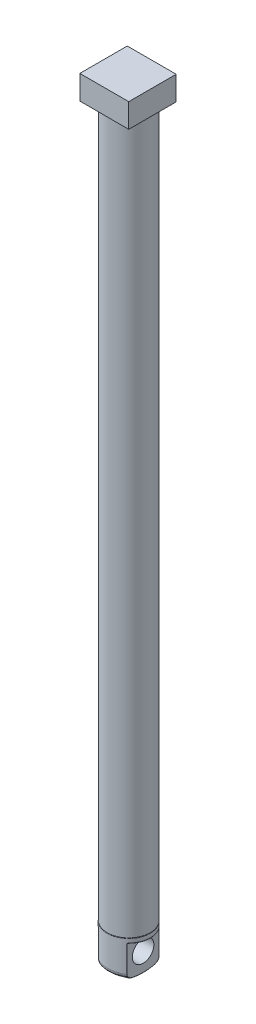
ISO-10303-21;
HEADER;
FILE_DESCRIPTION(('STEP AP214'),'2;1');
FILE_NAME('part.step','',(''),(''),'','','');
FILE_SCHEMA(('AUTOMOTIVE_DESIGN { 1 0 10303 214 1 1 1 1 }'));
ENDSEC;
DATA;
#1=APPLICATION_CONTEXT('core data for automotive mechanical design processes');
#2=APPLICATION_PROTOCOL_DEFINITION('international standard','automotive_design',2000,#1);
#3=PRODUCT_CONTEXT('',#1,'mechanical');
#4=PRODUCT('Part','Part','',(#3));
#5=PRODUCT_RELATED_PRODUCT_CATEGORY('part','',(#4));
#6=PRODUCT_DEFINITION_FORMATION('','',#4);
#7=PRODUCT_DEFINITION_CONTEXT('part definition',#1,'design');
#8=PRODUCT_DEFINITION('design','',#6,#7);
#9=PRODUCT_DEFINITION_SHAPE('','',#8);
#10=(LENGTH_UNIT() NAMED_UNIT(*) SI_UNIT(.MILLI.,.METRE.));
#11=(NAMED_UNIT(*) PLANE_ANGLE_UNIT() SI_UNIT($,.RADIAN.));
#12=(NAMED_UNIT(*) SI_UNIT($,.STERADIAN.) SOLID_ANGLE_UNIT());
#13=UNCERTAINTY_MEASURE_WITH_UNIT(LENGTH_MEASURE(1.E-05),#10,'distance_accuracy_value','');
#14=(GEOMETRIC_REPRESENTATION_CONTEXT(3) GLOBAL_UNCERTAINTY_ASSIGNED_CONTEXT((#13)) GLOBAL_UNIT_ASSIGNED_CONTEXT((#10,
#11,#12)) REPRESENTATION_CONTEXT('',''));
#15=CARTESIAN_POINT('',(0.,0.,0.));
#16=DIRECTION('',(0.,0.,1.));
#17=DIRECTION('',(1.,0.,0.));
#18=AXIS2_PLACEMENT_3D('',#15,#16,#17);
#19=CARTESIAN_POINT('',(10.00004004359,-1.99999999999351,-11.5));
#20=DIRECTION('',(0.,-1.,0.));
#21=DIRECTION('',(0.,0.,-1.));
#22=AXIS2_PLACEMENT_3D('',#19,#20,#21);
#23=PLANE('',#22);
#24=DIRECTION('',(-2.379553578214E-08,1.871466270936E-10,-1.));
#25=VECTOR('',#24,1.);
#26=CARTESIAN_POINT('',(6.90003865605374,-1.99999999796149,-8.37750313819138));
#27=LINE('',#26,#25);
#28=CARTESIAN_POINT('',(6.90003865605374,-1.99999999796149,-8.37750313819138));
#29=VERTEX_POINT('',#28);
#30=CARTESIAN_POINT('',(6.9000385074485,-1.99999999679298,-14.6224966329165));
#31=VERTEX_POINT('',#30);
#32=EDGE_CURVE('E796',#29,#31,#27,.T.);
#33=ORIENTED_EDGE('',*,*,#32,.F.);
#34=CARTESIAN_POINT('',(10.00004004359,-1.99999999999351,-11.5));
#35=DIRECTION('',(0.,-1.,0.));
#36=DIRECTION('',(-0.704546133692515,0.,0.709658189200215));
#37=AXIS2_PLACEMENT_3D('',#34,#35,#36);
#38=CIRCLE('',#37,4.40000000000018);
#39=EDGE_CURVE('E338',#29,#31,#38,.T.);
#40=ORIENTED_EDGE('',*,*,#39,.T.);
#41=EDGE_LOOP('',(#33,#40));
#42=FACE_BOUND('',#41,.T.);
#43=ADVANCED_FACE('F62',(#42),#23,.T.);
#44=CARTESIAN_POINT('',(10.00004004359,-1.99999999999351,-11.5));
#45=DIRECTION('',(0.,-1.,0.));
#46=DIRECTION('',(0.,0.,-1.));
#47=AXIS2_PLACEMENT_3D('',#44,#45,#46);
#48=PLANE('',#47);
#49=DIRECTION('',(2.379553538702E-08,1.871466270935E-10,1.));
#50=VECTOR('',#49,1.);
#51=CARTESIAN_POINT('',(13.1000414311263,-1.99999999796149,-14.6224968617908));
#52=LINE('',#51,#50);
#53=CARTESIAN_POINT('',(13.1000414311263,-1.99999999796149,-14.6224968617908));
#54=VERTEX_POINT('',#53);
#55=CARTESIAN_POINT('',(13.1000415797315,-1.99999999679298,-8.37750336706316));
#56=VERTEX_POINT('',#55);
#57=EDGE_CURVE('E12',#54,#56,#52,.T.);
#58=ORIENTED_EDGE('',*,*,#57,.F.);
#59=CARTESIAN_POINT('',(10.00004004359,-1.99999999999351,-11.5));
#60=DIRECTION('',(0.,-1.,0.));
#61=DIRECTION('',(0.704546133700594,0.,-0.709658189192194));
#62=AXIS2_PLACEMENT_3D('',#59,#60,#61);
#63=CIRCLE('',#62,4.40000000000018);
#64=EDGE_CURVE('E350',#54,#56,#63,.T.);
#65=ORIENTED_EDGE('',*,*,#64,.T.);
#66=EDGE_LOOP('',(#58,#65));
#67=FACE_BOUND('',#66,.T.);
#68=ADVANCED_FACE('F932',(#67),#48,.T.);
#69=CARTESIAN_POINT('',(13.1000400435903,-2.09999999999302,-14.8826396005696));
#70=DIRECTION('',(0.,0.,1.));
#71=DIRECTION('',(0.,1.,0.));
#72=AXIS2_PLACEMENT_3D('',#69,#70,#71);
#73=CYLINDRICAL_SURFACE('',#72,0.100000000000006);
#74=ORIENTED_EDGE('',*,*,#57,.T.);
#75=CARTESIAN_POINT('',(13.000040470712,-2.099987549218,-8.19092269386));
#76=CARTESIAN_POINT('',(13.0000399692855,-2.0959577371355,-8.19091903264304));
#77=CARTESIAN_POINT('',(13.0005274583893,-2.08762570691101,-8.19176969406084));
#78=CARTESIAN_POINT('',(13.0030259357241,-2.07448639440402,-8.19618532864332));
#79=CARTESIAN_POINT('',(13.0074742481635,-2.06131568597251,-8.2039855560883));
#80=CARTESIAN_POINT('',(13.0137298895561,-2.04886170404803,-8.21511883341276));
#81=CARTESIAN_POINT('',(13.0216466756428,-2.03739801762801,-8.2292524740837));
#82=CARTESIAN_POINT('',(13.0310853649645,-2.02712581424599,-8.24636102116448));
#83=CARTESIAN_POINT('',(13.04199926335,-2.01815425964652,-8.26632284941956));
#84=CARTESIAN_POINT('',(13.0543085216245,-2.01067002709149,-8.28922841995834));
#85=CARTESIAN_POINT('',(13.0680462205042,-2.004850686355,-8.31515757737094));
#86=CARTESIAN_POINT('',(13.0831821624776,-2.00099393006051,-8.34429041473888));
#87=CARTESIAN_POINT('',(13.0942844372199,-2.00000008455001,-8.3660640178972));
#88=CARTESIAN_POINT('',(13.1000415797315,-1.99999999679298,-8.37750336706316));
#89=(BOUNDED_CURVE() B_SPLINE_CURVE(3,(#75,#76,#77,#78,#79,#80,#81,#82,#83,#84,#85,#86,#87,#88),
.UNSPECIFIED.,.F.,.F.) B_SPLINE_CURVE_WITH_KNOTS((4,1,1,1,1,1,1,1,1,1,1,4),(0.,0.09090909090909,
0.1818181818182,0.2727272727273,0.3636363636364,0.4545454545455,0.5454545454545,0.6363636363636,
0.7272727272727,0.8181818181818,0.9090909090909,1.),
.UNSPECIFIED.) CURVE() GEOMETRIC_REPRESENTATION_ITEM() RATIONAL_B_SPLINE_CURVE((1.,1.,1.,1.,1.,
1.,1.,1.,1.,1.,1.,1.,1.,1.)) REPRESENTATION_ITEM(''));
#90=CARTESIAN_POINT('',(13.000040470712,-2.099987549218,-8.19092269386));
#91=VERTEX_POINT('',#90);
#92=EDGE_CURVE('E267',#91,#56,#89,.T.);
#93=ORIENTED_EDGE('',*,*,#92,.F.);
#94=DIRECTION('',(-8.43453237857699E-09,-4.417356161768E-08,1.));
#95=VECTOR('',#94,1.);
#96=CARTESIAN_POINT('',(13.0000405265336,-2.09998725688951,-14.8090772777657));
#97=LINE('',#96,#95);
#98=CARTESIAN_POINT('',(13.0000405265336,-2.09998725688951,-14.8090772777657));
#99=VERTEX_POINT('',#98);
#100=EDGE_CURVE('E76',#99,#91,#97,.T.);
#101=ORIENTED_EDGE('',*,*,#100,.F.);
#102=CARTESIAN_POINT('',(13.1000414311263,-1.99999999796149,-14.6224968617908));
#103=CARTESIAN_POINT('',(13.0942844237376,-2.00000007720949,-14.6339360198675));
#104=CARTESIAN_POINT('',(13.0831819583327,-2.000993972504,-14.6557096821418));
#105=CARTESIAN_POINT('',(13.0680464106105,-2.004850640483,-14.6848423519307));
#106=CARTESIAN_POINT('',(13.0543087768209,-2.01066989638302,-14.710770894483));
#107=CARTESIAN_POINT('',(13.041999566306,-2.01815405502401,-14.7336765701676));
#108=CARTESIAN_POINT('',(13.0310857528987,-2.02712544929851,-14.7536382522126));
#109=CARTESIAN_POINT('',(13.0216469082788,-2.037397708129,-14.7707471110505));
#110=CARTESIAN_POINT('',(13.0137300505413,-2.0488614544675,-14.7848805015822));
#111=CARTESIAN_POINT('',(13.0074744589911,-2.06131515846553,-14.7960148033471));
#112=CARTESIAN_POINT('',(13.0030260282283,-2.07448613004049,-14.8038135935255));
#113=CARTESIAN_POINT('',(13.0005275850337,-2.08762461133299,-14.8082311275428));
#114=CARTESIAN_POINT('',(13.0000400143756,-2.09595727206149,-14.809081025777));
#115=CARTESIAN_POINT('',(13.0000405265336,-2.09998725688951,-14.8090772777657));
#116=(BOUNDED_CURVE() B_SPLINE_CURVE(3,(#102,#103,#104,#105,#106,#107,#108,#109,#110,#111,#112,
#113,#114,#115),.UNSPECIFIED.,.F.,.F.) B_SPLINE_CURVE_WITH_KNOTS((4,1,1,1,1,1,1,1,1,1,1,4),(0.,
0.09090909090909,0.1818181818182,0.2727272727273,0.3636363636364,0.4545454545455,
0.5454545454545,0.6363636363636,0.7272727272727,0.8181818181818,0.9090909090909,1.),
.UNSPECIFIED.) CURVE() GEOMETRIC_REPRESENTATION_ITEM() RATIONAL_B_SPLINE_CURVE((1.,1.,1.,1.,1.,
1.,1.,1.,1.,1.,1.,1.,1.,1.)) REPRESENTATION_ITEM(''));
#117=EDGE_CURVE('E284',#54,#99,#116,.T.);
#118=ORIENTED_EDGE('',*,*,#117,.F.);
#119=EDGE_LOOP('',(#74,#93,#101,#118));
#120=FACE_BOUND('',#119,.T.);
#121=ADVANCED_FACE('F927',(#120),#73,.F.);
#122=CARTESIAN_POINT('',(13.0000400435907,-10.400000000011,-7.00000000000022));
#123=DIRECTION('',(-1.,0.,0.));
#124=DIRECTION('',(0.,0.,1.));
#125=AXIS2_PLACEMENT_3D('',#122,#123,#124);
#126=PLANE('',#125);
#127=CARTESIAN_POINT('',(13.0000400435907,-5.000000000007,-11.5));
#128=DIRECTION('',(1.,0.,0.));
#129=DIRECTION('',(0.,0.,-1.));
#130=AXIS2_PLACEMENT_3D('',#127,#128,#129);
#131=CIRCLE('',#130,2.24999999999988);
#132=CARTESIAN_POINT('',(13.0000400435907,-5.000000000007,-13.7499999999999));
#133=VERTEX_POINT('',#132);
#134=EDGE_CURVE('E1643',#133,#133,#131,.T.);
#135=ORIENTED_EDGE('',*,*,#134,.F.);
#136=EDGE_LOOP('',(#135));
#137=FACE_BOUND('',#136,.T.);
#138=ORIENTED_EDGE('',*,*,#100,.T.);
#139=DIRECTION('',(7.72062059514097E-08,1.,-2.18312307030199E-08));
#140=VECTOR('',#139,1.);
#141=CARTESIAN_POINT('',(13.0000400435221,-7.633078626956,-8.19092257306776));
#142=LINE('',#141,#140);
#143=CARTESIAN_POINT('',(13.0000400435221,-7.633078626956,-8.19092257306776));
#144=VERTEX_POINT('',#143);
#145=EDGE_CURVE('E105',#144,#91,#142,.T.);
#146=ORIENTED_EDGE('',*,*,#145,.F.);
#147=CARTESIAN_POINT('',(13.0000400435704,-8.679558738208,-9.35718775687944));
#148=CARTESIAN_POINT('',(13.0000400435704,-8.6632582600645,-9.27879569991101));
#149=CARTESIAN_POINT('',(13.0000400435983,-8.62515705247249,-9.1322070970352));
#150=CARTESIAN_POINT('',(13.0000400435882,-8.55575712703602,-8.94323758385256));
#151=CARTESIAN_POINT('',(13.0000400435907,-8.47680863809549,-8.78094252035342));
#152=CARTESIAN_POINT('',(13.0000400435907,-8.39026908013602,-8.64207827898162));
#153=CARTESIAN_POINT('',(13.0000400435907,-8.29854073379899,-8.52528920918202));
#154=CARTESIAN_POINT('',(13.0000400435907,-8.20352157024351,-8.4287296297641));
#155=CARTESIAN_POINT('',(13.0000400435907,-8.10658937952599,-8.35057865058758));
#156=CARTESIAN_POINT('',(13.0000400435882,-8.00927964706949,-8.28953266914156));
#157=CARTESIAN_POINT('',(13.0000400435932,-7.912496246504,-8.24399344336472));
#158=CARTESIAN_POINT('',(13.0000400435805,-7.81667454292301,-8.21266830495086));
#159=CARTESIAN_POINT('',(13.0000400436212,-7.723014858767,-8.19470255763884));
#160=CARTESIAN_POINT('',(13.0000400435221,-7.66273730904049,-8.19092906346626));
#161=CARTESIAN_POINT('',(13.0000400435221,-7.633078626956,-8.19092257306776));
#162=(BOUNDED_CURVE() B_SPLINE_CURVE(3,(#147,#148,#149,#150,#151,#152,#153,#154,#155,#156,#157,
#158,#159,#160,#161),.UNSPECIFIED.,.F.,.F.) B_SPLINE_CURVE_WITH_KNOTS((4,1,1,1,1,1,1,1,1,1,1,1,
4),(0.,0.08333333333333,0.1666666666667,0.25,0.3333333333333,0.4166666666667,0.5,
0.5833333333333,0.6666666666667,0.75,0.8333333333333,0.9166666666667,1.),
.UNSPECIFIED.) CURVE() GEOMETRIC_REPRESENTATION_ITEM() RATIONAL_B_SPLINE_CURVE((1.,1.,1.,1.,1.,
1.,1.,1.,1.,1.,1.,1.,1.,1.,1.)) REPRESENTATION_ITEM(''));
#163=CARTESIAN_POINT('',(13.0000400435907,-8.67956105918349,-9.35718727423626));
#164=VERTEX_POINT('',#163);
#165=EDGE_CURVE('E173',#164,#144,#162,.T.);
#166=ORIENTED_EDGE('',*,*,#165,.F.);
#167=CARTESIAN_POINT('',(13.0000400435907,1.62500000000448,-11.5));
#168=DIRECTION('',(-1.,0.,0.));
#169=DIRECTION('',(0.,-0.979055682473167,-0.203592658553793));
#170=AXIS2_PLACEMENT_3D('',#167,#168,#169);
#171=CIRCLE('',#170,10.5250000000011);
#172=CARTESIAN_POINT('',(13.0000400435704,-8.679558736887,-13.6428122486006));
#173=VERTEX_POINT('',#172);
#174=EDGE_CURVE('E134',#173,#164,#171,.T.);
#175=ORIENTED_EDGE('',*,*,#174,.F.);
#176=CARTESIAN_POINT('',(13.0000400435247,-7.633078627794,-14.809077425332));
#177=CARTESIAN_POINT('',(13.0000400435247,-7.66273752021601,-14.8090709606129));
#178=CARTESIAN_POINT('',(13.0000400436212,-7.72301558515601,-14.8052975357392));
#179=CARTESIAN_POINT('',(13.0000400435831,-7.816677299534,-14.787331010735));
#180=CARTESIAN_POINT('',(13.0000400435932,-7.91249937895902,-14.7560052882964));
#181=CARTESIAN_POINT('',(13.0000400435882,-8.00928237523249,-14.7104658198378));
#182=CARTESIAN_POINT('',(13.0000400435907,-8.10659228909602,-14.6494192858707));
#183=CARTESIAN_POINT('',(13.0000400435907,-8.20352435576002,-14.5712678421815));
#184=CARTESIAN_POINT('',(13.0000400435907,-8.2985429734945,-14.4747082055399));
#185=CARTESIAN_POINT('',(13.0000400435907,-8.39027126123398,-14.3579186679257));
#186=CARTESIAN_POINT('',(13.0000400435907,-8.47681055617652,-14.2190538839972));
#187=CARTESIAN_POINT('',(13.0000400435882,-8.55575895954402,-14.0567584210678));
#188=CARTESIAN_POINT('',(13.0000400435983,-8.62515869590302,-13.8677872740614));
#189=CARTESIAN_POINT('',(13.0000400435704,-8.66325879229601,-13.7212019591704));
#190=CARTESIAN_POINT('',(13.0000400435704,-8.679558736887,-13.6428122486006));
#191=(BOUNDED_CURVE() B_SPLINE_CURVE(3,(#176,#177,#178,#179,#180,#181,#182,#183,#184,#185,#186,
#187,#188,#189,#190),.UNSPECIFIED.,.F.,.F.) B_SPLINE_CURVE_WITH_KNOTS((4,1,1,1,1,1,1,1,1,1,1,1,
4),(0.,0.08333333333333,0.1666666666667,0.25,0.3333333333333,0.4166666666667,0.5,
0.5833333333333,0.6666666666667,0.75,0.8333333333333,0.9166666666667,1.),
.UNSPECIFIED.) CURVE() GEOMETRIC_REPRESENTATION_ITEM() RATIONAL_B_SPLINE_CURVE((1.,1.,1.,1.,1.,
1.,1.,1.,1.,1.,1.,1.,1.,1.,1.)) REPRESENTATION_ITEM(''));
#192=CARTESIAN_POINT('',(13.0000400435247,-7.633078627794,-14.809077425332));
#193=VERTEX_POINT('',#192);
#194=EDGE_CURVE('E655',#193,#173,#191,.T.);
#195=ORIENTED_EDGE('',*,*,#194,.F.);
#196=DIRECTION('',(-8.72945691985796E-08,-1.,-2.66698521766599E-08));
#197=VECTOR('',#196,1.);
#198=CARTESIAN_POINT('',(13.0000405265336,-2.09998725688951,-14.8090772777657));
#199=LINE('',#198,#197);
#200=EDGE_CURVE('E301',#99,#193,#199,.T.);
#201=ORIENTED_EDGE('',*,*,#200,.F.);
#202=EDGE_LOOP('',(#138,#146,#166,#175,#195,#201));
#203=FACE_BOUND('',#202,.T.);
#204=ADVANCED_FACE('F511',(#137,#203),#126,.F.);
#205=CARTESIAN_POINT('',(12.9000400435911,1.62500000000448,-11.5));
#206=DIRECTION('',(1.,0.,0.));
#207=DIRECTION('',(0.,-0.946533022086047,-0.322606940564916));
#208=AXIS2_PLACEMENT_3D('',#205,#206,#207);
#209=TOROIDAL_SURFACE('',#208,10.5250000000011,0.100000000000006);
#210=CARTESIAN_POINT('',(12.9000400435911,-8.6795610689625,-13.6428126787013));
#211=DIRECTION('',(0.,-0.203592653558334,0.979055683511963));
#212=DIRECTION('',(6.40809112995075E-07,-0.979055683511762,-0.203592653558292));
#213=AXIS2_PLACEMENT_3D('',#210,#211,#212);
#214=CIRCLE('',#213,0.100000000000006);
#215=CARTESIAN_POINT('',(12.9000402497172,-8.77746388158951,-13.6631739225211));
#216=VERTEX_POINT('',#215);
#217=EDGE_CURVE('E322',#216,#173,#214,.T.);
#218=ORIENTED_EDGE('',*,*,#217,.T.);
#219=ORIENTED_EDGE('',*,*,#174,.T.);
#220=CARTESIAN_POINT('',(12.9000400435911,-8.67955620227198,-9.3571881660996));
#221=DIRECTION('',(0.,0.203588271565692,0.979056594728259));
#222=DIRECTION('',(0.,-0.979056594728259,0.203588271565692));
#223=AXIS2_PLACEMENT_3D('',#220,#221,#222);
#224=CIRCLE('',#223,0.100000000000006);
#225=CARTESIAN_POINT('',(12.9000400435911,-8.777465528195,-9.33682272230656));
#226=VERTEX_POINT('',#225);
#227=EDGE_CURVE('E167',#226,#164,#224,.T.);
#228=ORIENTED_EDGE('',*,*,#227,.F.);
#229=CARTESIAN_POINT('',(12.9000400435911,1.62500000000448,-11.5));
#230=DIRECTION('',(-1.,0.,0.));
#231=DIRECTION('',(0.,-0.97905557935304,-0.203593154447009));
#232=AXIS2_PLACEMENT_3D('',#229,#230,#231);
#233=CIRCLE('',#232,10.6250000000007);
#234=EDGE_CURVE('E129',#216,#226,#233,.T.);
#235=ORIENTED_EDGE('',*,*,#234,.F.);
#236=EDGE_LOOP('',(#218,#219,#228,#235));
#237=FACE_BOUND('',#236,.T.);
#238=ADVANCED_FACE('F169',(#237),#209,.T.);
#239=CARTESIAN_POINT('',(5.50004004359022,1.62500000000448,-11.5));
#240=DIRECTION('',(1.,0.,0.));
#241=DIRECTION('',(0.,1.,0.));
#242=AXIS2_PLACEMENT_3D('',#239,#240,#241);
#243=CYLINDRICAL_SURFACE('',#242,10.6250000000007);
#244=CARTESIAN_POINT('',(7.10004036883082,-8.77746510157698,-9.33683167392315));
#245=CARTESIAN_POINT('',(7.159489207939,-8.75726975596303,-9.23971554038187));
#246=CARTESIAN_POINT('',(7.285482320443,-8.715577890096,-9.05278206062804));
#247=CARTESIAN_POINT('',(7.49666727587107,-8.65027558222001,-8.79234428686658));
#248=CARTESIAN_POINT('',(7.72606668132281,-8.58493347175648,-8.55621851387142));
#249=CARTESIAN_POINT('',(7.97045162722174,-8.52183673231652,-8.34620886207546));
#250=CARTESIAN_POINT('',(8.22630224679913,-8.4631261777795,-8.1637147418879));
#251=CARTESIAN_POINT('',(8.49044694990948,-8.4105242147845,-8.00912127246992));
#252=CARTESIAN_POINT('',(8.76017490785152,-8.36533388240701,-7.88217543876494));
#253=CARTESIAN_POINT('',(9.03341600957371,-8.328460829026,-7.78219627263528));
#254=CARTESIAN_POINT('',(9.30862113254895,-8.30045832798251,-7.70825986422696));
#255=CARTESIAN_POINT('',(9.58487541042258,-8.28166746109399,-7.65955293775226));
#256=CARTESIAN_POINT('',(9.86158150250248,-8.27223075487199,-7.63535679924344));
#257=CARTESIAN_POINT('',(10.1384162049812,-8.272231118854,-7.63535775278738));
#258=CARTESIAN_POINT('',(10.4151260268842,-8.28166205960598,-7.65953902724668));
#259=CARTESIAN_POINT('',(10.6913845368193,-8.30045281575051,-7.70824545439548));
#260=CARTESIAN_POINT('',(10.9665919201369,-8.32845224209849,-7.7821733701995));
#261=CARTESIAN_POINT('',(11.2398370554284,-8.365322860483,-7.8821450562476));
#262=CARTESIAN_POINT('',(11.509562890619,-8.41051214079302,-8.00908666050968));
#263=CARTESIAN_POINT('',(11.7737133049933,-8.46311174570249,-8.16367125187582));
#264=CARTESIAN_POINT('',(12.0295613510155,-8.521820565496,-8.34615709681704));
#265=CARTESIAN_POINT('',(12.2739455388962,-8.5849150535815,-8.55615484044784));
#266=CARTESIAN_POINT('',(12.5033550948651,-8.65025850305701,-8.79227936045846));
#267=CARTESIAN_POINT('',(12.7145536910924,-8.71556364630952,-9.05272166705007));
#268=CARTESIAN_POINT('',(12.8405800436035,-8.75726467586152,-9.23968945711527));
#269=CARTESIAN_POINT('',(12.9000402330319,-8.77746387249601,-9.33682610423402));
#270=(BOUNDED_CURVE() B_SPLINE_CURVE(3,(#244,#245,#246,#247,#248,#249,#250,#251,#252,#253,#254,
#255,#256,#257,#258,#259,#260,#261,#262,#263,#264,#265,#266,#267,#268,#269),.UNSPECIFIED.,.F.,
.F.) B_SPLINE_CURVE_WITH_KNOTS((4,1,1,1,1,1,1,1,1,1,1,1,1,1,1,1,1,1,1,1,1,1,1,4),(0.,
0.04347826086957,0.08695652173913,0.1304347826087,0.1739130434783,0.2173913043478,
0.2608695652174,0.304347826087,0.3478260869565,0.3913043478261,0.4347826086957,0.4782608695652,
0.5217391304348,0.5652173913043,0.6086956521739,0.6521739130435,0.695652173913,0.7391304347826,
0.7826086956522,0.8260869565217,0.8695652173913,0.9130434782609,0.9565217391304,1.),
.UNSPECIFIED.) CURVE() GEOMETRIC_REPRESENTATION_ITEM() RATIONAL_B_SPLINE_CURVE((1.,1.,1.,1.,1.,
1.,1.,1.,1.,1.,1.,1.,1.,1.,1.,1.,1.,1.,1.,1.,1.,1.,1.,1.,1.,1.)) REPRESENTATION_ITEM(''));
#271=CARTESIAN_POINT('',(7.10004036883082,-8.77746510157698,-9.33683167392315));
#272=VERTEX_POINT('',#271);
#273=EDGE_CURVE('E159',#272,#226,#270,.T.);
#274=ORIENTED_EDGE('',*,*,#273,.F.);
#275=CARTESIAN_POINT('',(7.1000400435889,1.62500000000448,-11.5));
#276=DIRECTION('',(1.,0.,0.));
#277=DIRECTION('',(0.,-0.979055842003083,0.203591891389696));
#278=AXIS2_PLACEMENT_3D('',#275,#276,#277);
#279=CIRCLE('',#278,10.6250000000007);
#280=CARTESIAN_POINT('',(7.1000400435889,-8.77746832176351,-13.6631638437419));
#281=VERTEX_POINT('',#280);
#282=EDGE_CURVE('E119',#272,#281,#279,.T.);
#283=ORIENTED_EDGE('',*,*,#282,.T.);
#284=CARTESIAN_POINT('',(12.9000402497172,-8.77746388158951,-13.6631739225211));
#285=CARTESIAN_POINT('',(12.8405800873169,-8.75726469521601,-13.7603105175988));
#286=CARTESIAN_POINT('',(12.7145537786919,-8.71556367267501,-13.9472781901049));
#287=CARTESIAN_POINT('',(12.5033552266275,-8.650258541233,-14.2077205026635));
#288=CARTESIAN_POINT('',(12.2739456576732,-8.58491508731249,-14.4438450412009));
#289=CARTESIAN_POINT('',(12.0295614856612,-8.521820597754,-14.6538428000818));
#290=CARTESIAN_POINT('',(11.7737134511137,-8.463111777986,-14.8363286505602));
#291=CARTESIAN_POINT('',(11.5095630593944,-8.41051217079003,-14.9909132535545));
#292=CARTESIAN_POINT('',(11.2398372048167,-8.3653228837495,-15.1178548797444));
#293=CARTESIAN_POINT('',(10.9665920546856,-8.32845225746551,-15.2178265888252));
#294=CARTESIAN_POINT('',(10.6913846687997,-8.30045282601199,-15.2917545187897));
#295=CARTESIAN_POINT('',(10.4151261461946,-8.28166206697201,-15.3404609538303));
#296=CARTESIAN_POINT('',(10.1384163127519,-8.27223111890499,-15.3646422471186));
#297=CARTESIAN_POINT('',(9.86158160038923,-8.2722307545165,-15.3646432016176));
#298=CARTESIAN_POINT('',(9.58487549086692,-8.2816674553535,-15.3404470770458));
#299=CARTESIAN_POINT('',(9.30862118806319,-8.30045832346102,-15.2917401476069));
#300=CARTESIAN_POINT('',(9.03341603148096,-8.32846082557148,-15.2178037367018));
#301=CARTESIAN_POINT('',(8.76017489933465,-8.3653338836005,-15.1178245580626));
#302=CARTESIAN_POINT('',(8.49044690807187,-8.41052422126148,-14.9908787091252));
#303=CARTESIAN_POINT('',(8.22630218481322,-8.463126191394,-14.8362852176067));
#304=CARTESIAN_POINT('',(7.97045154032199,-8.52183675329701,-14.6537910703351));
#305=CARTESIAN_POINT('',(7.72606661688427,-8.58493348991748,-14.4437814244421));
#306=CARTESIAN_POINT('',(7.49666723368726,-8.65027559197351,-14.2076556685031));
#307=CARTESIAN_POINT('',(7.28548232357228,-8.71557790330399,-13.9472179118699));
#308=CARTESIAN_POINT('',(7.15948917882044,-8.75726973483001,-13.7602844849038));
#309=CARTESIAN_POINT('',(7.10004034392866,-8.77746507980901,-13.6631683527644));
#310=(BOUNDED_CURVE() B_SPLINE_CURVE(3,(#284,#285,#286,#287,#288,#289,#290,#291,#292,#293,#294,
#295,#296,#297,#298,#299,#300,#301,#302,#303,#304,#305,#306,#307,#308,#309),.UNSPECIFIED.,.F.,
.F.) B_SPLINE_CURVE_WITH_KNOTS((4,1,1,1,1,1,1,1,1,1,1,1,1,1,1,1,1,1,1,1,1,1,1,4),(0.,
0.04347826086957,0.08695652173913,0.1304347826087,0.1739130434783,0.2173913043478,
0.2608695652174,0.304347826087,0.3478260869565,0.3913043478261,0.4347826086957,0.4782608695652,
0.5217391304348,0.5652173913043,0.6086956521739,0.6521739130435,0.695652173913,0.7391304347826,
0.7826086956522,0.8260869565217,0.8695652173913,0.9130434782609,0.9565217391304,1.),
.UNSPECIFIED.) CURVE() GEOMETRIC_REPRESENTATION_ITEM() RATIONAL_B_SPLINE_CURVE((1.,1.,1.,1.,1.,
1.,1.,1.,1.,1.,1.,1.,1.,1.,1.,1.,1.,1.,1.,1.,1.,1.,1.,1.,1.,1.)) REPRESENTATION_ITEM(''));
#311=EDGE_CURVE('E162',#216,#281,#310,.T.);
#312=ORIENTED_EDGE('',*,*,#311,.F.);
#313=ORIENTED_EDGE('',*,*,#234,.T.);
#314=EDGE_LOOP('',(#274,#283,#312,#313));
#315=FACE_BOUND('',#314,.T.);
#316=ADVANCED_FACE('F157',(#315),#243,.T.);
#317=CARTESIAN_POINT('',(7.1000400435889,1.62500000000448,-11.5));
#318=DIRECTION('',(1.,0.,0.));
#319=DIRECTION('',(0.,-0.946533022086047,0.322606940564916));
#320=AXIS2_PLACEMENT_3D('',#317,#318,#319);
#321=TOROIDAL_SURFACE('',#320,10.5250000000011,0.100000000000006);
#322=CARTESIAN_POINT('',(7.1000400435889,-8.67956085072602,-9.3571862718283));
#323=DIRECTION('',(0.,-0.203592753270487,-0.979055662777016));
#324=DIRECTION('',(9.12595917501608E-07,-0.979055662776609,0.203592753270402));
#325=AXIS2_PLACEMENT_3D('',#322,#323,#324);
#326=CIRCLE('',#325,0.100000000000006);
#327=CARTESIAN_POINT('',(7.00004004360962,-8.67955860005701,-9.35718681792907));
#328=VERTEX_POINT('',#327);
#329=EDGE_CURVE('E198',#272,#328,#326,.T.);
#330=ORIENTED_EDGE('',*,*,#329,.T.);
#331=CARTESIAN_POINT('',(7.0000400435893,1.62500000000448,-11.5));
#332=DIRECTION('',(1.,0.,0.));
#333=DIRECTION('',(0.,-0.979055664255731,0.203592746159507));
#334=AXIS2_PLACEMENT_3D('',#331,#332,#333);
#335=CIRCLE('',#334,10.5250000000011);
#336=CARTESIAN_POINT('',(7.0000400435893,-8.67956086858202,-13.642813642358));
#337=VERTEX_POINT('',#336);
#338=EDGE_CURVE('E676',#328,#337,#335,.T.);
#339=ORIENTED_EDGE('',*,*,#338,.T.);
#340=CARTESIAN_POINT('',(7.1000400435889,-8.67955613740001,-13.6428126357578));
#341=DIRECTION('',(0.,0.203596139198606,-0.979054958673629));
#342=DIRECTION('',(0.,-0.979054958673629,-0.203596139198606));
#343=AXIS2_PLACEMENT_3D('',#340,#341,#342);
#344=CIRCLE('',#343,0.100000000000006);
#345=EDGE_CURVE('E234',#281,#337,#344,.T.);
#346=ORIENTED_EDGE('',*,*,#345,.F.);
#347=ORIENTED_EDGE('',*,*,#282,.F.);
#348=EDGE_LOOP('',(#330,#339,#346,#347));
#349=FACE_BOUND('',#348,.T.);
#350=ADVANCED_FACE('F1204',(#349),#321,.T.);
#351=CARTESIAN_POINT('',(7.0000400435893,-10.400000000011,-15.9999999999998));
#352=DIRECTION('',(1.,0.,0.));
#353=DIRECTION('',(0.,1.,0.));
#354=AXIS2_PLACEMENT_3D('',#351,#352,#353);
#355=PLANE('',#354);
#356=CARTESIAN_POINT('',(7.0000400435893,-5.000000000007,-11.5));
#357=DIRECTION('',(1.,0.,0.));
#358=DIRECTION('',(0.,0.,-1.));
#359=AXIS2_PLACEMENT_3D('',#356,#357,#358);
#360=CIRCLE('',#359,2.24999999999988);
#361=CARTESIAN_POINT('',(7.0000400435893,-5.000000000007,-13.7499999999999));
#362=VERTEX_POINT('',#361);
#363=EDGE_CURVE('E69',#362,#362,#360,.T.);
#364=ORIENTED_EDGE('',*,*,#363,.T.);
#365=EDGE_LOOP('',(#364));
#366=FACE_BOUND('',#365,.T.);
#367=DIRECTION('',(8.43453227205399E-09,-4.417356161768E-08,-1.));
#368=VECTOR('',#367,1.);
#369=CARTESIAN_POINT('',(7.0000395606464,-2.09998725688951,-8.19092272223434));
#370=LINE('',#369,#368);
#371=CARTESIAN_POINT('',(7.0000395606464,-2.09998725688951,-8.19092272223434));
#372=VERTEX_POINT('',#371);
#373=CARTESIAN_POINT('',(7.00003961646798,-2.099987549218,-14.80907730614));
#374=VERTEX_POINT('',#373);
#375=EDGE_CURVE('E85',#372,#374,#370,.T.);
#376=ORIENTED_EDGE('',*,*,#375,.T.);
#377=DIRECTION('',(-7.72060859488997E-08,1.,2.65063840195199E-08));
#378=VECTOR('',#377,1.);
#379=CARTESIAN_POINT('',(7.00004004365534,-7.63307912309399,-14.8090774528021));
#380=LINE('',#379,#378);
#381=CARTESIAN_POINT('',(7.00004004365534,-7.63307912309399,-14.8090774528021));
#382=VERTEX_POINT('',#381);
#383=EDGE_CURVE('E634',#382,#374,#380,.T.);
#384=ORIENTED_EDGE('',*,*,#383,.F.);
#385=CARTESIAN_POINT('',(7.00004004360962,-8.6795586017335,-13.6428131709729));
#386=CARTESIAN_POINT('',(7.00004004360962,-8.66325688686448,-13.721208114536));
#387=CARTESIAN_POINT('',(7.00004004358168,-8.62515313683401,-13.8678004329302));
#388=CARTESIAN_POINT('',(7.00004004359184,-8.55575390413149,-14.0567688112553));
#389=CARTESIAN_POINT('',(7.0000400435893,-8.476807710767,-14.2190601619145));
#390=CARTESIAN_POINT('',(7.0000400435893,-8.39026994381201,-14.3579207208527));
#391=CARTESIAN_POINT('',(7.0000400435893,-8.29854107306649,-14.4747107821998));
#392=CARTESIAN_POINT('',(7.0000400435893,-8.20352003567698,-14.5712722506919));
#393=CARTESIAN_POINT('',(7.0000400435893,-8.10658866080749,-14.6494224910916));
#394=CARTESIAN_POINT('',(7.00004004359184,-8.0092799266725,-14.7104678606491));
#395=CARTESIAN_POINT('',(7.00004004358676,-7.9124970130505,-14.7560067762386));
#396=CARTESIAN_POINT('',(7.00004004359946,-7.81667540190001,-14.7873318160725));
#397=CARTESIAN_POINT('',(7.00004004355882,-7.723015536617,-14.8052975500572));
#398=CARTESIAN_POINT('',(7.00004004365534,-7.66273787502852,-14.8090709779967));
#399=CARTESIAN_POINT('',(7.00004004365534,-7.63307912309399,-14.8090774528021));
#400=(BOUNDED_CURVE() B_SPLINE_CURVE(3,(#385,#386,#387,#388,#389,#390,#391,#392,#393,#394,#395,
#396,#397,#398,#399),.UNSPECIFIED.,.F.,.F.) B_SPLINE_CURVE_WITH_KNOTS((4,1,1,1,1,1,1,1,1,1,1,1,
4),(0.,0.08333333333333,0.1666666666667,0.25,0.3333333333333,0.4166666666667,0.5,
0.5833333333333,0.6666666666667,0.75,0.8333333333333,0.9166666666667,1.),
.UNSPECIFIED.) CURVE() GEOMETRIC_REPRESENTATION_ITEM() RATIONAL_B_SPLINE_CURVE((1.,1.,1.,1.,1.,
1.,1.,1.,1.,1.,1.,1.,1.,1.,1.)) REPRESENTATION_ITEM(''));
#401=EDGE_CURVE('E398',#337,#382,#400,.T.);
#402=ORIENTED_EDGE('',*,*,#401,.F.);
#403=ORIENTED_EDGE('',*,*,#338,.F.);
#404=CARTESIAN_POINT('',(7.00004004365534,-7.63307912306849,-8.19092254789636));
#405=CARTESIAN_POINT('',(7.00004004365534,-7.662738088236,-8.19092899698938));
#406=CARTESIAN_POINT('',(7.00004004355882,-7.72301627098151,-8.19470235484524));
#407=CARTESIAN_POINT('',(7.00004004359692,-7.816678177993,-8.2126688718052));
#408=CARTESIAN_POINT('',(7.00004004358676,-7.91250017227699,-8.24399450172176));
#409=CARTESIAN_POINT('',(7.00004004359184,-8.00928268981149,-8.28953366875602));
#410=CARTESIAN_POINT('',(7.0000400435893,-8.106591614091,-8.35057960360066));
#411=CARTESIAN_POINT('',(7.0000400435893,-8.2035228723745,-8.42873032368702));
#412=CARTESIAN_POINT('',(7.0000400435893,-8.29854336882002,-8.52529186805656));
#413=CARTESIAN_POINT('',(7.0000400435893,-8.3902721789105,-8.64208241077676));
#414=CARTESIAN_POINT('',(7.0000400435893,-8.476809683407,-8.78094353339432));
#415=CARTESIAN_POINT('',(7.00004004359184,-8.555755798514,-8.94323533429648));
#416=CARTESIAN_POINT('',(7.00004004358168,-8.62515483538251,-9.13220536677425));
#417=CARTESIAN_POINT('',(7.00004004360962,-8.6632574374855,-9.27879429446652));
#418=CARTESIAN_POINT('',(7.00004004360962,-8.67955860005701,-9.35718681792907));
#419=(BOUNDED_CURVE() B_SPLINE_CURVE(3,(#404,#405,#406,#407,#408,#409,#410,#411,#412,#413,#414,
#415,#416,#417,#418),.UNSPECIFIED.,.F.,.F.) B_SPLINE_CURVE_WITH_KNOTS((4,1,1,1,1,1,1,1,1,1,1,1,
4),(0.,0.08333333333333,0.1666666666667,0.25,0.3333333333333,0.4166666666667,0.5,
0.5833333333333,0.6666666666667,0.75,0.8333333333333,0.9166666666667,1.),
.UNSPECIFIED.) CURVE() GEOMETRIC_REPRESENTATION_ITEM() RATIONAL_B_SPLINE_CURVE((1.,1.,1.,1.,1.,
1.,1.,1.,1.,1.,1.,1.,1.,1.,1.)) REPRESENTATION_ITEM(''));
#420=CARTESIAN_POINT('',(7.00004004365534,-7.63307912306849,-8.19092254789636));
#421=VERTEX_POINT('',#420);
#422=EDGE_CURVE('E678',#421,#328,#419,.T.);
#423=ORIENTED_EDGE('',*,*,#422,.F.);
#424=DIRECTION('',(8.72944448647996E-08,-1.,3.15079711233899E-08));
#425=VECTOR('',#424,1.);
#426=CARTESIAN_POINT('',(7.0000395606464,-2.09998725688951,-8.19092272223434));
#427=LINE('',#426,#425);
#428=EDGE_CURVE('E821',#372,#421,#427,.T.);
#429=ORIENTED_EDGE('',*,*,#428,.F.);
#430=EDGE_LOOP('',(#376,#384,#402,#403,#423,#429));
#431=FACE_BOUND('',#430,.T.);
#432=ADVANCED_FACE('F1210',(#366,#431),#355,.F.);
#433=CARTESIAN_POINT('',(6.9000400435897,-2.09999999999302,-8.1162862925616));
#434=DIRECTION('',(0.,0.,-1.));
#435=DIRECTION('',(0.,1.,0.));
#436=AXIS2_PLACEMENT_3D('',#433,#434,#435);
#437=CYLINDRICAL_SURFACE('',#436,0.100000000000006);
#438=ORIENTED_EDGE('',*,*,#32,.T.);
#439=CARTESIAN_POINT('',(7.00003961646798,-2.099987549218,-14.80907730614));
#440=CARTESIAN_POINT('',(7.00004011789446,-2.0959577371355,-14.809080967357));
#441=CARTESIAN_POINT('',(6.9995526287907,-2.08762570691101,-14.8082303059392));
#442=CARTESIAN_POINT('',(6.99705415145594,-2.07448639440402,-14.8038146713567));
#443=CARTESIAN_POINT('',(6.99260583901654,-2.06131568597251,-14.7960144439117));
#444=CARTESIAN_POINT('',(6.98635019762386,-2.04886170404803,-14.7848811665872));
#445=CARTESIAN_POINT('',(6.97843341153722,-2.03739801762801,-14.7707475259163));
#446=CARTESIAN_POINT('',(6.9689947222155,-2.02712581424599,-14.7536389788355));
#447=CARTESIAN_POINT('',(6.95808082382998,-2.01815425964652,-14.7336771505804));
#448=CARTESIAN_POINT('',(6.94577156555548,-2.01067002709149,-14.7107715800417));
#449=CARTESIAN_POINT('',(6.93203386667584,-2.004850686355,-14.6848424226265));
#450=CARTESIAN_POINT('',(6.91689792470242,-2.00099393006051,-14.6557095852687));
#451=CARTESIAN_POINT('',(6.9057956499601,-2.00000008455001,-14.6339359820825));
#452=CARTESIAN_POINT('',(6.9000385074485,-1.99999999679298,-14.6224966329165));
#453=(BOUNDED_CURVE() B_SPLINE_CURVE(3,(#439,#440,#441,#442,#443,#444,#445,#446,#447,#448,#449,
#450,#451,#452),.UNSPECIFIED.,.F.,.F.) B_SPLINE_CURVE_WITH_KNOTS((4,1,1,1,1,1,1,1,1,1,1,4),(0.,
0.09090909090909,0.1818181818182,0.2727272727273,0.3636363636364,0.4545454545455,
0.5454545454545,0.6363636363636,0.7272727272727,0.8181818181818,0.9090909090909,1.),
.UNSPECIFIED.) CURVE() GEOMETRIC_REPRESENTATION_ITEM() RATIONAL_B_SPLINE_CURVE((1.,1.,1.,1.,1.,
1.,1.,1.,1.,1.,1.,1.,1.,1.)) REPRESENTATION_ITEM(''));
#454=EDGE_CURVE('E787',#374,#31,#453,.T.);
#455=ORIENTED_EDGE('',*,*,#454,.F.);
#456=ORIENTED_EDGE('',*,*,#375,.F.);
#457=CARTESIAN_POINT('',(6.90003865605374,-1.99999999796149,-8.37750313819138));
#458=CARTESIAN_POINT('',(6.90579566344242,-2.00000007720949,-8.3660639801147));
#459=CARTESIAN_POINT('',(6.9168981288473,-2.000993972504,-8.34429031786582));
#460=CARTESIAN_POINT('',(6.93203367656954,-2.004850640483,-8.31515764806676));
#461=CARTESIAN_POINT('',(6.94577131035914,-2.01066989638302,-8.28922910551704));
#462=CARTESIAN_POINT('',(6.95808052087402,-2.01815405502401,-8.26632342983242));
#463=CARTESIAN_POINT('',(6.9689943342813,-2.02712544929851,-8.24636174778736));
#464=CARTESIAN_POINT('',(6.97843317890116,-2.037397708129,-8.22925288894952));
#465=CARTESIAN_POINT('',(6.98635003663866,-2.0488614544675,-8.21511949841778));
#466=CARTESIAN_POINT('',(6.99260562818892,-2.06131515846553,-8.2039851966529));
#467=CARTESIAN_POINT('',(6.99705405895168,-2.07448613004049,-8.19618640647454));
#468=CARTESIAN_POINT('',(6.9995525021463,-2.08762461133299,-8.1917688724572));
#469=CARTESIAN_POINT('',(7.00004007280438,-2.09595727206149,-8.19091897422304));
#470=CARTESIAN_POINT('',(7.0000395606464,-2.09998725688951,-8.19092272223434));
#471=(BOUNDED_CURVE() B_SPLINE_CURVE(3,(#457,#458,#459,#460,#461,#462,#463,#464,#465,#466,#467,
#468,#469,#470),.UNSPECIFIED.,.F.,.F.) B_SPLINE_CURVE_WITH_KNOTS((4,1,1,1,1,1,1,1,1,1,1,4),(0.,
0.09090909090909,0.1818181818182,0.2727272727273,0.3636363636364,0.4545454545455,
0.5454545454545,0.6363636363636,0.7272727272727,0.8181818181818,0.9090909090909,1.),
.UNSPECIFIED.) CURVE() GEOMETRIC_REPRESENTATION_ITEM() RATIONAL_B_SPLINE_CURVE((1.,1.,1.,1.,1.,
1.,1.,1.,1.,1.,1.,1.,1.,1.)) REPRESENTATION_ITEM(''));
#472=EDGE_CURVE('E443',#29,#372,#471,.T.);
#473=ORIENTED_EDGE('',*,*,#472,.F.);
#474=EDGE_LOOP('',(#438,#455,#456,#473));
#475=FACE_BOUND('',#474,.T.);
#476=ADVANCED_FACE('F1207',(#475),#437,.F.);
#477=CARTESIAN_POINT('',(7.12118788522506,-2.11653097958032,-14.9062995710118));
#478=CARTESIAN_POINT('',(7.1219234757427,-2.10587913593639,-14.9067713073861));
#479=CARTESIAN_POINT('',(7.12203354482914,-2.07111310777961,-14.9068805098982));
#480=CARTESIAN_POINT('',(7.10872348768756,-2.01135933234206,-14.8983819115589));
#481=CARTESIAN_POINT('',(7.07242908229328,-1.94927880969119,-14.8748971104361));
#482=CARTESIAN_POINT('',(7.02138604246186,-1.90316686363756,-14.8405958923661));
#483=CARTESIAN_POINT('',(6.96143448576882,-1.87509533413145,-14.7979274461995));
#484=CARTESIAN_POINT('',(6.89665048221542,-1.86543652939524,-14.7481609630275));
#485=CARTESIAN_POINT('',(6.84883478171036,-1.8722931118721,-14.7077370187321));
#486=CARTESIAN_POINT('',(6.82292812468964,-1.88090360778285,-14.6842583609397));
#487=CARTESIAN_POINT('',(6.81730987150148,-1.88302557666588,-14.6790835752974));
#488=CARTESIAN_POINT('',(7.04179229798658,-2.11308357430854,-14.9239632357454));
#489=CARTESIAN_POINT('',(7.0424365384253,-2.10465735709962,-14.9244608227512));
#490=CARTESIAN_POINT('',(7.0425317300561,-2.07710341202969,-14.9245808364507));
#491=CARTESIAN_POINT('',(7.03085040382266,-2.03006331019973,-14.9156141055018));
#492=CARTESIAN_POINT('',(6.99973061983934,-1.9836465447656,-14.8910172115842));
#493=CARTESIAN_POINT('',(6.95769340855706,-1.95277687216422,-14.855460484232));
#494=CARTESIAN_POINT('',(6.91073778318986,-1.93828829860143,-14.8116869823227));
#495=CARTESIAN_POINT('',(6.86291669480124,-1.93937382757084,-14.7610967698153));
#496=CARTESIAN_POINT('',(6.83013127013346,-1.95096916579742,-14.7203363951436));
#497=CARTESIAN_POINT('',(6.81338595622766,-1.96080678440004,-14.6967832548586));
#498=CARTESIAN_POINT('',(6.80980892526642,-1.96312203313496,-14.6915982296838));
#499=CARTESIAN_POINT('',(6.98446024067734,-2.10727584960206,-14.8664677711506));
#500=CARTESIAN_POINT('',(6.98480808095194,-2.10258926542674,-14.8668812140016));
#501=CARTESIAN_POINT('',(6.98485966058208,-2.08727276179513,-14.8669660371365));
#502=CARTESIAN_POINT('',(6.97855631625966,-2.06107107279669,-14.8595230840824));
#503=CARTESIAN_POINT('',(6.96165270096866,-2.03480189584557,-14.8385460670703));
#504=CARTESIAN_POINT('',(6.93855090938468,-2.01668985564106,-14.8070760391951));
#505=CARTESIAN_POINT('',(6.91235570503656,-2.00733412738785,-14.7668995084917));
#506=CARTESIAN_POINT('',(6.8851820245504,-2.00647102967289,-14.7189905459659));
#507=CARTESIAN_POINT('',(6.86609993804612,-2.01188284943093,-14.6793252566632));
#508=CARTESIAN_POINT('',(6.85615626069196,-2.01684573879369,-14.6560145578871));
#509=CARTESIAN_POINT('',(6.85402095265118,-2.01802643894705,-14.6508628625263));
#510=CARTESIAN_POINT('',(7.00233457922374,-2.10449116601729,-14.7871075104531));
#511=CARTESIAN_POINT('',(7.00245571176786,-2.10159183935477,-14.7874048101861));
#512=CARTESIAN_POINT('',(7.0024753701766,-2.09219487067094,-14.787441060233));
#513=CARTESIAN_POINT('',(7.00031424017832,-2.07564056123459,-14.7821013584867));
#514=CARTESIAN_POINT('',(6.99349093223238,-2.0553273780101,-14.766120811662));
#515=CARTESIAN_POINT('',(6.98170232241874,-2.03566288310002,-14.7402916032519));
#516=CARTESIAN_POINT('',(6.9647885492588,-2.01823209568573,-14.7050799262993));
#517=CARTESIAN_POINT('',(6.94280804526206,-2.00453365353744,-14.6608718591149));
#518=CARTESIAN_POINT('',(6.9234003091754,-1.99857137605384,-14.6227181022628));
#519=CARTESIAN_POINT('',(6.91159391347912,-1.99707622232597,-14.5997420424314));
#520=CARTESIAN_POINT('',(6.9089644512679,-1.99684619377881,-14.5946363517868));
#521=(BOUNDED_SURFACE() B_SPLINE_SURFACE(3,3,((#477,#478,#479,#480,#481,#482,#483,#484,#485,
#486,#487),(#488,#489,#490,#491,#492,#493,#494,#495,#496,#497,#498),(#499,#500,#501,#502,#503,
#504,#505,#506,#507,#508,#509),(#510,#511,#512,#513,#514,#515,#516,#517,#518,#519,#520)),
.UNSPECIFIED.,.F.,.F.,.F.) B_SPLINE_SURFACE_WITH_KNOTS((4,4),(4,1,1,1,1,1,1,1,4),(0.,1.),
(0.1302688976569,0.1669311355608,0.2488317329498,0.3406516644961,0.4434993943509,
0.5589206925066,0.6887054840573,0.8348214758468,0.8764290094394),
.UNSPECIFIED.) GEOMETRIC_REPRESENTATION_ITEM() RATIONAL_B_SPLINE_SURFACE(((1.301630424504,
1.301630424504,1.301630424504,1.301630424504,1.301630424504,1.301630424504,1.301630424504,
1.301630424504,1.301630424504,1.301630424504,1.301630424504),(0.8994565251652,0.8994565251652,
0.8994565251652,0.8994565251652,0.8994565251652,0.8994565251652,0.8994565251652,0.8994565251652,
0.8994565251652,0.8994565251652,0.8994565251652),(0.8994565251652,0.8994565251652,
0.8994565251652,0.8994565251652,0.8994565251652,0.8994565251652,0.8994565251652,0.8994565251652,
0.8994565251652,0.8994565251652,0.8994565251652),(1.301630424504,1.301630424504,1.301630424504,
1.301630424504,1.301630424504,1.301630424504,1.301630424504,1.301630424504,1.301630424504,
1.301630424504,1.301630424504))) REPRESENTATION_ITEM('') SURFACE());
#522=CARTESIAN_POINT('',(7.10003663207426,-2.1000013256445,-14.8090757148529));
#523=DIRECTION('',(-3.89007844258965E-05,0.999999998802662,2.96884685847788E-05));
#524=DIRECTION('',(-0.659058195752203,-3.30942270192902E-06,-0.752091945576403));
#525=AXIS2_PLACEMENT_3D('',#522,#523,#524);
#526=CIRCLE('',#525,0.099998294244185);
#527=CARTESIAN_POINT('',(7.03413241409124,-2.09999999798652,-14.884283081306));
#528=VERTEX_POINT('',#527);
#529=EDGE_CURVE('E632',#528,#374,#526,.T.);
#530=CARTESIAN_POINT('',(6.90004004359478,-1.89999999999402,-14.6224989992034));
#531=DIRECTION('',(-0.709658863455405,0.,0.704545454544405));
#532=DIRECTION('',(-0.704545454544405,0.,-0.709658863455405));
#533=AXIS2_PLACEMENT_3D('',#530,#531,#532);
#534=CIRCLE('',#533,0.100000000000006);
#535=CARTESIAN_POINT('',(6.82958543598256,-1.89999999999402,-14.6934649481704));
#536=VERTEX_POINT('',#535);
#537=EDGE_CURVE('E647',#536,#31,#534,.T.);
#538=CARTESIAN_POINT('',(7.03413241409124,-2.09999999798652,-14.884283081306));
#539=CARTESIAN_POINT('',(7.03414067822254,-2.09066454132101,-14.8842959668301));
#540=CARTESIAN_POINT('',(7.03277535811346,-2.07181658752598,-14.88309618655));
#541=CARTESIAN_POINT('',(7.02634844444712,-2.04252482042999,-14.8774554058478));
#542=CARTESIAN_POINT('',(7.01499802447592,-2.0136729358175,-14.8674371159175));
#543=CARTESIAN_POINT('',(6.99875589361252,-1.98595018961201,-14.8529847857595));
#544=CARTESIAN_POINT('',(6.97670759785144,-1.95958409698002,-14.8331427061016));
#545=CARTESIAN_POINT('',(6.94843486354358,-1.93577182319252,-14.8073114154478));
#546=CARTESIAN_POINT('',(6.91383522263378,-1.91625486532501,-14.7750934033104));
#547=CARTESIAN_POINT('',(6.87347184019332,-1.903154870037,-14.7366205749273));
#548=CARTESIAN_POINT('',(6.84462107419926,-1.900000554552,-14.7083904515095));
#549=CARTESIAN_POINT('',(6.82958543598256,-1.89999999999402,-14.6934649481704));
#550=(BOUNDED_CURVE() B_SPLINE_CURVE(3,(#538,#539,#540,#541,#542,#543,#544,#545,#546,#547,#548,
#549),.UNSPECIFIED.,.F.,.F.) B_SPLINE_CURVE_WITH_KNOTS((4,1,1,1,1,1,1,1,1,4),(0.,
0.1111111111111,0.2222222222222,0.3333333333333,0.4444444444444,0.5555555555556,0.6666666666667,
0.7777777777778,0.8888888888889,1.),
.UNSPECIFIED.) CURVE() GEOMETRIC_REPRESENTATION_ITEM() RATIONAL_B_SPLINE_CURVE((1.,1.,1.,1.,1.,
1.,1.,1.,1.,1.,1.,1.)) REPRESENTATION_ITEM(''));
#551=EDGE_CURVE('E652',#528,#536,#550,.T.);
#552=ORIENTED_EDGE('',*,*,#529,.T.);
#553=ORIENTED_EDGE('',*,*,#454,.T.);
#554=ORIENTED_EDGE('',*,*,#537,.F.);
#555=ORIENTED_EDGE('',*,*,#551,.F.);
#556=EDGE_LOOP('',(#552,#553,#554,#555));
#557=FACE_BOUND('',#556,.T.);
#558=ADVANCED_FACE('F786',(#557),#521,.T.);
#559=CARTESIAN_POINT('',(7.1000400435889,-7.66825944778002,-14.8090784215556));
#560=DIRECTION('',(0.,1.,0.));
#561=DIRECTION('',(-0.659090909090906,0.,-0.752063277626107));
#562=AXIS2_PLACEMENT_3D('',#559,#560,#561);
#563=CYLINDRICAL_SURFACE('',#562,0.100000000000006);
#564=CARTESIAN_POINT('',(7.1000400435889,-7.63307911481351,-14.8090784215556));
#565=DIRECTION('',(0.,1.,0.));
#566=DIRECTION('',(-0.659094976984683,0.,-0.752059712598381));
#567=AXIS2_PLACEMENT_3D('',#564,#565,#566);
#568=CIRCLE('',#567,0.100000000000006);
#569=CARTESIAN_POINT('',(7.03413198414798,-7.63306903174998,-14.8842831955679));
#570=VERTEX_POINT('',#569);
#571=EDGE_CURVE('E855',#570,#382,#568,.T.);
#572=ORIENTED_EDGE('',*,*,#571,.T.);
#573=ORIENTED_EDGE('',*,*,#383,.T.);
#574=ORIENTED_EDGE('',*,*,#529,.F.);
#575=DIRECTION('',(7.77044936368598E-08,1.,2.06504587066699E-08));
#576=VECTOR('',#575,1.);
#577=CARTESIAN_POINT('',(7.03413198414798,-7.63306903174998,-14.8842831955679));
#578=LINE('',#577,#576);
#579=EDGE_CURVE('E675',#570,#528,#578,.T.);
#580=ORIENTED_EDGE('',*,*,#579,.F.);
#581=EDGE_LOOP('',(#572,#573,#574,#580));
#582=FACE_BOUND('',#581,.T.);
#583=ADVANCED_FACE('F947',(#582),#563,.T.);
#584=CARTESIAN_POINT('',(7.12176339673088,-8.78204296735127,-13.6282996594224));
#585=CARTESIAN_POINT('',(7.12176339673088,-8.7615543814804,-13.7336037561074));
#586=CARTESIAN_POINT('',(7.12176339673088,-8.71004549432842,-13.9352896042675));
#587=CARTESIAN_POINT('',(7.12176339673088,-8.59624059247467,-14.2116742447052));
#588=CARTESIAN_POINT('',(7.12176339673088,-8.45456782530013,-14.4434659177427));
#589=CARTESIAN_POINT('',(7.12176339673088,-8.29457626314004,-14.6260106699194));
#590=CARTESIAN_POINT('',(7.12176339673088,-8.12347760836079,-14.7611004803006));
#591=CARTESIAN_POINT('',(7.12176339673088,-7.94736001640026,-14.8517246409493));
#592=CARTESIAN_POINT('',(7.12176339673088,-7.77664732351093,-14.8995062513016));
#593=CARTESIAN_POINT('',(7.12176339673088,-7.66471862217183,-14.9076852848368));
#594=CARTESIAN_POINT('',(7.12176339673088,-7.61377984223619,-14.9064512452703));
#595=CARTESIAN_POINT('',(7.04230468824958,-8.79940087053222,-13.6316768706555));
#596=CARTESIAN_POINT('',(7.04230468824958,-8.77878110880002,-13.7376558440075));
#597=CARTESIAN_POINT('',(7.04230468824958,-8.72691575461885,-13.940779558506));
#598=CARTESIAN_POINT('',(7.04230468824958,-8.61212898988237,-14.2196026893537));
#599=CARTESIAN_POINT('',(7.04230468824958,-8.46895513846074,-14.4538945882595));
#600=CARTESIAN_POINT('',(7.04230468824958,-8.30691209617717,-14.6388179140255));
#601=CARTESIAN_POINT('',(7.04230468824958,-8.13320213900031,-14.7760016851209));
#602=CARTESIAN_POINT('',(7.04230468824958,-7.95395508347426,-14.868262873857));
#603=CARTESIAN_POINT('',(7.04230468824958,-7.77980857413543,-14.9170258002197));
#604=CARTESIAN_POINT('',(7.04230468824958,-7.66542913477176,-14.9253909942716));
#605=CARTESIAN_POINT('',(7.04230468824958,-7.6133483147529,-14.9241293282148));
#606=CARTESIAN_POINT('',(6.98474445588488,-8.74289984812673,-13.6206838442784));
#607=CARTESIAN_POINT('',(6.98474445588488,-8.72270707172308,-13.7244660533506));
#608=CARTESIAN_POINT('',(6.98474445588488,-8.67200203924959,-13.9229094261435));
#609=CARTESIAN_POINT('',(6.98474445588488,-8.56041129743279,-14.1937951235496));
#610=CARTESIAN_POINT('',(6.98474445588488,-8.42212356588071,-14.4199486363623));
#611=CARTESIAN_POINT('',(6.98474445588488,-8.26675821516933,-14.5971295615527));
#612=CARTESIAN_POINT('',(6.98474445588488,-8.1015482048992,-14.7274973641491));
#613=CARTESIAN_POINT('',(6.98474445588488,-7.93248774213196,-14.8144299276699));
#614=CARTESIAN_POINT('',(6.98474445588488,-7.76951851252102,-14.8599986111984));
#615=CARTESIAN_POINT('',(6.98474445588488,-7.66311637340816,-14.8677578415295));
#616=CARTESIAN_POINT('',(6.98474445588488,-7.61475296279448,-14.8665861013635));
#617=CARTESIAN_POINT('',(7.00242816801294,-8.6649037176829,-13.6055086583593));
#618=CARTESIAN_POINT('',(7.00242816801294,-8.64530036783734,-13.7062583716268));
#619=CARTESIAN_POINT('',(7.00242816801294,-8.59619708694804,-13.8982408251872));
#620=CARTESIAN_POINT('',(7.00242816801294,-8.48901825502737,-14.1581693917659));
#621=CARTESIAN_POINT('',(7.00242816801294,-8.35747550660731,-14.3730883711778));
#622=CARTESIAN_POINT('',(7.00242816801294,-8.21132829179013,-14.53958139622));
#623=CARTESIAN_POINT('',(7.00242816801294,-8.05785192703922,-14.6605401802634));
#624=CARTESIAN_POINT('',(7.00242816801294,-7.9028534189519,-14.7401169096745));
#625=CARTESIAN_POINT('',(7.00242816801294,-7.75531372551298,-14.7812761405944));
#626=CARTESIAN_POINT('',(7.00242816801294,-7.65992375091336,-14.7881988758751));
#627=CARTESIAN_POINT('',(7.00242816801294,-7.6166919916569,-14.7871512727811));
#628=(BOUNDED_SURFACE() B_SPLINE_SURFACE(3,3,((#584,#585,#586,#587,#588,#589,#590,#591,#592,
#593,#594),(#595,#596,#597,#598,#599,#600,#601,#602,#603,#604,#605),(#606,#607,#608,#609,#610,
#611,#612,#613,#614,#615,#616),(#617,#618,#619,#620,#621,#622,#623,#624,#625,#626,#627)),
.UNSPECIFIED.,.F.,.F.,.F.) B_SPLINE_SURFACE_WITH_KNOTS((4,4),(4,1,1,1,1,1,1,1,4),(0.,1.),
(0.008495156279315,0.1819916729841,0.3432959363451,0.4858977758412,0.6120779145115,
0.723645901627,0.8235353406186,0.9150574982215,0.9916779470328),
.UNSPECIFIED.) GEOMETRIC_REPRESENTATION_ITEM() RATIONAL_B_SPLINE_SURFACE(((1.301564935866,
1.301564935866,1.301564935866,1.301564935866,1.301564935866,1.301564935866,1.301564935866,
1.301564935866,1.301564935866,1.301564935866,1.301564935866),(0.8994783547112,0.8994783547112,
0.8994783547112,0.8994783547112,0.8994783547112,0.8994783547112,0.8994783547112,0.8994783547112,
0.8994783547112,0.8994783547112,0.8994783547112),(0.8994783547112,0.8994783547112,
0.8994783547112,0.8994783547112,0.8994783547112,0.8994783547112,0.8994783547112,0.8994783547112,
0.8994783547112,0.8994783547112,0.8994783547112),(1.301564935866,1.301564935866,1.301564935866,
1.301564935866,1.301564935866,1.301564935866,1.301564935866,1.301564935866,1.301564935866,
1.301564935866,1.301564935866))) REPRESENTATION_ITEM('') SURFACE());
#629=CARTESIAN_POINT('',(7.10004034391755,-8.77746275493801,-13.6631678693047));
#630=CARTESIAN_POINT('',(7.0987613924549,-8.77182984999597,-13.6902545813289));
#631=CARTESIAN_POINT('',(7.097480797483,-8.76575584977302,-13.7172514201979));
#632=CARTESIAN_POINT('',(7.09493696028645,-8.7527762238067,-13.7706386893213));
#633=CARTESIAN_POINT('',(7.09367372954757,-8.74588361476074,-13.7970322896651));
#634=CARTESIAN_POINT('',(7.09116782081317,-8.7312704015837,-13.8491624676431));
#635=CARTESIAN_POINT('',(7.08992511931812,-8.7235638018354,-13.8749029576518));
#636=CARTESIAN_POINT('',(7.08746432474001,-8.70733200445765,-13.9256736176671));
#637=CARTESIAN_POINT('',(7.08624615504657,-8.69882180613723,-13.9507085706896));
#638=CARTESIAN_POINT('',(7.08383846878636,-8.68099816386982,-14.0000145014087));
#639=CARTESIAN_POINT('',(7.0826488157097,-8.6717007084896,-14.0242912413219));
#640=CARTESIAN_POINT('',(7.08030204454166,-8.65232414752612,-14.0720272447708));
#641=CARTESIAN_POINT('',(7.07914472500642,-8.64226198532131,-14.0954933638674));
#642=CARTESIAN_POINT('',(7.07686565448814,-8.62138397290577,-14.1415554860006));
#643=CARTESIAN_POINT('',(7.07574364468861,-8.6105859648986,-14.1641595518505));
#644=CARTESIAN_POINT('',(7.07353802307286,-8.58827024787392,-14.2084465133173));
#645=CARTESIAN_POINT('',(7.0724540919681,-8.57677122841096,-14.2301387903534));
#646=CARTESIAN_POINT('',(7.07045254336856,-8.55453693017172,-14.2699648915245));
#647=CARTESIAN_POINT('',(7.069533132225,-8.54392447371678,-14.2881672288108));
#648=CARTESIAN_POINT('',(7.06772040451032,-8.52216408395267,-14.3238734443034));
#649=CARTESIAN_POINT('',(7.0668269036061,-8.51102668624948,-14.341383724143));
#650=CARTESIAN_POINT('',(7.0650705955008,-8.48824213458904,-14.3756725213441));
#651=CARTESIAN_POINT('',(7.0642075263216,-8.47660584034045,-14.3924582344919));
#652=CARTESIAN_POINT('',(7.06251503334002,-8.45285237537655,-14.4252658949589));
#653=CARTESIAN_POINT('',(7.06168528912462,-8.44074634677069,-14.4412958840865));
#654=CARTESIAN_POINT('',(7.06006160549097,-8.4160856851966,-14.4725616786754));
#655=CARTESIAN_POINT('',(7.05926729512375,-8.4035424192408,-14.4878064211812));
#656=CARTESIAN_POINT('',(7.05771544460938,-8.3780426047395,-14.5174732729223));
#657=CARTESIAN_POINT('',(7.0569574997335,-8.36509758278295,-14.5319052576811));
#658=CARTESIAN_POINT('',(7.05547809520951,-8.33883244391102,-14.5599203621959));
#659=CARTESIAN_POINT('',(7.05475621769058,-8.32552393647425,-14.5735143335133));
#660=CARTESIAN_POINT('',(7.05334734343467,-8.2985723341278,-14.5998299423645));
#661=CARTESIAN_POINT('',(7.05265994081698,-8.28494084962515,-14.6125634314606));
#662=CARTESIAN_POINT('',(7.0513752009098,-8.2585827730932,-14.6360699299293));
#663=CARTESIAN_POINT('',(7.05077605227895,-8.24591385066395,-14.6469075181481));
#664=CARTESIAN_POINT('',(7.04960397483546,-8.22029560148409,-14.6678926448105));
#665=CARTESIAN_POINT('',(7.04903080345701,-8.20735223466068,-14.6780474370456));
#666=CARTESIAN_POINT('',(7.04791360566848,-8.1812151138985,-14.6976493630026));
#667=CARTESIAN_POINT('',(7.04736928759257,-8.16802721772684,-14.7071042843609));
#668=CARTESIAN_POINT('',(7.04631183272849,-8.14143271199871,-14.7252908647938));
#669=CARTESIAN_POINT('',(7.04579836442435,-8.12803181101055,-14.7340308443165));
#670=CARTESIAN_POINT('',(7.04480373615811,-8.10104456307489,-14.750774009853));
#671=CARTESIAN_POINT('',(7.04432221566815,-8.08746372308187,-14.7587860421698));
#672=CARTESIAN_POINT('',(7.04339164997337,-8.06015115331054,-14.7740620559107));
#673=CARTESIAN_POINT('',(7.04294222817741,-8.04642467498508,-14.7813353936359));
#674=CARTESIAN_POINT('',(7.0420749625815,-8.01885643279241,-14.7951250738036));
#675=CARTESIAN_POINT('',(7.04165674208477,-8.00501960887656,-14.8016512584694));
#676=CARTESIAN_POINT('',(7.04085021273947,-7.97726691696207,-14.8139404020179));
#677=CARTESIAN_POINT('',(7.0404615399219,-7.96335562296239,-14.8197136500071));
#678=CARTESIAN_POINT('',(7.03973285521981,-7.93631928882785,-14.830171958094));
#679=CARTESIAN_POINT('',(7.03939137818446,-7.92321327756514,-14.8349061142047));
#680=CARTESIAN_POINT('',(7.03873211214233,-7.8969165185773,-14.8437269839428));
#681=CARTESIAN_POINT('',(7.03841413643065,-7.8837276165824,-14.8478191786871));
#682=CARTESIAN_POINT('',(7.03780471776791,-7.85729549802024,-14.8553504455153));
#683=CARTESIAN_POINT('',(7.03751305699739,-7.84405390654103,-14.8587951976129));
#684=CARTESIAN_POINT('',(7.0369580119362,-7.8175473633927,-14.8650278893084));
#685=CARTESIAN_POINT('',(7.03669438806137,-7.80428379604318,-14.8678216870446));
#686=CARTESIAN_POINT('',(7.03619632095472,-7.77776470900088,-14.8727509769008));
#687=CARTESIAN_POINT('',(7.03596162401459,-7.76451031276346,-14.8748924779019));
#688=CARTESIAN_POINT('',(7.03552135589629,-7.73804116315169,-14.8785179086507));
#689=CARTESIAN_POINT('',(7.03531552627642,-7.72482725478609,-14.8800079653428));
#690=CARTESIAN_POINT('',(7.0349320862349,-7.69847045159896,-14.8823333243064));
#691=CARTESIAN_POINT('',(7.03475422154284,-7.68532811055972,-14.8831748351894));
#692=CARTESIAN_POINT('',(7.03442461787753,-7.65914591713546,-14.88420854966));
#693=CARTESIAN_POINT('',(7.03427264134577,-7.64610631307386,-14.8844069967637));
#694=CARTESIAN_POINT('',(7.03413203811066,-7.63306903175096,-14.8842831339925));
#695=B_SPLINE_CURVE_WITH_KNOTS('',3,(#629,#630,#631,#632,#633,#634,#635,#636,#637,#638,#639,
#640,#641,#642,#643,#644,#645,#646,#647,#648,#649,#650,#651,#652,#653,#654,#655,#656,#657,#658,
#659,#660,#661,#662,#663,#664,#665,#666,#667,#668,#669,#670,#671,#672,#673,#674,#675,#676,#677,
#678,#679,#680,#681,#682,#683,#684,#685,#686,#687,#688,#689,#690,#691,#692,#693,#694),
.UNSPECIFIED.,.F.,.F.,(4,2,2,2,2,2,2,2,2,2,2,2,2,2,2,2,2,2,2,2,2,2,2,2,2,2,2,2,2,2,2,2,4),(0.,
0.083086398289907,0.164994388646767,0.245671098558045,0.325062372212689,0.403113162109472,
0.479768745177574,0.554975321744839,0.628679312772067,0.691934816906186,0.75423293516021,
0.815544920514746,0.875842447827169,0.935098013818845,0.993285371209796,1.05037999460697,
1.10635957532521,1.1563933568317,1.20576253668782,1.25445551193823,1.30246168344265,
1.34977172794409,1.39637786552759,1.44227416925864,1.48745686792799,1.52925967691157,
1.57068346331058,1.61172488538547,1.65238131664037,1.69265103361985,1.7325334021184,
1.77202905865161,1.81114008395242),.UNSPECIFIED.);
#696=EDGE_CURVE('E968',#281,#570,#695,.T.);
#697=ORIENTED_EDGE('',*,*,#696,.F.);
#698=ORIENTED_EDGE('',*,*,#345,.T.);
#699=ORIENTED_EDGE('',*,*,#401,.T.);
#700=ORIENTED_EDGE('',*,*,#571,.F.);
#701=EDGE_LOOP('',(#697,#698,#699,#700));
#702=FACE_BOUND('',#701,.T.);
#703=ADVANCED_FACE('F567',(#702),#628,.T.);
#704=CARTESIAN_POINT('',(13.7662120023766,-7.88030620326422,-13.9582160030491));
#705=CARTESIAN_POINT('',(13.6990201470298,-7.8546058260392,-14.0623695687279));
#706=CARTESIAN_POINT('',(13.5048763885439,-7.78209300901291,-14.3371568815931));
#707=CARTESIAN_POINT('',(13.1398738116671,-7.65617681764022,-14.7449720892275));
#708=CARTESIAN_POINT('',(12.6531166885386,-7.51022797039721,-15.1512420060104));
#709=CARTESIAN_POINT('',(12.1153219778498,-7.37688999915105,-15.4819965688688));
#710=CARTESIAN_POINT('',(11.5402673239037,-7.26726960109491,-15.7318511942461));
#711=CARTESIAN_POINT('',(10.9414900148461,-7.1896684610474,-15.8988145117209));
#712=CARTESIAN_POINT('',(10.330359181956,-7.14904826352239,-15.9833246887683));
#713=CARTESIAN_POINT('',(9.71526988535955,-7.14758358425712,-15.9863371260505));
#714=CARTESIAN_POINT('',(9.10359194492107,-7.1853471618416,-15.907895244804));
#715=CARTESIAN_POINT('',(8.50354982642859,-7.26033673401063,-15.7470799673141));
#716=CARTESIAN_POINT('',(7.9262962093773,-7.36782534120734,-15.5033458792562));
#717=CARTESIAN_POINT('',(7.38525534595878,-7.49975882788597,-15.1784475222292));
#718=CARTESIAN_POINT('',(6.89427598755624,-7.64519059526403,-14.777526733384));
#719=CARTESIAN_POINT('',(6.51435733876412,-7.77507747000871,-14.362143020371));
#720=CARTESIAN_POINT('',(6.30956262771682,-7.85135305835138,-14.0755556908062));
#721=CARTESIAN_POINT('',(6.2338106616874,-7.88032830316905,-13.9581291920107));
#722=CARTESIAN_POINT('',(13.6881660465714,-8.38898151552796,-14.0102930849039));
#723=CARTESIAN_POINT('',(13.6223052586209,-8.36324419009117,-14.1168016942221));
#724=CARTESIAN_POINT('',(13.4319989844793,-8.29061989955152,-14.3978607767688));
#725=CARTESIAN_POINT('',(13.0741902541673,-8.16448143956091,-14.8151790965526));
#726=CARTESIAN_POINT('',(12.5970999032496,-8.01827478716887,-15.2310236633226));
#727=CARTESIAN_POINT('',(12.0701869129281,-7.88474047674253,-15.5695380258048));
#728=CARTESIAN_POINT('',(11.5070666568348,-7.77501422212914,-15.8251544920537));
#729=CARTESIAN_POINT('',(10.9210330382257,-7.69738134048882,-15.9958818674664));
#730=CARTESIAN_POINT('',(10.3231494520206,-7.65676191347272,-16.0822614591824));
#731=CARTESIAN_POINT('',(9.72148646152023,-7.65529750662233,-16.0853400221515));
#732=CARTESIAN_POINT('',(9.12308015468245,-7.69305951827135,-16.0051647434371));
#733=CARTESIAN_POINT('',(8.53582993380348,-7.7680769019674,-15.8407299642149));
#734=CARTESIAN_POINT('',(7.97057989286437,-7.87566480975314,-15.5913841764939));
#735=CARTESIAN_POINT('',(7.44050534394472,-8.00778835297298,-15.2588703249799));
#736=CARTESIAN_POINT('',(6.95928673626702,-8.15347526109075,-14.848499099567));
#737=CARTESIAN_POINT('',(6.58685703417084,-8.28359277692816,-14.4234225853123));
#738=CARTESIAN_POINT('',(6.38610910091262,-8.35998674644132,-14.1302859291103));
#739=CARTESIAN_POINT('',(6.31185774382,-8.38900368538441,-14.0102042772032));
#740=CARTESIAN_POINT('',(13.3493095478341,-8.75119183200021,-13.8635494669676));
#741=CARTESIAN_POINT('',(13.289227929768,-8.72852396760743,-13.964290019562));
#742=CARTESIAN_POINT('',(13.1155830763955,-8.66453820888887,-14.230308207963));
#743=CARTESIAN_POINT('',(12.7890082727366,-8.55331346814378,-14.6258943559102));
#744=CARTESIAN_POINT('',(12.3538886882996,-8.42439270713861,-15.0204144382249));
#745=CARTESIAN_POINT('',(11.874221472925,-8.30676923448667,-15.3414616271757));
#746=CARTESIAN_POINT('',(11.3629174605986,-8.21029173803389,-15.5835808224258));
#747=CARTESIAN_POINT('',(10.8322138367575,-8.14216842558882,-15.7450278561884));
#748=CARTESIAN_POINT('',(10.2918465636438,-8.10657936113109,-15.8266018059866));
#749=CARTESIAN_POINT('',(9.74847731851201,-8.10529707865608,-15.8295075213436));
#750=CARTESIAN_POINT('',(9.20769320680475,-8.1383799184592,-15.7537982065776));
#751=CARTESIAN_POINT('',(8.67598228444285,-8.20419910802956,-15.5983200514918));
#752=CARTESIAN_POINT('',(8.16284884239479,-8.29878230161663,-15.3621681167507));
#753=CARTESIAN_POINT('',(7.68038735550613,-8.41514985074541,-15.0468330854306));
#754=CARTESIAN_POINT('',(7.24154754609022,-8.54360681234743,-14.6574999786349));
#755=CARTESIAN_POINT('',(6.90163302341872,-8.65834443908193,-14.2545186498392));
#756=CARTESIAN_POINT('',(6.71845521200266,-8.72565501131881,-13.9770438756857));
#757=CARTESIAN_POINT('',(6.65071913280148,-8.75121147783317,-13.8634653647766));
#758=CARTESIAN_POINT('',(12.9130256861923,-8.79229368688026,-13.5887391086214));
#759=CARTESIAN_POINT('',(12.8603848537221,-8.7743217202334,-13.6783696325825));
#760=CARTESIAN_POINT('',(12.7081918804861,-8.72355934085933,-13.9152863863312));
#761=CARTESIAN_POINT('',(12.4218313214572,-8.6351935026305,-14.2683834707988));
#762=CARTESIAN_POINT('',(12.0407498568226,-8.53276775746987,-14.6209617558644));
#763=CARTESIAN_POINT('',(11.62191242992,-8.43949072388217,-14.9077367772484));
#764=CARTESIAN_POINT('',(11.1773227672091,-8.36322857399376,-15.1236074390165));
#765=CARTESIAN_POINT('',(10.7178575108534,-8.30957100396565,-15.2672043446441));
#766=CARTESIAN_POINT('',(10.2515435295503,-8.2816164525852,-15.3396146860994));
#767=CARTESIAN_POINT('',(9.78322853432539,-8.28061033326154,-15.342191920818));
#768=CARTESIAN_POINT('',(9.3166340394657,-8.30659250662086,-15.2749946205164));
#769=CARTESIAN_POINT('',(8.85643096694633,-8.3584225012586,-15.1367306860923));
#770=CARTESIAN_POINT('',(8.41039858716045,-8.43316732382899,-14.926216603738));
#771=CARTESIAN_POINT('',(7.98923977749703,-8.52542974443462,-14.6445717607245));
#772=CARTESIAN_POINT('',(7.60496343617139,-8.62747926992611,-14.2966215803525));
#773=CARTESIAN_POINT('',(7.30691279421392,-8.71864205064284,-13.9368700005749));
#774=CARTESIAN_POINT('',(7.14635683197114,-8.77204710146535,-13.6897167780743));
#775=CARTESIAN_POINT('',(7.0870092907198,-8.79230943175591,-13.5886641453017));
#776=(BOUNDED_SURFACE() B_SPLINE_SURFACE(3,3,((#704,#705,#706,#707,#708,#709,#710,#711,#712,
#713,#714,#715,#716,#717,#718,#719,#720,#721),(#722,#723,#724,#725,#726,#727,#728,#729,#730,
#731,#732,#733,#734,#735,#736,#737,#738,#739),(#740,#741,#742,#743,#744,#745,#746,#747,#748,
#749,#750,#751,#752,#753,#754,#755,#756,#757),(#758,#759,#760,#761,#762,#763,#764,#765,#766,
#767,#768,#769,#770,#771,#772,#773,#774,#775)),.UNSPECIFIED.,.F.,.F.,
.F.) B_SPLINE_SURFACE_WITH_KNOTS((4,4),(4,1,1,1,1,1,1,1,1,1,1,1,1,1,1,4),(0.,1.),
(0.02866443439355,0.06904830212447,0.1383246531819,0.2071546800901,0.2749428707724,
0.3412135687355,0.4057006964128,0.4688756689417,0.5315676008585,0.5946764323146,0.6590401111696,
0.7251818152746,0.7928712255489,0.8616430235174,0.9309092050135,0.9764427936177),
.UNSPECIFIED.) GEOMETRIC_REPRESENTATION_ITEM() RATIONAL_B_SPLINE_SURFACE(((1.137061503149,
1.137061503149,1.137061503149,1.137061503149,1.137061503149,1.137061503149,1.137061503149,
1.137061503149,1.137061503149,1.137061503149,1.137061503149,1.137061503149,1.137061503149,
1.137061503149,1.137061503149,1.137061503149,1.137061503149,1.137061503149),(0.9543128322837,
0.9543128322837,0.9543128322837,0.9543128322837,0.9543128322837,0.9543128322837,0.9543128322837,
0.9543128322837,0.9543128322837,0.9543128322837,0.9543128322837,0.9543128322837,0.9543128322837,
0.9543128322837,0.9543128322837,0.9543128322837,0.9543128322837,0.9543128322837),
(0.9543128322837,0.9543128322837,0.9543128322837,0.9543128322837,0.9543128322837,
0.9543128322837,0.9543128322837,0.9543128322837,0.9543128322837,0.9543128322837,0.9543128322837,
0.9543128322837,0.9543128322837,0.9543128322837,0.9543128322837,0.9543128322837,0.9543128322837,
0.9543128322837),(1.137061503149,1.137061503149,1.137061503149,1.137061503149,1.137061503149,
1.137061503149,1.137061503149,1.137061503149,1.137061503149,1.137061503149,1.137061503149,
1.137061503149,1.137061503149,1.137061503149,1.137061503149,1.137061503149,1.137061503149,1.137061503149))) REPRESENTATION_ITEM('') SURFACE());
#777=CARTESIAN_POINT('',(12.9659475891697,-7.63303369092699,-14.8842836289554));
#778=CARTESIAN_POINT('',(12.8684006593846,-7.61412827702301,-14.9697713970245));
#779=CARTESIAN_POINT('',(12.6663325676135,-7.57678590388,-15.1319511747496));
#780=CARTESIAN_POINT('',(12.3443791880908,-7.52344644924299,-15.3475811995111));
#781=CARTESIAN_POINT('',(12.0067933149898,-7.47465177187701,-15.5338770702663));
#782=CARTESIAN_POINT('',(11.6567961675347,-7.43182535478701,-15.6897177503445));
#783=CARTESIAN_POINT('',(11.2972379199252,-7.39622387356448,-15.8145361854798));
#784=CARTESIAN_POINT('',(10.9307784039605,-7.368734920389,-15.9080725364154));
#785=CARTESIAN_POINT('',(10.5597886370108,-7.35010163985,-15.9703029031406));
#786=CARTESIAN_POINT('',(10.1864074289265,-7.34068651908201,-16.0013222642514));
#787=CARTESIAN_POINT('',(9.81246000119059,-7.34069782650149,-16.0012663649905));
#788=CARTESIAN_POINT('',(9.43943895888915,-7.35014111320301,-15.9701831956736));
#789=CARTESIAN_POINT('',(9.06890448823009,-7.36876215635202,-15.907977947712));
#790=CARTESIAN_POINT('',(8.70270074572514,-7.39623634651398,-15.8144885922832));
#791=CARTESIAN_POINT('',(8.34324869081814,-7.431832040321,-15.6897025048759));
#792=CARTESIAN_POINT('',(7.99325635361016,-7.4746526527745,-15.5338619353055));
#793=CARTESIAN_POINT('',(7.65568064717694,-7.52345539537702,-15.3475688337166));
#794=CARTESIAN_POINT('',(7.33372390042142,-7.57677264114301,-15.1319334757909));
#795=CARTESIAN_POINT('',(7.1316746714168,-7.61416437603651,-14.9697670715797));
#796=CARTESIAN_POINT('',(7.03413198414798,-7.63306903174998,-14.8842831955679));
#797=(BOUNDED_CURVE() B_SPLINE_CURVE(3,(#777,#778,#779,#780,#781,#782,#783,#784,#785,#786,#787,
#788,#789,#790,#791,#792,#793,#794,#795,#796),.UNSPECIFIED.,.F.,
.F.) B_SPLINE_CURVE_WITH_KNOTS((4,1,1,1,1,1,1,1,1,1,1,1,1,1,1,1,1,4),(0.,0.05882352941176,
0.1176470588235,0.1764705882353,0.2352941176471,0.2941176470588,0.3529411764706,0.4117647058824,
0.4705882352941,0.5294117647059,0.5882352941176,0.6470588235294,0.7058823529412,0.7647058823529,
0.8235294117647,0.8823529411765,0.9411764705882,1.),
.UNSPECIFIED.) CURVE() GEOMETRIC_REPRESENTATION_ITEM() RATIONAL_B_SPLINE_CURVE((1.,1.,1.,1.,1.,
1.,1.,1.,1.,1.,1.,1.,1.,1.,1.,1.,1.,1.,1.,1.)) REPRESENTATION_ITEM(''));
#798=CARTESIAN_POINT('',(12.9659475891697,-7.63303369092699,-14.8842836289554));
#799=VERTEX_POINT('',#798);
#800=EDGE_CURVE('E877',#799,#570,#797,.T.);
#801=CARTESIAN_POINT('',(12.9659474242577,-7.63303369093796,-14.8842834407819));
#802=CARTESIAN_POINT('',(12.9658071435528,-7.64607050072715,-14.8844075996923));
#803=CARTESIAN_POINT('',(12.9656554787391,-7.65910964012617,-14.8842094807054));
#804=CARTESIAN_POINT('',(12.9653264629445,-7.68529112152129,-14.8831764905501));
#805=CARTESIAN_POINT('',(12.9651488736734,-7.69843321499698,-14.8823353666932));
#806=CARTESIAN_POINT('',(12.964765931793,-7.72478974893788,-14.8800108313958));
#807=CARTESIAN_POINT('',(12.9645603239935,-7.73800363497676,-14.8785212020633));
#808=CARTESIAN_POINT('',(12.964120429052,-7.76447297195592,-14.8748966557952));
#809=CARTESIAN_POINT('',(12.9638858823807,-7.77772757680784,-14.872755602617));
#810=CARTESIAN_POINT('',(12.9633880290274,-7.80424731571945,-14.8678272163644));
#811=CARTESIAN_POINT('',(12.9631244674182,-7.8175113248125,-14.8650338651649));
#812=CARTESIAN_POINT('',(12.9625694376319,-7.84401898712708,-14.8588020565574));
#813=CARTESIAN_POINT('',(12.962277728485,-7.85726125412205,-14.8553577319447));
#814=CARTESIAN_POINT('',(12.9616681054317,-7.88369495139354,-14.8478272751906));
#815=CARTESIAN_POINT('',(12.961349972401,-7.89688475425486,-14.8437354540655));
#816=CARTESIAN_POINT('',(12.9606901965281,-7.92318355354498,-14.8349153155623));
#817=CARTESIAN_POINT('',(12.9603483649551,-7.93629070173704,-14.8301815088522));
#818=CARTESIAN_POINT('',(12.9596191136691,-7.96332556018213,-14.8197252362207));
#819=CARTESIAN_POINT('',(12.9592302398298,-7.97723431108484,-14.8139538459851));
#820=CARTESIAN_POINT('',(12.9584235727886,-8.00498287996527,-14.8016680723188));
#821=CARTESIAN_POINT('',(12.9580054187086,-8.01881810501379,-14.7951433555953));
#822=CARTESIAN_POINT('',(12.9571383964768,-8.04638412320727,-14.7813562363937));
#823=CARTESIAN_POINT('',(12.9566891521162,-8.06010995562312,-14.77408394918));
#824=CARTESIAN_POINT('',(12.9557589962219,-8.08742217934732,-14.7588095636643));
#825=CARTESIAN_POINT('',(12.9552777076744,-8.10100329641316,-14.7507980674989));
#826=CARTESIAN_POINT('',(12.9542835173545,-8.12799200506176,-14.7340554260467));
#827=CARTESIAN_POINT('',(12.9537702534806,-8.14139406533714,-14.7253153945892));
#828=CARTESIAN_POINT('',(12.9527130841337,-8.16799173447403,-14.7071280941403));
#829=CARTESIAN_POINT('',(12.9521688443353,-8.18118160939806,-14.6976724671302));
#830=CARTESIAN_POINT('',(12.9510516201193,-8.20732344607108,-14.6780684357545));
#831=CARTESIAN_POINT('',(12.9504783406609,-8.22026952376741,-14.6679122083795));
#832=CARTESIAN_POINT('',(12.9493056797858,-8.24589391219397,-14.646923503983));
#833=CARTESIAN_POINT('',(12.9487060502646,-8.2585662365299,-14.636083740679));
#834=CARTESIAN_POINT('',(12.9474206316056,-8.28492486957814,-14.6125780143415));
#835=CARTESIAN_POINT('',(12.9467330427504,-8.29855374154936,-14.5998477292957));
#836=CARTESIAN_POINT('',(12.9453241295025,-8.32550125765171,-14.5735376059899));
#837=CARTESIAN_POINT('',(12.9446024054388,-8.33880824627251,-14.5599458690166));
#838=CARTESIAN_POINT('',(12.9431234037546,-8.36507144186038,-14.5319342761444));
#839=CARTESIAN_POINT('',(12.9423657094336,-8.3780159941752,-14.517503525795));
#840=CARTESIAN_POINT('',(12.9408143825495,-8.40351584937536,-14.4878380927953));
#841=CARTESIAN_POINT('',(12.94002034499,-8.41605957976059,-14.4725934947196));
#842=CARTESIAN_POINT('',(12.9383971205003,-8.4407220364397,-14.4413268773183));
#843=CARTESIAN_POINT('',(12.9375675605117,-8.452829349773,-14.4252958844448));
#844=CARTESIAN_POINT('',(12.9358752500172,-8.4765861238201,-14.3924850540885));
#845=CARTESIAN_POINT('',(12.9350121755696,-8.48822439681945,-14.3756971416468));
#846=CARTESIAN_POINT('',(12.9332556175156,-8.51101350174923,-14.34140274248));
#847=CARTESIAN_POINT('',(12.9323618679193,-8.52215342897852,-14.3238890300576));
#848=CARTESIAN_POINT('',(12.9305482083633,-8.54391936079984,-14.2881747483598));
#849=CARTESIAN_POINT('',(12.9296281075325,-8.55453478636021,-14.2699677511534));
#850=CARTESIAN_POINT('',(12.9276257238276,-8.57676813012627,-14.230143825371));
#851=CARTESIAN_POINT('',(12.9265416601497,-8.58826370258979,-14.2084586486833));
#852=CARTESIAN_POINT('',(12.9243360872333,-8.61057399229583,-14.1641842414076));
#853=CARTESIAN_POINT('',(12.9232142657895,-8.62136994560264,-14.1415855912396));
#854=CARTESIAN_POINT('',(12.9209356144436,-8.64224513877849,-14.0955326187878));
#855=CARTESIAN_POINT('',(12.9197785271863,-8.65230646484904,-14.0720702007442));
#856=CARTESIAN_POINT('',(12.9174321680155,-8.67168249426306,-14.0243398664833));
#857=CARTESIAN_POINT('',(12.9162426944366,-8.6809801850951,-14.0000650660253));
#858=CARTESIAN_POINT('',(12.9138353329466,-8.69880503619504,-13.9507607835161));
#859=CARTESIAN_POINT('',(12.912617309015,-8.70731612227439,-13.9257255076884));
#860=CARTESIAN_POINT('',(12.910156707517,-8.72355022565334,-13.8749518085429));
#861=CARTESIAN_POINT('',(12.9089140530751,-8.73125815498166,-13.8492085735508));
#862=CARTESIAN_POINT('',(12.906408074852,-8.74587436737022,-13.7970705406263));
#863=CARTESIAN_POINT('',(12.905144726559,-8.75276856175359,-13.7706718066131));
#864=CARTESIAN_POINT('',(12.9026004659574,-8.76575150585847,-13.7172719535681));
#865=CARTESIAN_POINT('',(12.9013195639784,-8.77182715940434,-13.6902676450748));
#866=CARTESIAN_POINT('',(12.9000402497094,-8.77746148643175,-13.6631734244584));
#867=B_SPLINE_CURVE_WITH_KNOTS('',3,(#801,#802,#803,#804,#805,#806,#807,#808,#809,#810,#811,
#812,#813,#814,#815,#816,#817,#818,#819,#820,#821,#822,#823,#824,#825,#826,#827,#828,#829,#830,
#831,#832,#833,#834,#835,#836,#837,#838,#839,#840,#841,#842,#843,#844,#845,#846,#847,#848,#849,
#850,#851,#852,#853,#854,#855,#856,#857,#858,#859,#860,#861,#862,#863,#864,#865,#866),
.UNSPECIFIED.,.F.,.F.,(4,2,2,2,2,2,2,2,2,2,2,2,2,2,2,2,2,2,2,2,2,2,2,2,2,2,2,2,2,2,2,2,4),(0.,
0.0391096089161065,0.0786044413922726,0.118486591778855,0.158756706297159,0.199414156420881,
0.240457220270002,0.281883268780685,0.323688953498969,0.368862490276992,0.41475257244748,
0.461355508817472,0.508665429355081,0.556674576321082,0.605373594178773,0.65475183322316,
0.70479764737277,0.76076497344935,0.817851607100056,0.876035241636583,0.93529132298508,
0.995593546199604,1.05691432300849,1.11922521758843,1.18249734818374,1.25617773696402,
1.33136699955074,1.40801138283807,1.48605697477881,1.56544998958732,1.64613570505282,
1.72805978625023,1.81116913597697),.UNSPECIFIED.);
#868=EDGE_CURVE('E977',#799,#216,#867,.T.);
#869=ORIENTED_EDGE('',*,*,#311,.T.);
#870=ORIENTED_EDGE('',*,*,#696,.T.);
#871=ORIENTED_EDGE('',*,*,#800,.F.);
#872=ORIENTED_EDGE('',*,*,#868,.T.);
#873=EDGE_LOOP('',(#869,#870,#871,#872));
#874=FACE_BOUND('',#873,.T.);
#875=ADVANCED_FACE('F554',(#874),#776,.T.);
#876=CARTESIAN_POINT('',(12.8783169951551,-7.61376747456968,-14.9064510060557));
#877=CARTESIAN_POINT('',(12.8783169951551,-7.66461533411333,-14.9076836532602));
#878=CARTESIAN_POINT('',(12.8783169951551,-7.7764342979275,-14.8995337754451));
#879=CARTESIAN_POINT('',(12.8783169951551,-7.94706030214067,-14.8518417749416));
#880=CARTESIAN_POINT('',(12.8783169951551,-8.12320517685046,-14.761279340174));
#881=CARTESIAN_POINT('',(12.8783169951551,-8.29436712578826,-14.6262156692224));
#882=CARTESIAN_POINT('',(12.8783169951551,-8.45442902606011,-14.4436631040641));
#883=CARTESIAN_POINT('',(12.8783169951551,-8.59616515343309,-14.211832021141));
#884=CARTESIAN_POINT('',(12.8783169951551,-8.71002238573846,-13.9353816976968));
#885=CARTESIAN_POINT('',(12.8783169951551,-8.76154951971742,-13.7336324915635));
#886=CARTESIAN_POINT('',(12.8783169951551,-8.78204306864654,-13.6282978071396));
#887=CARTESIAN_POINT('',(12.9577755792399,-7.61333569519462,-14.9241287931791));
#888=CARTESIAN_POINT('',(12.9577755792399,-7.66532354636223,-14.9253890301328));
#889=CARTESIAN_POINT('',(12.9577755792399,-7.77959093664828,-14.9170536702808));
#890=CARTESIAN_POINT('',(12.9577755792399,-7.95364960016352,-14.8683820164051));
#891=CARTESIAN_POINT('',(12.9577755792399,-8.13292508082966,-14.7761833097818));
#892=CARTESIAN_POINT('',(12.9577755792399,-8.30669985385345,-14.6390256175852));
#893=CARTESIAN_POINT('',(12.9577755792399,-8.46881454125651,-14.4540938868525));
#894=CARTESIAN_POINT('',(12.9577755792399,-8.61205260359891,-14.2197618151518));
#895=CARTESIAN_POINT('',(12.9577755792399,-8.7268921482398,-13.9408724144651));
#896=CARTESIAN_POINT('',(12.9577755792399,-8.77877596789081,-13.737684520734));
#897=CARTESIAN_POINT('',(12.9577755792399,-8.79940071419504,-13.6316748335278));
#898=CARTESIAN_POINT('',(13.0153355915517,-7.61474118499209,-14.8665856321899));
#899=CARTESIAN_POINT('',(13.0153355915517,-7.66301823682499,-14.8677560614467));
#900=CARTESIAN_POINT('',(13.0153355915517,-7.76931572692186,-14.8600244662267));
#901=CARTESIAN_POINT('',(13.0153355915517,-7.93220070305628,-14.8145416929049));
#902=CARTESIAN_POINT('',(13.0153355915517,-8.10128571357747,-14.7276692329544));
#903=CARTESIAN_POINT('',(13.0153355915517,-8.26655545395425,-14.5973278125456));
#904=CARTESIAN_POINT('',(13.0153355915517,-8.42198809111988,-14.420140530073));
#905=CARTESIAN_POINT('',(13.0153355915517,-8.5603371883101,-14.1939494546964));
#906=CARTESIAN_POINT('',(13.0153355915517,-8.67197919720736,-13.9229995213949));
#907=CARTESIAN_POINT('',(13.0153355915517,-8.7227019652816,-13.7244947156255));
#908=CARTESIAN_POINT('',(13.0153355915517,-8.74289964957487,-13.620682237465));
#909=CARTESIAN_POINT('',(12.9976519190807,-7.61668137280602,-14.7871510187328));
#910=CARTESIAN_POINT('',(12.9976519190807,-7.65983590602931,-14.7881974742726));
#911=CARTESIAN_POINT('',(12.9976519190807,-7.75513146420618,-14.781299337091));
#912=CARTESIAN_POINT('',(12.9976519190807,-7.90259188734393,-14.7402186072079));
#913=CARTESIAN_POINT('',(12.9976519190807,-8.05760961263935,-14.6606986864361));
#914=CARTESIAN_POINT('',(12.9976519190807,-8.21113870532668,-14.5397666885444));
#915=CARTESIAN_POINT('',(12.9976519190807,-8.35734720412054,-14.3732701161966));
#916=CARTESIAN_POINT('',(12.9976519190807,-8.48894740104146,-14.1583171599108));
#917=CARTESIAN_POINT('',(12.9976519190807,-8.59617541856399,-13.8983271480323));
#918=CARTESIAN_POINT('',(12.9976519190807,-8.64529543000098,-13.7062870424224));
#919=CARTESIAN_POINT('',(12.9976519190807,-8.66490358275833,-13.6055076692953));
#920=(BOUNDED_SURFACE() B_SPLINE_SURFACE(3,3,((#876,#877,#878,#879,#880,#881,#882,#883,#884,
#885,#886),(#887,#888,#889,#890,#891,#892,#893,#894,#895,#896,#897),(#898,#899,#900,#901,#902,
#903,#904,#905,#906,#907,#908),(#909,#910,#911,#912,#913,#914,#915,#916,#917,#918,#919)),
.UNSPECIFIED.,.F.,.F.,.F.) B_SPLINE_SURFACE_WITH_KNOTS((4,4),(4,1,1,1,1,1,1,1,4),(0.,1.),
(0.008316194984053,0.08480170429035,0.1762910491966,0.2761820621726,0.387767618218,
0.5139731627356,0.6566071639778,0.817954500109,0.9915046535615),
.UNSPECIFIED.) GEOMETRIC_REPRESENTATION_ITEM() RATIONAL_B_SPLINE_SURFACE(((1.301563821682,
1.301563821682,1.301563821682,1.301563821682,1.301563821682,1.301563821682,1.301563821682,
1.301563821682,1.301563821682,1.301563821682,1.301563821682),(0.899478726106,0.899478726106,
0.899478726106,0.899478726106,0.899478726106,0.899478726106,0.899478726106,0.899478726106,
0.899478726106,0.899478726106,0.899478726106),(0.899478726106,0.899478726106,0.899478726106,
0.899478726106,0.899478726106,0.899478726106,0.899478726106,0.899478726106,0.899478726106,
0.899478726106,0.899478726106),(1.301563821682,1.301563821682,1.301563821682,1.301563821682,
1.301563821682,1.301563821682,1.301563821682,1.301563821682,1.301563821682,1.301563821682,1.301563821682))) REPRESENTATION_ITEM('') SURFACE());
#921=CARTESIAN_POINT('',(12.9000400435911,-7.63307892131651,-14.8090712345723));
#922=DIRECTION('',(0.,-0.999999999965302,-8.33040713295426E-06));
#923=DIRECTION('',(0.659060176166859,6.26521766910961E-06,-0.752090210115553));
#924=AXIS2_PLACEMENT_3D('',#921,#922,#923);
#925=CIRCLE('',#924,0.100000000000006);
#926=EDGE_CURVE('E307',#799,#193,#925,.T.);
#927=ORIENTED_EDGE('',*,*,#926,.T.);
#928=ORIENTED_EDGE('',*,*,#194,.T.);
#929=ORIENTED_EDGE('',*,*,#217,.F.);
#930=ORIENTED_EDGE('',*,*,#868,.F.);
#931=EDGE_LOOP('',(#927,#928,#929,#930));
#932=FACE_BOUND('',#931,.T.);
#933=ADVANCED_FACE('F566',(#932),#920,.T.);
#934=CARTESIAN_POINT('',(12.9000400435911,-2.074698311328,-14.8090784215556));
#935=DIRECTION('',(0.,-1.,0.));
#936=DIRECTION('',(0.659090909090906,0.,-0.752063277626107));
#937=AXIS2_PLACEMENT_3D('',#934,#935,#936);
#938=CYLINDRICAL_SURFACE('',#937,0.100000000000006);
#939=CARTESIAN_POINT('',(12.9000400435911,-2.09999999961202,-14.8090784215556));
#940=DIRECTION('',(0.,-1.,0.));
#941=DIRECTION('',(0.659090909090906,0.,-0.752063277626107));
#942=AXIS2_PLACEMENT_3D('',#939,#940,#941);
#943=CIRCLE('',#942,0.100000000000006);
#944=CARTESIAN_POINT('',(12.9659474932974,-2.09999999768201,-14.8842828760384));
#945=VERTEX_POINT('',#944);
#946=EDGE_CURVE('E308',#945,#99,#943,.T.);
#947=ORIENTED_EDGE('',*,*,#946,.T.);
#948=ORIENTED_EDGE('',*,*,#200,.T.);
#949=ORIENTED_EDGE('',*,*,#926,.F.);
#950=DIRECTION('',(1.73270220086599E-08,-1.,-1.36077026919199E-07));
#951=VECTOR('',#950,1.);
#952=CARTESIAN_POINT('',(12.9659474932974,-2.09999999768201,-14.8842828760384));
#953=LINE('',#952,#951);
#954=EDGE_CURVE('E606',#945,#799,#953,.T.);
#955=ORIENTED_EDGE('',*,*,#954,.F.);
#956=EDGE_LOOP('',(#947,#948,#949,#955));
#957=FACE_BOUND('',#956,.T.);
#958=ADVANCED_FACE('F1359',(#957),#938,.T.);
#959=CARTESIAN_POINT('',(13.1828316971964,-1.88304861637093,-14.6790267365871));
#960=CARTESIAN_POINT('',(13.1772600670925,-1.88094235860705,-14.6841592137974));
#961=CARTESIAN_POINT('',(13.1514400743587,-1.87234272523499,-14.7075652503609));
#962=CARTESIAN_POINT('',(13.1037487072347,-1.86544659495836,-14.7479016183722));
#963=CARTESIAN_POINT('',(13.0390595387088,-1.87498108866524,-14.7976204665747));
#964=CARTESIAN_POINT('',(12.9791543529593,-1.90287568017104,-14.8402773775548));
#965=CARTESIAN_POINT('',(12.9280962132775,-1.94875536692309,-14.8746039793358));
#966=CARTESIAN_POINT('',(12.89167259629,-2.01058988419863,-14.8981792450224));
#967=CARTESIAN_POINT('',(12.8781168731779,-2.07039153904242,-14.9068363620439));
#968=CARTESIAN_POINT('',(12.8781363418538,-2.10534140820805,-14.9067828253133));
#969=CARTESIAN_POINT('',(12.8788675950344,-2.11616959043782,-14.9063140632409));
#970=CARTESIAN_POINT('',(13.1903104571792,-1.9631475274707,-14.6915414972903));
#971=CARTESIAN_POINT('',(13.1867635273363,-1.96085013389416,-14.6966840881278));
#972=CARTESIAN_POINT('',(13.1700780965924,-1.95103253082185,-14.72016396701));
#973=CARTESIAN_POINT('',(13.137389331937,-1.93942455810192,-14.7608347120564));
#974=CARTESIAN_POINT('',(13.0896564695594,-1.93825360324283,-14.8113740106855));
#975=CARTESIAN_POINT('',(13.042756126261,-1.95260313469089,-14.8551325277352));
#976=CARTESIAN_POINT('',(13.0007241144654,-1.98327553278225,-14.8907121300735));
#977=CARTESIAN_POINT('',(12.9695051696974,-2.02947016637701,-14.9154011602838));
#978=CARTESIAN_POINT('',(12.9576105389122,-2.07653094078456,-14.9245346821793));
#979=CARTESIAN_POINT('',(12.9576259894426,-2.10423164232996,-14.9244731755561));
#980=CARTESIAN_POINT('',(12.9582664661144,-2.11279774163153,-14.923978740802));
#981=CARTESIAN_POINT('',(13.1460824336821,-2.01803972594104,-14.6508063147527));
#982=CARTESIAN_POINT('',(13.1439650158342,-2.01686804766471,-14.655915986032));
#983=CARTESIAN_POINT('',(13.1340561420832,-2.01191438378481,-14.6791555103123));
#984=CARTESIAN_POINT('',(13.1150281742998,-2.00649241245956,-14.7187378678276));
#985=CARTESIAN_POINT('',(13.0879014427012,-2.00730581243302,-14.7666066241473));
#986=CARTESIAN_POINT('',(13.0617339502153,-2.0165840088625,-14.8067794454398));
#987=CARTESIAN_POINT('',(13.0386322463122,-2.03458853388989,-14.8382805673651));
#988=CARTESIAN_POINT('',(13.0216730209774,-2.0607386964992,-14.8593443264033));
#989=CARTESIAN_POINT('',(13.0152542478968,-2.08695468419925,-14.8669271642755));
#990=CARTESIAN_POINT('',(13.0152628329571,-2.10235253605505,-14.8668915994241));
#991=CARTESIAN_POINT('',(13.0156086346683,-2.10711683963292,-14.8664807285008));
#992=CARTESIAN_POINT('',(13.0911442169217,-1.99684360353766,-14.5945801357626));
#993=CARTESIAN_POINT('',(13.0885360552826,-1.99707102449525,-14.5996443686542));
#994=CARTESIAN_POINT('',(13.0767642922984,-1.99855464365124,-14.6225521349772));
#995=CARTESIAN_POINT('',(13.0573926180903,-2.00448248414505,-14.6606322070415));
#996=CARTESIAN_POINT('',(13.0354212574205,-2.01813067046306,-14.7048148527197));
#997=CARTESIAN_POINT('',(13.018496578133,-2.03551206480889,-14.7400383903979));
#998=CARTESIAN_POINT('',(13.0066821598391,-2.0551304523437,-14.7659100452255));
#999=CARTESIAN_POINT('',(12.9998198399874,-2.07541151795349,-14.7819698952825));
#1000=CARTESIAN_POINT('',(12.9976159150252,-2.09200061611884,-14.7874123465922));
#1001=CARTESIAN_POINT('',(12.9976211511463,-2.10144590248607,-14.7874125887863));
#1002=CARTESIAN_POINT('',(12.9977415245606,-2.10439272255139,-14.7871170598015));
#1003=(BOUNDED_SURFACE() B_SPLINE_SURFACE(3,3,((#959,#960,#961,#962,#963,#964,#965,#966,#967,
#968,#969),(#970,#971,#972,#973,#974,#975,#976,#977,#978,#979,#980),(#981,#982,#983,#984,#985,
#986,#987,#988,#989,#990,#991),(#992,#993,#994,#995,#996,#997,#998,#999,#1000,#1001,#1002)),
.UNSPECIFIED.,.F.,.F.,.F.) B_SPLINE_SURFACE_WITH_KNOTS((4,4),(4,1,1,1,1,1,1,1,4),(0.,1.),
(0.1234195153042,0.1646897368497,0.3105830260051,0.440261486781,0.5556079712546,0.6583960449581,
0.7501595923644,0.8320653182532,0.8693241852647),
.UNSPECIFIED.) GEOMETRIC_REPRESENTATION_ITEM() RATIONAL_B_SPLINE_SURFACE(((1.301632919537,
1.301632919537,1.301632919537,1.301632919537,1.301632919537,1.301632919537,1.301632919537,
1.301632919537,1.301632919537,1.301632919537,1.301632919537),(0.8994556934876,0.8994556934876,
0.8994556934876,0.8994556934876,0.8994556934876,0.8994556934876,0.8994556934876,0.8994556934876,
0.8994556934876,0.8994556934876,0.8994556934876),(0.8994556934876,0.8994556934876,
0.8994556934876,0.8994556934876,0.8994556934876,0.8994556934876,0.8994556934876,0.8994556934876,
0.8994556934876,0.8994556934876,0.8994556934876),(1.301632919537,1.301632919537,1.301632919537,
1.301632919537,1.301632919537,1.301632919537,1.301632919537,1.301632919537,1.301632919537,
1.301632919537,1.301632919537))) REPRESENTATION_ITEM('') SURFACE());
#1004=CARTESIAN_POINT('',(13.1000399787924,-1.89999998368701,-14.6224989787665));
#1005=DIRECTION('',(-0.709658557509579,-2.35124349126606E-06,-0.704545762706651));
#1006=DIRECTION('',(0.704545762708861,-1.63176106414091E-07,-0.709658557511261));
#1007=AXIS2_PLACEMENT_3D('',#1004,#1005,#1006);
#1008=CIRCLE('',#1007,0.100000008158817);
#1009=CARTESIAN_POINT('',(13.1704945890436,-1.89999999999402,-14.6934648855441));
#1010=VERTEX_POINT('',#1009);
#1011=EDGE_CURVE('E356',#1010,#54,#1008,.T.);
#1012=CARTESIAN_POINT('',(13.1704946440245,-1.89999999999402,-14.6934649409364));
#1013=CARTESIAN_POINT('',(13.1554600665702,-1.900000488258,-14.7083894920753));
#1014=CARTESIAN_POINT('',(13.1266105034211,-1.90315471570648,-14.7366183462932));
#1015=CARTESIAN_POINT('',(13.0862472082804,-1.91625378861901,-14.7750912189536));
#1016=CARTESIAN_POINT('',(13.0516441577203,-1.93577187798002,-14.8073124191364));
#1017=CARTESIAN_POINT('',(13.0233691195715,-1.9595874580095,-14.8331457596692));
#1018=CARTESIAN_POINT('',(13.0013238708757,-1.985952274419,-14.852985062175));
#1019=CARTESIAN_POINT('',(12.9850832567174,-2.01366879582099,-14.8674360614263));
#1020=CARTESIAN_POINT('',(12.9737346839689,-2.0425196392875,-14.8774527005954));
#1021=CARTESIAN_POINT('',(12.967303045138,-2.07181301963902,-14.8830977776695));
#1022=CARTESIAN_POINT('',(12.9659390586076,-2.0906631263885,-14.8842960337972));
#1023=CARTESIAN_POINT('',(12.9659474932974,-2.09999999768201,-14.8842828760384));
#1024=(BOUNDED_CURVE() B_SPLINE_CURVE(3,(#1012,#1013,#1014,#1015,#1016,#1017,#1018,#1019,#1020,
#1021,#1022,#1023),.UNSPECIFIED.,.F.,.F.) B_SPLINE_CURVE_WITH_KNOTS((4,1,1,1,1,1,1,1,1,4),(0.,
0.1111111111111,0.2222222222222,0.3333333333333,0.4444444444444,0.5555555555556,0.6666666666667,
0.7777777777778,0.8888888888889,1.),
.UNSPECIFIED.) CURVE() GEOMETRIC_REPRESENTATION_ITEM() RATIONAL_B_SPLINE_CURVE((1.,1.,1.,1.,1.,
1.,1.,1.,1.,1.,1.,1.)) REPRESENTATION_ITEM(''));
#1025=EDGE_CURVE('E402',#1010,#945,#1024,.T.);
#1026=ORIENTED_EDGE('',*,*,#1011,.T.);
#1027=ORIENTED_EDGE('',*,*,#117,.T.);
#1028=ORIENTED_EDGE('',*,*,#946,.F.);
#1029=ORIENTED_EDGE('',*,*,#1025,.F.);
#1030=EDGE_LOOP('',(#1026,#1027,#1028,#1029));
#1031=FACE_BOUND('',#1030,.T.);
#1032=ADVANCED_FACE('F513',(#1031),#1003,.T.);
#1033=CARTESIAN_POINT('',(10.00004004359,-1.89999999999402,-11.5));
#1034=DIRECTION('',(0.,1.,0.));
#1035=DIRECTION('',(0.659997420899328,0.,0.751267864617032));
#1036=AXIS2_PLACEMENT_3D('',#1033,#1034,#1035);
#1037=TOROIDAL_SURFACE('',#1036,4.40000000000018,0.100000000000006);
#1038=CARTESIAN_POINT('',(13.1000400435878,-1.89999999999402,-8.37750100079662));
#1039=DIRECTION('',(0.709658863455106,0.,-0.704545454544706));
#1040=DIRECTION('',(0.704545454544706,0.,0.709658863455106));
#1041=AXIS2_PLACEMENT_3D('',#1038,#1039,#1040);
#1042=CIRCLE('',#1041,0.100000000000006);
#1043=CARTESIAN_POINT('',(13.1704946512,-1.89999999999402,-8.30653505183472));
#1044=VERTEX_POINT('',#1043);
#1045=EDGE_CURVE('E357',#1044,#56,#1042,.T.);
#1046=ORIENTED_EDGE('',*,*,#1045,.T.);
#1047=ORIENTED_EDGE('',*,*,#64,.F.);
#1048=ORIENTED_EDGE('',*,*,#1011,.F.);
#1049=CARTESIAN_POINT('',(10.00004004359,-1.89999999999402,-11.5));
#1050=DIRECTION('',(0.,1.,0.));
#1051=DIRECTION('',(0.704545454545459,0.,0.709658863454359));
#1052=AXIS2_PLACEMENT_3D('',#1049,#1050,#1051);
#1053=CIRCLE('',#1052,4.49999999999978);
#1054=EDGE_CURVE('E358',#1044,#1010,#1053,.T.);
#1055=ORIENTED_EDGE('',*,*,#1054,.F.);
#1056=EDGE_LOOP('',(#1046,#1047,#1048,#1055));
#1057=FACE_BOUND('',#1056,.T.);
#1058=ADVANCED_FACE('F934',(#1057),#1037,.T.);
#1059=CARTESIAN_POINT('',(12.8788922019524,-2.11653097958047,-8.09370042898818));
#1060=CARTESIAN_POINT('',(12.8781566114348,-2.10587913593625,-8.0932286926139));
#1061=CARTESIAN_POINT('',(12.8780465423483,-2.07111310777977,-8.0931194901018));
#1062=CARTESIAN_POINT('',(12.8913565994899,-2.01135933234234,-8.10161808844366));
#1063=CARTESIAN_POINT('',(12.9276510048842,-1.94927880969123,-8.12510288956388));
#1064=CARTESIAN_POINT('',(12.9786940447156,-1.9031668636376,-8.1594041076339));
#1065=CARTESIAN_POINT('',(13.0386456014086,-1.87509533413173,-8.20207255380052));
#1066=CARTESIAN_POINT('',(13.103429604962,-1.86543652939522,-8.25183903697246));
#1067=CARTESIAN_POINT('',(13.1512453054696,-1.8722931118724,-8.29226298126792));
#1068=CARTESIAN_POINT('',(13.1771519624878,-1.88090360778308,-8.31574163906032));
#1069=CARTESIAN_POINT('',(13.1827702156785,-1.8830255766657,-8.3209164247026));
#1070=CARTESIAN_POINT('',(12.9582877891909,-2.11308357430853,-8.07603676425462));
#1071=CARTESIAN_POINT('',(12.9576435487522,-2.1046573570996,-8.07553917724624));
#1072=CARTESIAN_POINT('',(12.9575483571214,-2.07710341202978,-8.07541916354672));
#1073=CARTESIAN_POINT('',(12.9692296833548,-2.03006331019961,-8.08438589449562));
#1074=CARTESIAN_POINT('',(13.0003494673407,-1.98364654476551,-8.10898278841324));
#1075=CARTESIAN_POINT('',(13.0423866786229,-1.95277687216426,-8.14453951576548));
#1076=CARTESIAN_POINT('',(13.0893423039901,-1.93828829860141,-8.18831301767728));
#1077=CARTESIAN_POINT('',(13.1371633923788,-1.93937382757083,-8.2389032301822));
#1078=CARTESIAN_POINT('',(13.1699488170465,-1.95096916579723,-8.27966360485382));
#1079=CARTESIAN_POINT('',(13.1866941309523,-1.96080678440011,-8.3032167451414));
#1080=CARTESIAN_POINT('',(13.1902711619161,-1.96312203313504,-8.30840177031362));
#1081=CARTESIAN_POINT('',(13.0156198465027,-2.10727584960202,-8.1335322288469));
#1082=CARTESIAN_POINT('',(13.0152720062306,-2.10258926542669,-8.1331187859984));
#1083=CARTESIAN_POINT('',(13.0152204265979,-2.08727276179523,-8.13303396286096));
#1084=CARTESIAN_POINT('',(13.0215237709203,-2.06107107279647,-8.14047691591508));
#1085=CARTESIAN_POINT('',(13.0384273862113,-2.03480189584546,-8.16145393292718));
#1086=CARTESIAN_POINT('',(13.0615291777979,-2.01668985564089,-8.19292396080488));
#1087=CARTESIAN_POINT('',(13.087724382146,-2.00733412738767,-8.23310049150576));
#1088=CARTESIAN_POINT('',(13.1148980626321,-2.00647102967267,-8.2810094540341));
#1089=CARTESIAN_POINT('',(13.1339801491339,-2.01188284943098,-8.32067474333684));
#1090=CARTESIAN_POINT('',(13.143923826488,-2.01684573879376,-8.34398544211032));
#1091=CARTESIAN_POINT('',(13.1460591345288,-2.01802643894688,-8.34913713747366));
#1092=CARTESIAN_POINT('',(12.9977455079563,-2.10449116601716,-8.21289248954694));
#1093=CARTESIAN_POINT('',(12.9976243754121,-2.10159183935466,-8.21259518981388));
#1094=CARTESIAN_POINT('',(12.9976047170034,-2.09219487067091,-8.212558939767));
#1095=CARTESIAN_POINT('',(12.9997658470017,-2.07564056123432,-8.21789864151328));
#1096=CARTESIAN_POINT('',(13.0065891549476,-2.05532737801,-8.23387918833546));
#1097=CARTESIAN_POINT('',(13.0183777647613,-2.03566288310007,-8.25970839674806));
#1098=CARTESIAN_POINT('',(13.0352915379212,-2.01823209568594,-8.29492007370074));
#1099=CARTESIAN_POINT('',(13.0572720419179,-2.00453365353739,-8.33912814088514));
#1100=CARTESIAN_POINT('',(13.0766797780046,-1.99857137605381,-8.37728189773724));
#1101=CARTESIAN_POINT('',(13.0884861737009,-1.99707622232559,-8.40025795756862));
#1102=CARTESIAN_POINT('',(13.0911156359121,-1.99684619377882,-8.4053636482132));
#1103=(BOUNDED_SURFACE() B_SPLINE_SURFACE(3,3,((#1059,#1060,#1061,#1062,#1063,#1064,#1065,#1066,
#1067,#1068,#1069),(#1070,#1071,#1072,#1073,#1074,#1075,#1076,#1077,#1078,#1079,#1080),(#1081,
#1082,#1083,#1084,#1085,#1086,#1087,#1088,#1089,#1090,#1091),(#1092,#1093,#1094,#1095,#1096,
#1097,#1098,#1099,#1100,#1101,#1102)),.UNSPECIFIED.,.F.,.F.,.F.) B_SPLINE_SURFACE_WITH_KNOTS((4,
4),(4,1,1,1,1,1,1,1,4),(0.,1.),(0.1302688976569,0.1669311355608,0.2488317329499,0.3406516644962,
0.4434993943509,0.5589206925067,0.6887054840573,0.8348214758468,0.8764290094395),
.UNSPECIFIED.) GEOMETRIC_REPRESENTATION_ITEM() RATIONAL_B_SPLINE_SURFACE(((1.301630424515,
1.301630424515,1.301630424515,1.301630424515,1.301630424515,1.301630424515,1.301630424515,
1.301630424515,1.301630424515,1.301630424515,1.301630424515),(0.8994565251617,0.8994565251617,
0.8994565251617,0.8994565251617,0.8994565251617,0.8994565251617,0.8994565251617,0.8994565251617,
0.8994565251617,0.8994565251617,0.8994565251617),(0.8994565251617,0.8994565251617,
0.8994565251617,0.8994565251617,0.8994565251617,0.8994565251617,0.8994565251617,0.8994565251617,
0.8994565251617,0.8994565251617,0.8994565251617),(1.301630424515,1.301630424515,1.301630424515,
1.301630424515,1.301630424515,1.301630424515,1.301630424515,1.301630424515,1.301630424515,
1.301630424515,1.301630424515))) REPRESENTATION_ITEM('') SURFACE());
#1104=CARTESIAN_POINT('',(12.9000434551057,-2.1000013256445,-8.19092428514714));
#1105=DIRECTION('',(3.8900784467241E-05,0.999999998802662,-2.9688468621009E-05));
#1106=DIRECTION('',(0.659058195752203,-3.30942270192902E-06,0.752091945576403));
#1107=AXIS2_PLACEMENT_3D('',#1104,#1105,#1106);
#1108=CIRCLE('',#1107,0.099998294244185);
#1109=CARTESIAN_POINT('',(12.9659476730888,-2.09999999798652,-8.115716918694));
#1110=VERTEX_POINT('',#1109);
#1111=EDGE_CURVE('E369',#1110,#91,#1108,.T.);
#1112=CARTESIAN_POINT('',(12.9659476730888,-2.09999999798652,-8.115716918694));
#1113=CARTESIAN_POINT('',(12.9659394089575,-2.09066454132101,-8.11570403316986));
#1114=CARTESIAN_POINT('',(12.9673047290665,-2.07181658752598,-8.11690381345));
#1115=CARTESIAN_POINT('',(12.9737316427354,-2.04252482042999,-8.1225445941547));
#1116=CARTESIAN_POINT('',(12.9850820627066,-2.0136729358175,-8.13256288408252));
#1117=CARTESIAN_POINT('',(13.00132419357,-1.98595018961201,-8.14701521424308));
#1118=CARTESIAN_POINT('',(13.0233724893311,-1.95958409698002,-8.16685729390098));
#1119=CARTESIAN_POINT('',(13.0516452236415,-1.93577182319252,-8.19268858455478));
#1120=CARTESIAN_POINT('',(13.0862448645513,-1.91625486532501,-8.2249065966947));
#1121=CARTESIAN_POINT('',(13.1266082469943,-1.903154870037,-8.26337942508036));
#1122=CARTESIAN_POINT('',(13.1554590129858,-1.900000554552,-8.29160954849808));
#1123=CARTESIAN_POINT('',(13.1704946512,-1.89999999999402,-8.30653505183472));
#1124=(BOUNDED_CURVE() B_SPLINE_CURVE(3,(#1112,#1113,#1114,#1115,#1116,#1117,#1118,#1119,#1120,
#1121,#1122,#1123),.UNSPECIFIED.,.F.,.F.) B_SPLINE_CURVE_WITH_KNOTS((4,1,1,1,1,1,1,1,1,4),(0.,
0.1111111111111,0.2222222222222,0.3333333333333,0.4444444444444,0.5555555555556,0.6666666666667,
0.7777777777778,0.8888888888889,1.),
.UNSPECIFIED.) CURVE() GEOMETRIC_REPRESENTATION_ITEM() RATIONAL_B_SPLINE_CURVE((1.,1.,1.,1.,1.,
1.,1.,1.,1.,1.,1.,1.)) REPRESENTATION_ITEM(''));
#1125=EDGE_CURVE('E390',#1110,#1044,#1124,.T.);
#1126=ORIENTED_EDGE('',*,*,#1111,.T.);
#1127=ORIENTED_EDGE('',*,*,#92,.T.);
#1128=ORIENTED_EDGE('',*,*,#1045,.F.);
#1129=ORIENTED_EDGE('',*,*,#1125,.F.);
#1130=EDGE_LOOP('',(#1126,#1127,#1128,#1129));
#1131=FACE_BOUND('',#1130,.T.);
#1132=ADVANCED_FACE('F740',(#1131),#1103,.T.);
#1133=CARTESIAN_POINT('',(12.9000400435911,-7.66825944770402,-8.1909215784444));
#1134=DIRECTION('',(0.,1.,0.));
#1135=DIRECTION('',(0.659090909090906,0.,0.752063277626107));
#1136=AXIS2_PLACEMENT_3D('',#1133,#1134,#1135);
#1137=CYLINDRICAL_SURFACE('',#1136,0.100000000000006);
#1138=CARTESIAN_POINT('',(12.9000400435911,-7.63307862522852,-8.1909215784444));
#1139=DIRECTION('',(0.,1.,0.));
#1140=DIRECTION('',(0.659095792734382,0.,0.752058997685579));
#1141=AXIS2_PLACEMENT_3D('',#1138,#1139,#1140);
#1142=CIRCLE('',#1141,0.100000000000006);
#1143=CARTESIAN_POINT('',(12.965948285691,-7.63307310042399,-8.11571699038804));
#1144=VERTEX_POINT('',#1143);
#1145=EDGE_CURVE('E180',#1144,#144,#1142,.T.);
#1146=ORIENTED_EDGE('',*,*,#1145,.T.);
#1147=ORIENTED_EDGE('',*,*,#145,.T.);
#1148=ORIENTED_EDGE('',*,*,#1111,.F.);
#1149=DIRECTION('',(-1.10716664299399E-07,1.,1.29574310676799E-08));
#1150=VECTOR('',#1149,1.);
#1151=CARTESIAN_POINT('',(12.965948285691,-7.63307310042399,-8.11571699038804));
#1152=LINE('',#1151,#1150);
#1153=EDGE_CURVE('E397',#1144,#1110,#1152,.T.);
#1154=ORIENTED_EDGE('',*,*,#1153,.F.);
#1155=EDGE_LOOP('',(#1146,#1147,#1148,#1154));
#1156=FACE_BOUND('',#1155,.T.);
#1157=ADVANCED_FACE('F733',(#1156),#1137,.T.);
#1158=CARTESIAN_POINT('',(12.8783169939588,-8.78204299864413,-9.37170197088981));
#1159=CARTESIAN_POINT('',(12.8783169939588,-8.76155551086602,-9.2663992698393));
#1160=CARTESIAN_POINT('',(12.8783169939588,-8.71004851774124,-9.06471308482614));
#1161=CARTESIAN_POINT('',(12.8783169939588,-8.59624244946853,-8.7883314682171));
#1162=CARTESIAN_POINT('',(12.8783169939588,-8.45457145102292,-8.55653900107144));
#1163=CARTESIAN_POINT('',(12.8783169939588,-8.2945798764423,-8.37399297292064));
#1164=CARTESIAN_POINT('',(12.8783169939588,-8.12348040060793,-8.2389019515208));
#1165=CARTESIAN_POINT('',(12.8783169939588,-7.94736180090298,-8.148276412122));
#1166=CARTESIAN_POINT('',(12.8783169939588,-7.77664773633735,-8.10049391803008));
#1167=CARTESIAN_POINT('',(12.8783169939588,-7.66471842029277,-8.09231470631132));
#1168=CARTESIAN_POINT('',(12.8783169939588,-7.61377937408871,-8.09354873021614));
#1169=CARTESIAN_POINT('',(12.9577755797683,-8.79940064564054,-9.36832494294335));
#1170=CARTESIAN_POINT('',(12.9577755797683,-8.77878200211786,-9.2623474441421));
#1171=CARTESIAN_POINT('',(12.9577755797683,-8.72691846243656,-9.05922306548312));
#1172=CARTESIAN_POINT('',(12.9577755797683,-8.61213061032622,-8.78040321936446));
#1173=CARTESIAN_POINT('',(12.9577755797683,-8.46895858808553,-8.54611057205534));
#1174=CARTESIAN_POINT('',(12.9577755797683,-8.30691553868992,-8.36118596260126));
#1175=CARTESIAN_POINT('',(12.9577755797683,-8.13320481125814,-8.2240010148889));
#1176=CARTESIAN_POINT('',(12.9577755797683,-7.95395682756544,-8.1317384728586));
#1177=CARTESIAN_POINT('',(12.9577755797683,-7.77980897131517,-8.08297465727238));
#1178=CARTESIAN_POINT('',(12.9577755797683,-7.66542893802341,-8.07460928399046));
#1179=CARTESIAN_POINT('',(12.9577755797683,-7.61334786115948,-8.07587093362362));
#1180=CARTESIAN_POINT('',(13.0153355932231,-8.74289957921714,-9.37931754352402));
#1181=CARTESIAN_POINT('',(13.0153355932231,-8.72270786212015,-9.27553658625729));
#1182=CARTESIAN_POINT('',(13.0153355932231,-8.67200492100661,-9.07709368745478));
#1183=CARTESIAN_POINT('',(13.0153355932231,-8.56041288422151,-8.80621054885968));
#1184=CARTESIAN_POINT('',(13.0153355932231,-8.42212686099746,-8.58005626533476));
#1185=CARTESIAN_POINT('',(13.0153355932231,-8.26676158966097,-8.40287420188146));
#1186=CARTESIAN_POINT('',(13.0153355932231,-8.10155077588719,-8.27250521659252));
#1187=CARTESIAN_POINT('',(13.0153355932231,-7.93248928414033,-8.18557129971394));
#1188=CARTESIAN_POINT('',(13.0153355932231,-7.76951880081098,-8.14000179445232));
#1189=CARTESIAN_POINT('',(13.0153355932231,-7.66311612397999,-8.13224239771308));
#1190=CARTESIAN_POINT('',(13.0153355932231,-7.61475248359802,-8.13341412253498));
#1191=CARTESIAN_POINT('',(12.9976519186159,-8.66490351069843,-9.39449211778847));
#1192=CARTESIAN_POINT('',(12.9976519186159,-8.64530113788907,-9.29374334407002));
#1193=CARTESIAN_POINT('',(12.9976519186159,-8.59620032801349,-9.10176292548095));
#1194=CARTESIAN_POINT('',(12.9976519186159,-8.48901990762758,-8.84183589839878));
#1195=CARTESIAN_POINT('',(12.9976519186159,-8.35747869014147,-8.62691609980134));
#1196=CARTESIAN_POINT('',(12.9976519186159,-8.21133165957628,-8.46042212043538));
#1197=CARTESIAN_POINT('',(12.9976519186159,-8.05785442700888,-8.3394621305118));
#1198=CARTESIAN_POINT('',(12.9976519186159,-7.90285472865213,-8.25988403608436));
#1199=CARTESIAN_POINT('',(12.9976519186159,-7.75531388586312,-8.21872406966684));
#1200=CARTESIAN_POINT('',(12.9976519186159,-7.65992343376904,-8.21180118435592));
#1201=CARTESIAN_POINT('',(12.9976519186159,-7.61669147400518,-8.21284877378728));
#1202=(BOUNDED_SURFACE() B_SPLINE_SURFACE(3,3,((#1158,#1159,#1160,#1161,#1162,#1163,#1164,#1165,
#1166,#1167,#1168),(#1169,#1170,#1171,#1172,#1173,#1174,#1175,#1176,#1177,#1178,#1179),(#1180,
#1181,#1182,#1183,#1184,#1185,#1186,#1187,#1188,#1189,#1190),(#1191,#1192,#1193,#1194,#1195,
#1196,#1197,#1198,#1199,#1200,#1201)),.UNSPECIFIED.,.F.,.F.,.F.) B_SPLINE_SURFACE_WITH_KNOTS((4,
4),(4,1,1,1,1,1,1,1,4),(0.,1.),(0.008495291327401,0.1819894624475,0.3432931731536,
0.4858950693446,0.6120753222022,0.7236439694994,0.8235347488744,0.915057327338,0.9916780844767),
.UNSPECIFIED.) GEOMETRIC_REPRESENTATION_ITEM() RATIONAL_B_SPLINE_SURFACE(((1.301563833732,
1.301563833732,1.301563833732,1.301563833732,1.301563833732,1.301563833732,1.301563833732,
1.301563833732,1.301563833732,1.301563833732,1.301563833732),(0.8994787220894,0.8994787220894,
0.8994787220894,0.8994787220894,0.8994787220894,0.8994787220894,0.8994787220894,0.8994787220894,
0.8994787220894,0.8994787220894,0.8994787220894),(0.8994787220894,0.8994787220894,
0.8994787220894,0.8994787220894,0.8994787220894,0.8994787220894,0.8994787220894,0.8994787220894,
0.8994787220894,0.8994787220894,0.8994787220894),(1.301563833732,1.301563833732,1.301563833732,
1.301563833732,1.301563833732,1.301563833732,1.301563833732,1.301563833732,1.301563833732,
1.301563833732,1.301563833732))) REPRESENTATION_ITEM('') SURFACE());
#1203=CARTESIAN_POINT('',(12.9000402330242,-8.77746149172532,-9.33682659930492));
#1204=CARTESIAN_POINT('',(12.9013193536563,-8.77182799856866,-9.30973638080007));
#1205=CARTESIAN_POINT('',(12.902600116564,-8.76575330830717,-9.2827360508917));
#1206=CARTESIAN_POINT('',(12.9051442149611,-8.75277235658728,-9.22934325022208));
#1207=CARTESIAN_POINT('',(12.9064075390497,-8.74587916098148,-9.20294759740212));
#1208=CARTESIAN_POINT('',(12.908913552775,-8.73126491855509,-9.15081479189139));
#1209=CARTESIAN_POINT('',(12.9101562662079,-8.7235579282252,-9.12507371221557));
#1210=CARTESIAN_POINT('',(12.912617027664,-8.70732557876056,-9.07430336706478));
#1211=CARTESIAN_POINT('',(12.9138351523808,-8.69881527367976,-9.04926930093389));
#1212=CARTESIAN_POINT('',(12.9162427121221,-8.68099176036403,-8.99996647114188));
#1213=CARTESIAN_POINT('',(12.9174322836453,-8.67169459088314,-8.97569192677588));
#1214=CARTESIAN_POINT('',(12.9197787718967,-8.65231928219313,-8.92796113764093));
#1215=CARTESIAN_POINT('',(12.9209358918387,-8.64225811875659,-8.90449802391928));
#1216=CARTESIAN_POINT('',(12.9232145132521,-8.62138282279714,-8.85844271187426));
#1217=CARTESIAN_POINT('',(12.9243362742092,-8.61058656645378,-8.83584243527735));
#1218=CARTESIAN_POINT('',(12.9265414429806,-8.58827517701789,-8.79156382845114));
#1219=CARTESIAN_POINT('',(12.9276251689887,-8.57677876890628,-8.76987609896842));
#1220=CARTESIAN_POINT('',(12.9296266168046,-8.55454736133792,-8.73005402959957));
#1221=CARTESIAN_POINT('',(12.9305461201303,-8.54393497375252,-8.71185129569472));
#1222=CARTESIAN_POINT('',(12.9323589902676,-8.52217471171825,-8.67614425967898));
#1223=CARTESIAN_POINT('',(12.9332525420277,-8.51103737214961,-8.65863355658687));
#1224=CARTESIAN_POINT('',(12.9350089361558,-8.48825291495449,-8.62434390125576));
#1225=CARTESIAN_POINT('',(12.9358720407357,-8.47661665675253,-8.60755775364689));
#1226=CARTESIAN_POINT('',(12.9375645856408,-8.45286323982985,-8.57474922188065));
#1227=CARTESIAN_POINT('',(12.9383943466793,-8.4407572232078,-8.55871879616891));
#1228=CARTESIAN_POINT('',(12.9400180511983,-8.41609655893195,-8.5274521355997));
#1229=CARTESIAN_POINT('',(12.9408123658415,-8.4035532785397,-8.51220696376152));
#1230=CARTESIAN_POINT('',(12.9423642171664,-8.37805340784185,-8.48253926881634));
#1231=CARTESIAN_POINT('',(12.9431221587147,-8.36510834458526,-8.46810687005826));
#1232=CARTESIAN_POINT('',(12.9446015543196,-8.33884309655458,-8.44009096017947));
#1233=CARTESIAN_POINT('',(12.9453234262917,-8.32553452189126,-8.42649659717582));
#1234=CARTESIAN_POINT('',(12.9467322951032,-8.29858275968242,-8.40018023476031));
#1235=CARTESIAN_POINT('',(12.9474196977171,-8.2849511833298,-8.38744638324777));
#1236=CARTESIAN_POINT('',(12.9487044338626,-8.25859309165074,-8.36393938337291));
#1237=CARTESIAN_POINT('',(12.9493035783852,-8.24592425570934,-8.35310164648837));
#1238=CARTESIAN_POINT('',(12.9504756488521,-8.22030611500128,-8.33211617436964));
#1239=CARTESIAN_POINT('',(12.9510488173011,-8.20736276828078,-8.32196118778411));
#1240=CARTESIAN_POINT('',(12.9521660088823,-8.18122562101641,-8.30235883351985));
#1241=CARTESIAN_POINT('',(12.9527103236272,-8.16803767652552,-8.29290368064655));
#1242=CARTESIAN_POINT('',(12.9537677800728,-8.14144301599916,-8.27471660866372));
#1243=CARTESIAN_POINT('',(12.9542812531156,-8.12804200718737,-8.26597637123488));
#1244=CARTESIAN_POINT('',(12.9552759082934,-8.10105449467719,-8.24923267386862));
#1245=CARTESIAN_POINT('',(12.9557574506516,-8.08747349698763,-8.24122036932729));
#1246=CARTESIAN_POINT('',(12.9566880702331,-8.06016056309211,-8.22594380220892));
#1247=CARTESIAN_POINT('',(12.9571375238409,-8.04643387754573,-8.21867018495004));
#1248=CARTESIAN_POINT('',(12.9580048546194,-8.01886517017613,-8.20487994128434));
#1249=CARTESIAN_POINT('',(12.9584231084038,-8.00502808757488,-8.19835347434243));
#1250=CARTESIAN_POINT('',(12.9592296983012,-7.97727482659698,-8.18606376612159));
#1251=CARTESIAN_POINT('',(12.959618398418,-7.96336322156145,-8.18029023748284));
#1252=CARTESIAN_POINT('',(12.9603471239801,-7.93632623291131,-8.16983138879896));
#1253=CARTESIAN_POINT('',(12.9606886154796,-7.9232198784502,-8.16509697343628));
#1254=CARTESIAN_POINT('',(12.9613479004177,-7.89692249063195,-8.15627563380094));
#1255=CARTESIAN_POINT('',(12.9616658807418,-7.88373330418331,-8.1521832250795));
#1256=CARTESIAN_POINT('',(12.9622753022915,-7.85730067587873,-8.14465157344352));
#1257=CARTESIAN_POINT('',(12.9625669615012,-7.84405886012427,-8.14120664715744));
#1258=CARTESIAN_POINT('',(12.9631220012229,-7.81755192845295,-8.13497364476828));
#1259=CARTESIAN_POINT('',(12.9633856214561,-7.80428819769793,-8.13217970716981));
#1260=CARTESIAN_POINT('',(12.9638836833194,-7.77776884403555,-8.12725016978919));
#1261=CARTESIAN_POINT('',(12.9641183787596,-7.7645143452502,-8.12510855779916));
#1262=CARTESIAN_POINT('',(12.9645586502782,-7.73804505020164,-8.12148293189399));
#1263=CARTESIAN_POINT('',(12.9647644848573,-7.72483109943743,-8.11999278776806));
#1264=CARTESIAN_POINT('',(12.965147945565,-7.69847426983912,-8.11766727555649));
#1265=CARTESIAN_POINT('',(12.9653258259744,-7.68533194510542,-8.11682569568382));
#1266=CARTESIAN_POINT('',(12.9656554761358,-7.65914984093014,-8.11579185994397));
#1267=CARTESIAN_POINT('',(12.9658074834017,-7.64611030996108,-8.11559335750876));
#1268=CARTESIAN_POINT('',(12.9659481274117,-7.63307310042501,-8.11571717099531));
#1269=B_SPLINE_CURVE_WITH_KNOTS('',3,(#1203,#1204,#1205,#1206,#1207,#1208,#1209,#1210,#1211,
#1212,#1213,#1214,#1215,#1216,#1217,#1218,#1219,#1220,#1221,#1222,#1223,#1224,#1225,#1226,#1227,
#1228,#1229,#1230,#1231,#1232,#1233,#1234,#1235,#1236,#1237,#1238,#1239,#1240,#1241,#1242,#1243,
#1244,#1245,#1246,#1247,#1248,#1249,#1250,#1251,#1252,#1253,#1254,#1255,#1256,#1257,#1258,#1259,
#1260,#1261,#1262,#1263,#1264,#1265,#1266,#1267,#1268),.UNSPECIFIED.,.F.,.F.,(4,2,2,2,2,2,2,2,2,
2,2,2,2,2,2,2,2,2,2,2,2,2,2,2,2,2,2,2,2,2,2,2,4),(0.,0.0830970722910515,0.165011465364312,
0.245690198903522,0.325079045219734,0.403123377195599,0.479769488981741,0.554963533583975,
0.628651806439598,0.691908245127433,0.754207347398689,0.815520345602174,0.875818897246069,
0.935075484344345,0.993263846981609,1.05035944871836,1.10633997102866,1.15637384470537,
1.20574333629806,1.25443683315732,1.3024436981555,1.34975456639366,1.39636164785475,
1.44225901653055,1.48744290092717,1.52924694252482,1.57067173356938,1.61171393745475,
1.65237093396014,1.69264100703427,1.73252353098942,1.77201915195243,1.81112996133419),.UNSPECIFIED.);
#1270=EDGE_CURVE('E174',#226,#1144,#1269,.T.);
#1271=ORIENTED_EDGE('',*,*,#1270,.F.);
#1272=ORIENTED_EDGE('',*,*,#227,.T.);
#1273=ORIENTED_EDGE('',*,*,#165,.T.);
#1274=ORIENTED_EDGE('',*,*,#1145,.F.);
#1275=EDGE_LOOP('',(#1271,#1272,#1273,#1274));
#1276=FACE_BOUND('',#1275,.T.);
#1277=ADVANCED_FACE('F64',(#1276),#1202,.T.);
#1278=CARTESIAN_POINT('',(6.23384215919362,-7.88031689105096,-9.04182205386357));
#1279=CARTESIAN_POINT('',(6.30958341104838,-7.85134597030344,-8.92441554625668));
#1280=CARTESIAN_POINT('',(6.51436289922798,-7.77507640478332,-8.63785283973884));
#1281=CARTESIAN_POINT('',(6.89425672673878,-7.64519759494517,-8.22249262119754));
#1282=CARTESIAN_POINT('',(7.38522717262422,-7.49976713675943,-7.82157229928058));
#1283=CARTESIAN_POINT('',(7.92627150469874,-7.36783097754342,-7.49666559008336));
#1284=CARTESIAN_POINT('',(8.50354184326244,-7.26033815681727,-7.25292159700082));
#1285=CARTESIAN_POINT('',(9.10360419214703,-7.18534622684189,-7.09210138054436));
#1286=CARTESIAN_POINT('',(9.71529769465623,-7.1475830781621,-7.01366048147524));
#1287=CARTESIAN_POINT('',(10.3303971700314,-7.14905004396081,-7.01667761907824));
#1288=CARTESIAN_POINT('',(10.9415365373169,-7.18967343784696,-7.1011945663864));
#1289=CARTESIAN_POINT('',(11.5403211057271,-7.26727864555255,-7.2681672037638));
#1290=CARTESIAN_POINT('',(12.115376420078,-7.37690263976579,-7.51803175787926));
#1291=CARTESIAN_POINT('',(12.6531614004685,-7.5102410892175,-7.84879084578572));
#1292=CARTESIAN_POINT('',(13.1399047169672,-7.6561876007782,-8.25505864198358));
#1293=CARTESIAN_POINT('',(13.5049036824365,-7.7821033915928,-8.66287673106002));
#1294=CARTESIAN_POINT('',(13.6990474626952,-7.85461671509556,-8.93766992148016));
#1295=CARTESIAN_POINT('',(13.7662425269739,-7.88031851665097,-9.04183140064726));
#1296=CARTESIAN_POINT('',(6.31188884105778,-8.38899196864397,-8.98974606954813));
#1297=CARTESIAN_POINT('',(6.38612969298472,-8.35997936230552,-8.86968486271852));
#1298=CARTESIAN_POINT('',(6.58686269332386,-8.2835914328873,-8.57657341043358));
#1299=CARTESIAN_POINT('',(6.9592680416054,-8.15348201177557,-8.15152097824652));
#1300=CARTESIAN_POINT('',(7.44047789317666,-8.00779643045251,-7.74115026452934));
#1301=CARTESIAN_POINT('',(7.97055582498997,-7.8756702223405,-7.40862788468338));
#1302=CARTESIAN_POINT('',(8.53582221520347,-7.76807810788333,-7.15927198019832));
#1303=CARTESIAN_POINT('',(9.12309219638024,-7.69305837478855,-6.99483216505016));
#1304=CARTESIAN_POINT('',(9.72151368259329,-7.6552967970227,-6.914657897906));
#1305=CARTESIAN_POINT('',(10.3231865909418,-7.65676348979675,-6.91774126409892));
#1306=CARTESIAN_POINT('',(10.9210784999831,-7.69738610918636,-7.00412777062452));
#1307=CARTESIAN_POINT('',(11.5071192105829,-7.77502305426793,-7.17486466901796));
#1308=CARTESIAN_POINT('',(12.0702401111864,-7.88475290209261,-7.43049128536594));
#1309=CARTESIAN_POINT('',(12.5971435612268,-8.01828768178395,-7.76901026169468));
#1310=CARTESIAN_POINT('',(13.0742203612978,-8.16449197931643,-8.18485262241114));
#1311=CARTESIAN_POINT('',(13.4320255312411,-8.29063002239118,-8.60217384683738));
#1312=CARTESIAN_POINT('',(13.6223318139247,-8.36325481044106,-8.8832389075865));
#1313=CARTESIAN_POINT('',(13.6881957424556,-8.38899355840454,-8.9897555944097));
#1314=CARTESIAN_POINT('',(6.65074743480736,-8.75120089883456,-9.13648767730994));
#1315=CARTESIAN_POINT('',(6.71847393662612,-8.72564824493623,-9.02292848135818));
#1316=CARTESIAN_POINT('',(6.90163812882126,-8.65834299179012,-8.74547755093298));
#1317=CARTESIAN_POINT('',(7.24153042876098,-8.54361250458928,-8.34251907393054));
#1318=CARTESIAN_POINT('',(7.6803622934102,-8.41515670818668,-7.95318646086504));
#1319=CARTESIAN_POINT('',(8.16282693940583,-8.2987868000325,-7.63784332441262));
#1320=CARTESIAN_POINT('',(8.67597527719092,-8.204199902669,-7.40168179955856));
#1321=CARTESIAN_POINT('',(9.20770409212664,-8.13837865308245,-7.24619888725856));
#1322=CARTESIAN_POINT('',(9.74850190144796,-8.10529619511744,-7.170490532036));
#1323=CARTESIAN_POINT('',(10.2918801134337,-8.10658047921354,-7.173400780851));
#1324=CARTESIAN_POINT('',(10.8322549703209,-8.142172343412,-7.25498126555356));
#1325=CARTESIAN_POINT('',(11.3629651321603,-8.21029923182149,-7.4164373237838));
#1326=CARTESIAN_POINT('',(11.8742698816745,-8.30677990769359,-7.65856617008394));
#1327=CARTESIAN_POINT('',(12.3539285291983,-8.42440381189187,-7.97961776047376));
#1328=CARTESIAN_POINT('',(12.7890358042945,-8.55332250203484,-8.37413573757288));
#1329=CARTESIAN_POINT('',(13.115607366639,-8.66454687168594,-8.76972460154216));
#1330=CARTESIAN_POINT('',(13.2892522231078,-8.72853306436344,-9.03574841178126));
#1331=CARTESIAN_POINT('',(13.3493367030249,-8.75120217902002,-9.13649658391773));
#1332=CARTESIAN_POINT('',(7.08703388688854,-8.79230103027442,-9.41129394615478));
#1333=CARTESIAN_POINT('',(7.14637304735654,-8.7720417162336,-9.31025846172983));
#1334=CARTESIAN_POINT('',(7.30691708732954,-8.71864087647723,-9.06312644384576));
#1335=CARTESIAN_POINT('',(7.6049482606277,-8.62748376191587,-8.70339526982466));
#1336=CARTESIAN_POINT('',(7.98921771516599,-8.52543514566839,-8.35544551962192));
#1337=CARTESIAN_POINT('',(8.41037941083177,-8.43317082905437,-8.07379339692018));
#1338=CARTESIAN_POINT('',(8.85642483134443,-8.35842306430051,-7.86327074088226));
#1339=CARTESIAN_POINT('',(9.31664340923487,-8.30659144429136,-7.72500257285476));
#1340=CARTESIAN_POINT('',(9.78324971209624,-8.28060957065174,-7.65780612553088));
#1341=CARTESIAN_POINT('',(10.2515724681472,-8.28161726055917,-7.6603873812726));
#1342=CARTESIAN_POINT('',(10.7178930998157,-8.30957401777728,-7.7328035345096));
#1343=CARTESIAN_POINT('',(11.1773641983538,-8.36323442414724,-7.87640850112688));
#1344=CARTESIAN_POINT('',(11.6219547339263,-8.43949912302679,-8.09228782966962));
#1345=CARTESIAN_POINT('',(12.0407848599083,-8.53277653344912,-8.37906683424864));
#1346=CARTESIAN_POINT('',(12.4218556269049,-8.635200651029,-8.73164324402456));
#1347=CARTESIAN_POINT('',(12.7082133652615,-8.7235661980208,-9.08474272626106));
#1348=CARTESIAN_POINT('',(12.8604063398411,-8.77432892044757,-9.32166445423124));
#1349=CARTESIAN_POINT('',(12.9130496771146,-8.79230187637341,-9.41130173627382));
#1350=(BOUNDED_SURFACE() B_SPLINE_SURFACE(3,3,((#1278,#1279,#1280,#1281,#1282,#1283,#1284,#1285,
#1286,#1287,#1288,#1289,#1290,#1291,#1292,#1293,#1294,#1295),(#1296,#1297,#1298,#1299,#1300,
#1301,#1302,#1303,#1304,#1305,#1306,#1307,#1308,#1309,#1310,#1311,#1312,#1313),(#1314,#1315,
#1316,#1317,#1318,#1319,#1320,#1321,#1322,#1323,#1324,#1325,#1326,#1327,#1328,#1329,#1330,
#1331),(#1332,#1333,#1334,#1335,#1336,#1337,#1338,#1339,#1340,#1341,#1342,#1343,#1344,#1345,
#1346,#1347,#1348,#1349)),.UNSPECIFIED.,.F.,.F.,.F.) B_SPLINE_SURFACE_WITH_KNOTS((4,4),(4,1,1,1,
1,1,1,1,1,1,1,1,1,1,1,4),(0.,1.),(0.02356350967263,0.06908975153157,0.1383538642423,
0.2071240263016,0.2748149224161,0.34095925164,0.4053249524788,0.4684355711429,0.5311283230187,
0.5943038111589,0.6587925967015,0.7250642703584,0.792851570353,0.8616798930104,0.9309551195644,
0.9713417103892),
.UNSPECIFIED.) GEOMETRIC_REPRESENTATION_ITEM() RATIONAL_B_SPLINE_SURFACE(((1.137061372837,
1.137061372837,1.137061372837,1.137061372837,1.137061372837,1.137061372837,1.137061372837,
1.137061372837,1.137061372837,1.137061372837,1.137061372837,1.137061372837,1.137061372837,
1.137061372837,1.137061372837,1.137061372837,1.137061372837,1.137061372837),(0.954312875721,
0.954312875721,0.954312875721,0.954312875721,0.954312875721,0.954312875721,0.954312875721,
0.954312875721,0.954312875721,0.954312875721,0.954312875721,0.954312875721,0.954312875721,
0.954312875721,0.954312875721,0.954312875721,0.954312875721,0.954312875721),(0.954312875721,
0.954312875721,0.954312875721,0.954312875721,0.954312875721,0.954312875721,0.954312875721,
0.954312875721,0.954312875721,0.954312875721,0.954312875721,0.954312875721,0.954312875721,
0.954312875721,0.954312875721,0.954312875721,0.954312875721,0.954312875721),(1.137061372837,
1.137061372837,1.137061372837,1.137061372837,1.137061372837,1.137061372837,1.137061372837,
1.137061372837,1.137061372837,1.137061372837,1.137061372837,1.137061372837,1.137061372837,
1.137061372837,1.137061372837,1.137061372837,1.137061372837,1.137061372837))) REPRESENTATION_ITEM('') SURFACE());
#1351=CARTESIAN_POINT('',(7.03413259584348,-7.633034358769,-8.11571625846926));
#1352=CARTESIAN_POINT('',(7.13167812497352,-7.6141291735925,-8.03022995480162));
#1353=CARTESIAN_POINT('',(7.33374365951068,-7.57678510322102,-7.86805133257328));
#1354=CARTESIAN_POINT('',(7.65570616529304,-7.52344710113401,-7.65241548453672));
#1355=CARTESIAN_POINT('',(7.99329003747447,-7.47464928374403,-7.46612121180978));
#1356=CARTESIAN_POINT('',(8.34327938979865,-7.43182837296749,-7.31028557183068));
#1357=CARTESIAN_POINT('',(8.70272923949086,-7.39623393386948,-7.18550278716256));
#1358=CARTESIAN_POINT('',(9.068937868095,-7.368760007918,-7.09201490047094));
#1359=CARTESIAN_POINT('',(9.43947336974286,-7.35013982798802,-7.02981252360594));
#1360=CARTESIAN_POINT('',(9.81249322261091,-7.340697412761,-6.99873228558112));
#1361=CARTESIAN_POINT('',(10.1864401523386,-7.34068693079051,-6.998679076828));
#1362=CARTESIAN_POINT('',(10.5598224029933,-7.3501028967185,-7.0297012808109));
#1363=CARTESIAN_POINT('',(10.9308116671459,-7.36873705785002,-7.09193457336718));
#1364=CARTESIAN_POINT('',(11.2972668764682,-7.396226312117,-7.1854725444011));
#1365=CARTESIAN_POINT('',(11.6568287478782,-7.43182925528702,-7.31029485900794));
#1366=CARTESIAN_POINT('',(12.0068300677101,-7.4746553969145,-7.46614130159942));
#1367=CARTESIAN_POINT('',(12.3444072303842,-7.52345572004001,-7.65243602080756));
#1368=CARTESIAN_POINT('',(12.6663545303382,-7.57677165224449,-7.86806570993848));
#1369=CARTESIAN_POINT('',(12.8684044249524,-7.61416825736,-8.03023184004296));
#1370=CARTESIAN_POINT('',(12.965948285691,-7.63307310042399,-8.11571699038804));
#1371=(BOUNDED_CURVE() B_SPLINE_CURVE(3,(#1351,#1352,#1353,#1354,#1355,#1356,#1357,#1358,#1359,
#1360,#1361,#1362,#1363,#1364,#1365,#1366,#1367,#1368,#1369,#1370),.UNSPECIFIED.,.F.,
.F.) B_SPLINE_CURVE_WITH_KNOTS((4,1,1,1,1,1,1,1,1,1,1,1,1,1,1,1,1,4),(0.,0.05882352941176,
0.1176470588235,0.1764705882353,0.2352941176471,0.2941176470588,0.3529411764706,0.4117647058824,
0.4705882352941,0.5294117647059,0.5882352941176,0.6470588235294,0.7058823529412,0.7647058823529,
0.8235294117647,0.8823529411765,0.9411764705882,1.),
.UNSPECIFIED.) CURVE() GEOMETRIC_REPRESENTATION_ITEM() RATIONAL_B_SPLINE_CURVE((1.,1.,1.,1.,1.,
1.,1.,1.,1.,1.,1.,1.,1.,1.,1.,1.,1.,1.,1.,1.)) REPRESENTATION_ITEM(''));
#1372=CARTESIAN_POINT('',(7.03413259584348,-7.633034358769,-8.11571625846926));
#1373=VERTEX_POINT('',#1372);
#1374=EDGE_CURVE('E479',#1373,#1144,#1371,.T.);
#1375=CARTESIAN_POINT('',(7.03413265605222,-7.63303435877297,-8.11571632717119));
#1376=CARTESIAN_POINT('',(7.03427293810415,-7.64607109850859,-8.11559216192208));
#1377=CARTESIAN_POINT('',(7.03442460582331,-7.65911016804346,-8.11579026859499));
#1378=CARTESIAN_POINT('',(7.03475362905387,-7.68529148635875,-8.11682322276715));
#1379=CARTESIAN_POINT('',(7.03493122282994,-7.69843348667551,-8.11766432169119));
#1380=CARTESIAN_POINT('',(7.03531417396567,-7.72478981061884,-8.11998879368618));
#1381=CARTESIAN_POINT('',(7.03551978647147,-7.73800357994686,-8.12147838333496));
#1382=CARTESIAN_POINT('',(7.03595968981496,-7.7644726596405,-8.12510283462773));
#1383=CARTESIAN_POINT('',(7.03619424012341,-7.77772712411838,-8.12724383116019));
#1384=CARTESIAN_POINT('',(7.03669209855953,-7.80424655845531,-8.13217208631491));
#1385=CARTESIAN_POINT('',(7.03695566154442,-7.81751040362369,-8.13496536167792));
#1386=CARTESIAN_POINT('',(7.03751069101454,-7.84401771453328,-8.14119699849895));
#1387=CARTESIAN_POINT('',(7.03780239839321,-7.85725979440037,-8.14464122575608));
#1388=CARTESIAN_POINT('',(7.03841201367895,-7.88369309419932,-8.1521714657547));
#1389=CARTESIAN_POINT('',(7.03873014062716,-7.89688268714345,-8.15626316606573));
#1390=CARTESIAN_POINT('',(7.03938990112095,-7.92318104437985,-8.16508303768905));
#1391=CARTESIAN_POINT('',(7.03973172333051,-7.93628796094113,-8.16981669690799));
#1392=CARTESIAN_POINT('',(7.04046094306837,-7.96332221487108,-8.18027260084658));
#1393=CARTESIAN_POINT('',(7.04084979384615,-7.97723059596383,-8.18604376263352));
#1394=CARTESIAN_POINT('',(7.04165640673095,-8.00497847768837,-8.19832907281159));
#1395=CARTESIAN_POINT('',(7.04207452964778,-8.01881338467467,-8.20485355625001));
#1396=CARTESIAN_POINT('',(7.04294149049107,-8.04637881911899,-8.2186402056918));
#1397=CARTESIAN_POINT('',(7.04339070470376,-8.06010438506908,-8.22591225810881));
#1398=CARTESIAN_POINT('',(7.04432080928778,-8.08741612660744,-8.2411861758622));
#1399=CARTESIAN_POINT('',(7.04480207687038,-8.10099702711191,-8.24919744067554));
#1400=CARTESIAN_POINT('',(7.04579624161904,-8.1279853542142,-8.26593962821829));
#1401=CARTESIAN_POINT('',(7.04630950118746,-8.14138724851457,-8.27467943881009));
#1402=CARTESIAN_POINT('',(7.04736666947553,-8.16798464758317,-8.29286631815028));
#1403=CARTESIAN_POINT('',(7.04791091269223,-8.18117441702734,-8.30232174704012));
#1404=CARTESIAN_POINT('',(7.04902814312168,-8.20731611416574,-8.32192541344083));
#1405=CARTESIAN_POINT('',(7.04960142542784,-8.22026215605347,-8.33208147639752));
#1406=CARTESIAN_POINT('',(7.0507740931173,-8.24588654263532,-8.3530698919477));
#1407=CARTESIAN_POINT('',(7.05137372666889,-8.2585588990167,-8.3639095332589));
#1408=CARTESIAN_POINT('',(7.05265914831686,-8.28491738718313,-8.3874147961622));
#1409=CARTESIAN_POINT('',(7.05334673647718,-8.29854609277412,-8.40014472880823));
#1410=CARTESIAN_POINT('',(7.05475565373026,-8.32549329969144,-8.42645411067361));
#1411=CARTESIAN_POINT('',(7.05547738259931,-8.33880014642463,-8.44004545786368));
#1412=CARTESIAN_POINT('',(7.05695639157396,-8.36506308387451,-8.46805624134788));
#1413=CARTESIAN_POINT('',(7.05771408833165,-8.37800752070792,-8.48248657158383));
#1414=CARTESIAN_POINT('',(7.05926541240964,-8.40350717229,-8.51215114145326));
#1415=CARTESIAN_POINT('',(7.06005944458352,-8.41605081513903,-8.52739529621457));
#1416=CARTESIAN_POINT('',(7.06168264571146,-8.44071312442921,-8.55866101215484));
#1417=CARTESIAN_POINT('',(7.06251218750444,-8.45282037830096,-8.57469154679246));
#1418=CARTESIAN_POINT('',(7.0642044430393,-8.47657705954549,-8.60750145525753));
#1419=CARTESIAN_POINT('',(7.06506748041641,-8.48821529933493,-8.62428890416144));
#1420=CARTESIAN_POINT('',(7.06682394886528,-8.51100436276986,-8.65858238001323));
#1421=CARTESIAN_POINT('',(7.06771764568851,-8.52214428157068,-8.67609563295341));
#1422=CARTESIAN_POINT('',(7.06953115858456,-8.54391021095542,-8.71180901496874));
#1423=CARTESIAN_POINT('',(7.07045116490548,-8.55452564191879,-8.7300155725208));
#1424=CARTESIAN_POINT('',(7.07245364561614,-8.57676175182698,-8.76984344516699));
#1425=CARTESIAN_POINT('',(7.07353791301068,-8.5882598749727,-8.79153312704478));
#1426=CARTESIAN_POINT('',(7.07574393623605,-8.61057437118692,-8.83581579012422));
#1427=CARTESIAN_POINT('',(7.07686600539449,-8.62137201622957,-8.85841817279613));
#1428=CARTESIAN_POINT('',(7.07914510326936,-8.6422498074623,-8.9044778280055));
#1429=CARTESIAN_POINT('',(7.08030238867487,-8.65231207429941,-8.92794318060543));
#1430=CARTESIAN_POINT('',(7.08264902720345,-8.67168924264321,-8.97567857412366));
#1431=CARTESIAN_POINT('',(7.08383858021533,-8.68098716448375,-8.99995548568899));
#1432=CARTESIAN_POINT('',(7.08624606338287,-8.69881203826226,-9.04926268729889));
#1433=CARTESIAN_POINT('',(7.08746412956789,-8.70732296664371,-9.07429875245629));
#1434=CARTESIAN_POINT('',(7.08992475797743,-8.72355642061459,-9.125072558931));
#1435=CARTESIAN_POINT('',(7.09116739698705,-8.73126391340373,-9.15081509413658));
#1436=CARTESIAN_POINT('',(7.09367326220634,-8.74587901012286,-9.20295026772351));
#1437=CARTESIAN_POINT('',(7.09493651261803,-8.75277257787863,-9.22934682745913));
#1438=CARTESIAN_POINT('',(7.09748050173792,-8.76575412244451,-9.28274089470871));
#1439=CARTESIAN_POINT('',(7.09876123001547,-8.77182905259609,-9.30974157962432));
#1440=CARTESIAN_POINT('',(7.10004036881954,-8.77746276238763,-9.33683216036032));
#1441=B_SPLINE_CURVE_WITH_KNOTS('',3,(#1375,#1376,#1377,#1378,#1379,#1380,#1381,#1382,#1383,
#1384,#1385,#1386,#1387,#1388,#1389,#1390,#1391,#1392,#1393,#1394,#1395,#1396,#1397,#1398,#1399,
#1400,#1401,#1402,#1403,#1404,#1405,#1406,#1407,#1408,#1409,#1410,#1411,#1412,#1413,#1414,#1415,
#1416,#1417,#1418,#1419,#1420,#1421,#1422,#1423,#1424,#1425,#1426,#1427,#1428,#1429,#1430,#1431,
#1432,#1433,#1434,#1435,#1436,#1437,#1438,#1439,#1440),.UNSPECIFIED.,.F.,.F.,(4,2,2,2,2,2,2,2,2,
2,2,2,2,2,2,2,2,2,2,2,2,2,2,2,2,2,2,2,2,2,2,2,4),(0.,0.0391093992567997,0.0786039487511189,
0.118485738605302,0.15875541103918,0.199412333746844,0.240454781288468,0.281880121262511,
0.323685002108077,0.368857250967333,0.414746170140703,0.461348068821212,0.508657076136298,
0.556665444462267,0.605363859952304,0.654741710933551,0.704787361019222,0.760753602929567,
0.817839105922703,0.876021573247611,0.935276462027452,0.995577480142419,1.05689705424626,
1.11920676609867,1.18247775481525,1.25617366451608,1.33137522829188,1.4080288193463,
1.48608057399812,1.56547569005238,1.64615902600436,1.72807632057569,1.81117458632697),.UNSPECIFIED.);
#1442=EDGE_CURVE('E190',#1373,#272,#1441,.T.);
#1443=ORIENTED_EDGE('',*,*,#1374,.F.);
#1444=ORIENTED_EDGE('',*,*,#1442,.T.);
#1445=ORIENTED_EDGE('',*,*,#273,.T.);
#1446=ORIENTED_EDGE('',*,*,#1270,.T.);
#1447=EDGE_LOOP('',(#1443,#1444,#1445,#1446));
#1448=FACE_BOUND('',#1447,.T.);
#1449=ADVANCED_FACE('F188',(#1448),#1350,.T.);
#1450=CARTESIAN_POINT('',(7.12176340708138,-7.61376794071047,-8.09354901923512));
#1451=CARTESIAN_POINT('',(7.12176340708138,-7.66461533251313,-8.09231636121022));
#1452=CARTESIAN_POINT('',(7.12176340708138,-7.77643322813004,-8.10046598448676));
#1453=CARTESIAN_POINT('',(7.12176340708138,-7.94705747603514,-8.14815678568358));
#1454=CARTESIAN_POINT('',(7.12176340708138,-8.12320129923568,-8.23871751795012));
#1455=CARTESIAN_POINT('',(7.12176340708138,-8.29436266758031,-8.37377986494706));
#1456=CARTESIAN_POINT('',(7.12176340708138,-8.45442483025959,-8.5563311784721));
#1457=CARTESIAN_POINT('',(7.12176340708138,-8.59616298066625,-8.78816161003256));
#1458=CARTESIAN_POINT('',(7.12176340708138,-8.71001927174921,-9.06461527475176));
#1459=CARTESIAN_POINT('',(7.12176340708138,-8.76154839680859,-9.26636444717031));
#1460=CARTESIAN_POINT('',(7.12176340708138,-8.78204306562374,-9.37170070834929));
#1461=CARTESIAN_POINT('',(7.04230469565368,-7.61333614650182,-8.0758709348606));
#1462=CARTESIAN_POINT('',(7.04230469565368,-7.6653235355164,-8.07461068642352));
#1463=CARTESIAN_POINT('',(7.04230469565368,-7.77958987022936,-8.08294578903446));
#1464=CARTESIAN_POINT('',(7.04230469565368,-7.95364679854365,-8.13161623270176));
#1465=CARTESIAN_POINT('',(7.04230469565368,-8.13292131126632,-8.2238132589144));
#1466=CARTESIAN_POINT('',(7.04230469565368,-8.30669556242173,-8.36096966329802));
#1467=CARTESIAN_POINT('',(7.04230469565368,-8.46881052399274,-8.5459001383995));
#1468=CARTESIAN_POINT('',(7.04230469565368,-8.61205067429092,-8.78023160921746));
#1469=CARTESIAN_POINT('',(7.04230469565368,-8.72688935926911,-9.05912461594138));
#1470=CARTESIAN_POINT('',(7.04230469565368,-8.77877509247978,-9.26231215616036));
#1471=CARTESIAN_POINT('',(7.04230469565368,-8.79940097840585,-9.36832349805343));
#1472=CARTESIAN_POINT('',(6.98474445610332,-7.61474166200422,-8.13341413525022));
#1473=CARTESIAN_POINT('',(6.98474445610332,-7.66301829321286,-8.13224369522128));
#1474=CARTESIAN_POINT('',(6.98474445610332,-7.76931481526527,-8.13997505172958));
#1475=CARTESIAN_POINT('',(6.98474445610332,-7.93219816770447,-8.18545670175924));
#1476=CARTESIAN_POINT('',(6.98474445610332,-8.10128210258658,-8.2723274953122));
#1477=CARTESIAN_POINT('',(6.98474445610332,-8.26655126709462,-8.40266762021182));
#1478=CARTESIAN_POINT('',(6.98474445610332,-8.4219842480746,-8.57985378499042));
#1479=CARTESIAN_POINT('',(6.98474445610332,-8.56033530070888,-8.80604422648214));
#1480=CARTESIAN_POINT('',(6.98474445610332,-8.67197623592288,-9.07699703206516));
#1481=CARTESIAN_POINT('',(6.98474445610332,-8.72270118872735,-9.27550260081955));
#1482=CARTESIAN_POINT('',(6.98474445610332,-8.74289995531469,-9.3793165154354));
#1483=CARTESIAN_POINT('',(7.0024281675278,-7.61668188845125,-8.2128489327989));
#1484=CARTESIAN_POINT('',(7.0024281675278,-7.65983605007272,-8.2118024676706));
#1485=CARTESIAN_POINT('',(7.0024281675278,-7.755130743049,-8.21870039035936));
#1486=CARTESIAN_POINT('',(7.0024281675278,-7.9025896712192,-8.25978010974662));
#1487=CARTESIAN_POINT('',(7.0024281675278,-8.05760614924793,-8.33929837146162));
#1488=CARTESIAN_POINT('',(7.0024281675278,-8.21113457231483,-8.4602290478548));
#1489=CARTESIAN_POINT('',(7.0024281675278,-8.3573434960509,-8.62672467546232));
#1490=CARTESIAN_POINT('',(7.0024281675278,-8.48894545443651,-8.84167693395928));
#1491=CARTESIAN_POINT('',(7.0024281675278,-8.59617209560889,-9.10166878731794));
#1492=CARTESIAN_POINT('',(7.0024281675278,-8.64529466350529,-9.29371118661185));
#1493=CARTESIAN_POINT('',(7.0024281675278,-8.66490381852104,-9.39449168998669));
#1494=(BOUNDED_SURFACE() B_SPLINE_SURFACE(3,3,((#1450,#1451,#1452,#1453,#1454,#1455,#1456,#1457,
#1458,#1459,#1460),(#1461,#1462,#1463,#1464,#1465,#1466,#1467,#1468,#1469,#1470,#1471),(#1472,
#1473,#1474,#1475,#1476,#1477,#1478,#1479,#1480,#1481,#1482),(#1483,#1484,#1485,#1486,#1487,
#1488,#1489,#1490,#1491,#1492,#1493)),.UNSPECIFIED.,.F.,.F.,.F.) B_SPLINE_SURFACE_WITH_KNOTS((4,
4),(4,1,1,1,1,1,1,1,4),(0.,1.),(0.008316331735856,0.08480123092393,0.1762897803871,
0.2761794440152,0.3877644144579,0.5139699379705,0.6566040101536,0.8179520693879,
0.9915048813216),
.UNSPECIFIED.) GEOMETRIC_REPRESENTATION_ITEM() RATIONAL_B_SPLINE_SURFACE(((1.301564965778,
1.301564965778,1.301564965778,1.301564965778,1.301564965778,1.301564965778,1.301564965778,
1.301564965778,1.301564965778,1.301564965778,1.301564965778),(0.8994783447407,0.8994783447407,
0.8994783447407,0.8994783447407,0.8994783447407,0.8994783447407,0.8994783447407,0.8994783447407,
0.8994783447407,0.8994783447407,0.8994783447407),(0.8994783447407,0.8994783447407,
0.8994783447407,0.8994783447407,0.8994783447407,0.8994783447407,0.8994783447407,0.8994783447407,
0.8994783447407,0.8994783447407,0.8994783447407),(1.301564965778,1.301564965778,1.301564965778,
1.301564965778,1.301564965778,1.301564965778,1.301564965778,1.301564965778,1.301564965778,
1.301564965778,1.301564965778))) REPRESENTATION_ITEM('') SURFACE());
#1495=CARTESIAN_POINT('',(7.1000400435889,-7.63307942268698,-8.19092871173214));
#1496=DIRECTION('',(0.,-0.999999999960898,8.84332935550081E-06));
#1497=DIRECTION('',(-0.659059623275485,6.65098569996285E-06,0.752090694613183));
#1498=AXIS2_PLACEMENT_3D('',#1495,#1496,#1497);
#1499=CIRCLE('',#1498,0.100000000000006);
#1500=EDGE_CURVE('E480',#1373,#421,#1499,.T.);
#1501=ORIENTED_EDGE('',*,*,#1500,.T.);
#1502=ORIENTED_EDGE('',*,*,#422,.T.);
#1503=ORIENTED_EDGE('',*,*,#329,.F.);
#1504=ORIENTED_EDGE('',*,*,#1442,.F.);
#1505=EDGE_LOOP('',(#1501,#1502,#1503,#1504));
#1506=FACE_BOUND('',#1505,.T.);
#1507=ADVANCED_FACE('F510',(#1506),#1494,.T.);
#1508=CARTESIAN_POINT('',(7.1000400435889,-2.074698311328,-8.1909215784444));
#1509=DIRECTION('',(0.,-1.,0.));
#1510=DIRECTION('',(-0.659090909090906,0.,0.752063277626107));
#1511=AXIS2_PLACEMENT_3D('',#1508,#1509,#1510);
#1512=CYLINDRICAL_SURFACE('',#1511,0.100000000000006);
#1513=CARTESIAN_POINT('',(7.1000400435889,-2.09999999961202,-8.1909215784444));
#1514=DIRECTION('',(0.,-1.,0.));
#1515=DIRECTION('',(-0.659090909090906,0.,0.752063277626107));
#1516=AXIS2_PLACEMENT_3D('',#1513,#1514,#1515);
#1517=CIRCLE('',#1516,0.100000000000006);
#1518=CARTESIAN_POINT('',(7.0341325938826,-2.09999999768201,-8.11571712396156));
#1519=VERTEX_POINT('',#1518);
#1520=EDGE_CURVE('E441',#1519,#372,#1517,.T.);
#1521=ORIENTED_EDGE('',*,*,#1520,.T.);
#1522=ORIENTED_EDGE('',*,*,#428,.T.);
#1523=ORIENTED_EDGE('',*,*,#1500,.F.);
#1524=DIRECTION('',(3.54651712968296E-10,-0.999999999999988,1.56422703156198E-07));
#1525=VECTOR('',#1524,1.);
#1526=CARTESIAN_POINT('',(7.0341325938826,-2.09999999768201,-8.11571712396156));
#1527=LINE('',#1526,#1525);
#1528=EDGE_CURVE('E461',#1519,#1373,#1527,.T.);
#1529=ORIENTED_EDGE('',*,*,#1528,.F.);
#1530=EDGE_LOOP('',(#1521,#1522,#1523,#1529));
#1531=FACE_BOUND('',#1530,.T.);
#1532=ADVANCED_FACE('F1194',(#1531),#1512,.T.);
#1533=CARTESIAN_POINT('',(6.8172483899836,-1.88304861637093,-8.3209732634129));
#1534=CARTESIAN_POINT('',(6.82282002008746,-1.88094235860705,-8.31584078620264));
#1535=CARTESIAN_POINT('',(6.84864001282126,-1.87234272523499,-8.29243474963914));
#1536=CARTESIAN_POINT('',(6.89633137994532,-1.86544659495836,-8.25209838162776));
#1537=CARTESIAN_POINT('',(6.96102054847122,-1.87498108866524,-8.20237953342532));
#1538=CARTESIAN_POINT('',(7.02092573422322,-1.90287568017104,-8.15972262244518));
#1539=CARTESIAN_POINT('',(7.07198387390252,-1.94875536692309,-8.12539602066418));
#1540=CARTESIAN_POINT('',(7.10840749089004,-2.01058988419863,-8.10182075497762));
#1541=CARTESIAN_POINT('',(7.12196321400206,-2.07039153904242,-8.0931636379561));
#1542=CARTESIAN_POINT('',(7.12194374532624,-2.10534140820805,-8.09321717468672));
#1543=CARTESIAN_POINT('',(7.12121249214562,-2.11616959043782,-8.0936859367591));
#1544=CARTESIAN_POINT('',(6.80976963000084,-1.96314752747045,-8.30845850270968));
#1545=CARTESIAN_POINT('',(6.81331655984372,-1.96085013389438,-8.3033159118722));
#1546=CARTESIAN_POINT('',(6.8300019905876,-1.95103253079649,-8.27983603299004));
#1547=CARTESIAN_POINT('',(6.86269075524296,-1.93942455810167,-8.23916528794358));
#1548=CARTESIAN_POINT('',(6.91042361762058,-1.9382536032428,-8.18862598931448));
#1549=CARTESIAN_POINT('',(6.95732396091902,-1.95260313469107,-8.14486747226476));
#1550=CARTESIAN_POINT('',(6.99935597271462,-1.98327553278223,-8.10928786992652));
#1551=CARTESIAN_POINT('',(7.0305749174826,-2.02947016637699,-8.08459883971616));
#1552=CARTESIAN_POINT('',(7.04246954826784,-2.07653094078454,-8.07546531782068));
#1553=CARTESIAN_POINT('',(7.0424540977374,-2.10423164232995,-8.07552682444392));
#1554=CARTESIAN_POINT('',(7.0418136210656,-2.11279774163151,-8.076021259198));
#1555=CARTESIAN_POINT('',(6.85399765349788,-2.01803972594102,-8.34919368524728));
#1556=CARTESIAN_POINT('',(6.85611507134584,-2.01686804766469,-8.34408401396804));
#1557=CARTESIAN_POINT('',(6.86602394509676,-2.01191438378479,-8.32084448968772));
#1558=CARTESIAN_POINT('',(6.88505191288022,-2.00649241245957,-8.28126213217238));
#1559=CARTESIAN_POINT('',(6.91217864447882,-2.007305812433,-8.23339337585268));
#1560=CARTESIAN_POINT('',(6.93834613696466,-2.01658400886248,-8.19322055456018));
#1561=CARTESIAN_POINT('',(6.96144784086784,-2.03458853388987,-8.16171943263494));
#1562=CARTESIAN_POINT('',(6.97840706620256,-2.06073869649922,-8.14065567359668));
#1563=CARTESIAN_POINT('',(6.9848258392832,-2.08695468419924,-8.13307283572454));
#1564=CARTESIAN_POINT('',(6.9848172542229,-2.10235253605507,-8.13310840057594));
#1565=CARTESIAN_POINT('',(6.98447145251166,-2.10711683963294,-8.13351927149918));
#1566=CARTESIAN_POINT('',(6.90893587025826,-1.99684360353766,-8.40541986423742));
#1567=CARTESIAN_POINT('',(6.9115440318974,-1.99707102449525,-8.40035563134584));
#1568=CARTESIAN_POINT('',(6.92331579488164,-1.99855464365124,-8.37744786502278));
#1569=CARTESIAN_POINT('',(6.9426874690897,-2.00448248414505,-8.33936779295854));
#1570=CARTESIAN_POINT('',(6.96465882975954,-2.01813067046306,-8.29518514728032));
#1571=CARTESIAN_POINT('',(6.98158350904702,-2.03551206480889,-8.25996160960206));
#1572=CARTESIAN_POINT('',(6.99339792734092,-2.0551304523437,-8.23408995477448));
#1573=CARTESIAN_POINT('',(7.00026024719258,-2.07541151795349,-8.21803010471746));
#1574=CARTESIAN_POINT('',(7.0024641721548,-2.09200061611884,-8.21258765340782));
#1575=CARTESIAN_POINT('',(7.0024589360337,-2.10144590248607,-8.21258741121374));
#1576=CARTESIAN_POINT('',(7.00233856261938,-2.10439272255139,-8.2128829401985));
#1577=(BOUNDED_SURFACE() B_SPLINE_SURFACE(3,3,((#1533,#1534,#1535,#1536,#1537,#1538,#1539,#1540,
#1541,#1542,#1543),(#1544,#1545,#1546,#1547,#1548,#1549,#1550,#1551,#1552,#1553,#1554),(#1555,
#1556,#1557,#1558,#1559,#1560,#1561,#1562,#1563,#1564,#1565),(#1566,#1567,#1568,#1569,#1570,
#1571,#1572,#1573,#1574,#1575,#1576)),.UNSPECIFIED.,.F.,.F.,.F.) B_SPLINE_SURFACE_WITH_KNOTS((4,
4),(4,1,1,1,1,1,1,1,4),(0.,1.),(0.1234195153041,0.1646897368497,0.3105830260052,0.440261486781,
0.5556079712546,0.6583960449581,0.7501595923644,0.8320653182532,0.8693241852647),
.UNSPECIFIED.) GEOMETRIC_REPRESENTATION_ITEM() RATIONAL_B_SPLINE_SURFACE(((1.301632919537,
1.301632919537,1.301632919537,1.301632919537,1.301632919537,1.301632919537,1.301632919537,
1.301632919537,1.301632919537,1.301632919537,1.301632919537),(0.8994556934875,0.8994556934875,
0.8994556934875,0.8994556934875,0.8994556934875,0.8994556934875,0.8994556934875,0.8994556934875,
0.8994556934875,0.8994556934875,0.8994556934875),(0.8994556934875,0.8994556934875,
0.8994556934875,0.8994556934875,0.8994556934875,0.8994556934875,0.8994556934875,0.8994556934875,
0.8994556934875,0.8994556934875,0.8994556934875),(1.301632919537,1.301632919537,1.301632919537,
1.301632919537,1.301632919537,1.301632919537,1.301632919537,1.301632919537,1.301632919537,
1.301632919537,1.301632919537))) REPRESENTATION_ITEM('') SURFACE());
#1578=CARTESIAN_POINT('',(6.90004010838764,-1.89999998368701,-8.37750102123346));
#1579=DIRECTION('',(0.709658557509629,-2.35124442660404E-06,0.7045457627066));
#1580=DIRECTION('',(-0.70454576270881,-1.63175655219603E-07,0.709658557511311));
#1581=AXIS2_PLACEMENT_3D('',#1578,#1579,#1580);
#1582=CIRCLE('',#1581,0.100000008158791);
#1583=CARTESIAN_POINT('',(6.82958549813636,-1.89999999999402,-8.30653511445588));
#1584=VERTEX_POINT('',#1583);
#1585=EDGE_CURVE('E781',#1584,#29,#1582,.T.);
#1586=CARTESIAN_POINT('',(6.82958544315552,-1.89999999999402,-8.30653505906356));
#1587=CARTESIAN_POINT('',(6.8446200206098,-1.900000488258,-8.29161050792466));
#1588=CARTESIAN_POINT('',(6.87346958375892,-1.90315471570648,-8.26338165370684));
#1589=CARTESIAN_POINT('',(6.91383287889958,-1.91625378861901,-8.22490878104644));
#1590=CARTESIAN_POINT('',(6.94843592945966,-1.93577187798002,-8.19268758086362));
#1591=CARTESIAN_POINT('',(6.97671096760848,-1.9595874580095,-8.16685424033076));
#1592=CARTESIAN_POINT('',(6.99875621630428,-1.985952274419,-8.14701493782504));
#1593=CARTESIAN_POINT('',(7.01499683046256,-2.01366879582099,-8.13256393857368));
#1594=CARTESIAN_POINT('',(7.02634540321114,-2.0425196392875,-8.12254729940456));
#1595=CARTESIAN_POINT('',(7.03277704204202,-2.07181301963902,-8.1169022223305));
#1596=CARTESIAN_POINT('',(7.03414102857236,-2.0906631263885,-8.11570396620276));
#1597=CARTESIAN_POINT('',(7.0341325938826,-2.09999999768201,-8.11571712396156));
#1598=(BOUNDED_CURVE() B_SPLINE_CURVE(3,(#1586,#1587,#1588,#1589,#1590,#1591,#1592,#1593,#1594,
#1595,#1596,#1597),.UNSPECIFIED.,.F.,.F.) B_SPLINE_CURVE_WITH_KNOTS((4,1,1,1,1,1,1,1,1,4),(0.,
0.1111111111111,0.2222222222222,0.3333333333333,0.4444444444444,0.5555555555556,0.6666666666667,
0.7777777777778,0.8888888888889,1.),
.UNSPECIFIED.) CURVE() GEOMETRIC_REPRESENTATION_ITEM() RATIONAL_B_SPLINE_CURVE((1.,1.,1.,1.,1.,
1.,1.,1.,1.,1.,1.,1.)) REPRESENTATION_ITEM(''));
#1599=EDGE_CURVE('E708',#1584,#1519,#1598,.T.);
#1600=ORIENTED_EDGE('',*,*,#1585,.T.);
#1601=ORIENTED_EDGE('',*,*,#472,.T.);
#1602=ORIENTED_EDGE('',*,*,#1520,.F.);
#1603=ORIENTED_EDGE('',*,*,#1599,.F.);
#1604=EDGE_LOOP('',(#1600,#1601,#1602,#1603));
#1605=FACE_BOUND('',#1604,.T.);
#1606=ADVANCED_FACE('F1213',(#1605),#1577,.T.);
#1607=CARTESIAN_POINT('',(10.00004004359,-1.89999999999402,-11.5));
#1608=DIRECTION('',(0.,1.,0.));
#1609=DIRECTION('',(-0.664721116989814,0.,-0.747091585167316));
#1610=AXIS2_PLACEMENT_3D('',#1607,#1608,#1609);
#1611=TOROIDAL_SURFACE('',#1610,4.40000000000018,0.100000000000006);
#1612=ORIENTED_EDGE('',*,*,#537,.T.);
#1613=ORIENTED_EDGE('',*,*,#39,.F.);
#1614=ORIENTED_EDGE('',*,*,#1585,.F.);
#1615=CARTESIAN_POINT('',(10.00004004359,-1.89999999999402,-11.5));
#1616=DIRECTION('',(0.,1.,0.));
#1617=DIRECTION('',(-1.,0.,0.));
#1618=AXIS2_PLACEMENT_3D('',#1615,#1616,#1617);
#1619=CIRCLE('',#1618,4.49999999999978);
#1620=EDGE_CURVE('E360',#536,#1584,#1619,.T.);
#1621=ORIENTED_EDGE('',*,*,#1620,.F.);
#1622=EDGE_LOOP('',(#1612,#1613,#1614,#1621));
#1623=FACE_BOUND('',#1622,.T.);
#1624=ADVANCED_FACE('F573',(#1623),#1611,.T.);
#1625=CARTESIAN_POINT('',(10.00004004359,-7.99999999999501,-11.5));
#1626=DIRECTION('',(0.,1.,0.));
#1627=DIRECTION('',(1.,0.,0.));
#1628=AXIS2_PLACEMENT_3D('',#1625,#1626,#1627);
#1629=CYLINDRICAL_SURFACE('',#1628,4.49999999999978);
#1630=CARTESIAN_POINT('',(10.00004004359,-1.09999999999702,-11.5));
#1631=DIRECTION('',(0.,-1.,0.));
#1632=DIRECTION('',(-1.,0.,0.));
#1633=AXIS2_PLACEMENT_3D('',#1630,#1631,#1632);
#1634=CIRCLE('',#1633,4.49999999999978);
#1635=CARTESIAN_POINT('',(5.50004004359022,-1.09999999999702,-11.5));
#1636=VERTEX_POINT('',#1635);
#1637=EDGE_CURVE('E703',#1636,#1636,#1634,.T.);
#1638=ORIENTED_EDGE('',*,*,#1637,.T.);
#1639=EDGE_LOOP('',(#1638));
#1640=FACE_BOUND('',#1639,.T.);
#1641=ORIENTED_EDGE('',*,*,#551,.T.);
#1642=ORIENTED_EDGE('',*,*,#1620,.T.);
#1643=ORIENTED_EDGE('',*,*,#1599,.T.);
#1644=ORIENTED_EDGE('',*,*,#1528,.T.);
#1645=ORIENTED_EDGE('',*,*,#1374,.T.);
#1646=ORIENTED_EDGE('',*,*,#1153,.T.);
#1647=ORIENTED_EDGE('',*,*,#1125,.T.);
#1648=ORIENTED_EDGE('',*,*,#1054,.T.);
#1649=ORIENTED_EDGE('',*,*,#1025,.T.);
#1650=ORIENTED_EDGE('',*,*,#954,.T.);
#1651=ORIENTED_EDGE('',*,*,#800,.T.);
#1652=ORIENTED_EDGE('',*,*,#579,.T.);
#1653=EDGE_LOOP('',(#1641,#1642,#1643,#1644,#1645,#1646,#1647,#1648,#1649,#1650,#1651,#1652));
#1654=FACE_BOUND('',#1653,.T.);
#1655=ADVANCED_FACE('F745',(#1640,#1654),#1629,.T.);
#1656=CARTESIAN_POINT('',(10.00004004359,-1.09999999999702,-11.5));
#1657=DIRECTION('',(0.,1.,0.));
#1658=DIRECTION('',(-0.999980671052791,0.,0.00621751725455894));
#1659=AXIS2_PLACEMENT_3D('',#1656,#1657,#1658);
#1660=TOROIDAL_SURFACE('',#1659,4.40000000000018,0.100000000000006);
#1661=CARTESIAN_POINT('',(10.00004004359,-0.999999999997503,-11.5));
#1662=DIRECTION('',(0.,1.,0.));
#1663=DIRECTION('',(0.,0.,1.));
#1664=AXIS2_PLACEMENT_3D('',#1661,#1662,#1663);
#1665=CIRCLE('',#1664,4.40000000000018);
#1666=CARTESIAN_POINT('',(10.00004004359,-0.999999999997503,-7.09999999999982));
#1667=VERTEX_POINT('',#1666);
#1668=EDGE_CURVE('E653',#1667,#1667,#1665,.F.);
#1669=ORIENTED_EDGE('',*,*,#1668,.T.);
#1670=EDGE_LOOP('',(#1669));
#1671=FACE_BOUND('',#1670,.T.);
#1672=ORIENTED_EDGE('',*,*,#1637,.F.);
#1673=EDGE_LOOP('',(#1672));
#1674=FACE_BOUND('',#1673,.T.);
#1675=ADVANCED_FACE('F1101',(#1671,#1674),#1660,.T.);
#1676=CARTESIAN_POINT('',(10.00004004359,147.,-11.5));
#1677=DIRECTION('',(0.,-1.,0.));
#1678=DIRECTION('',(0.,0.,-1.));
#1679=AXIS2_PLACEMENT_3D('',#1676,#1677,#1678);
#1680=CYLINDRICAL_SURFACE('',#1679,4.47499999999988);
#1681=CARTESIAN_POINT('',(10.00004004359,147.,-11.5));
#1682=DIRECTION('',(0.,-1.,0.));
#1683=DIRECTION('',(0.,0.,1.));
#1684=AXIS2_PLACEMENT_3D('',#1681,#1682,#1683);
#1685=CIRCLE('',#1684,4.47499999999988);
#1686=CARTESIAN_POINT('',(10.00004004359,147.,-7.02500000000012));
#1687=VERTEX_POINT('',#1686);
#1688=EDGE_CURVE('E1685',#1687,#1687,#1685,.T.);
#1689=ORIENTED_EDGE('',*,*,#1688,.T.);
#1690=EDGE_LOOP('',(#1689));
#1691=FACE_BOUND('',#1690,.T.);
#1692=CARTESIAN_POINT('',(10.00004004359,-0.999999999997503,-11.5));
#1693=DIRECTION('',(0.,-1.,0.));
#1694=DIRECTION('',(0.,0.,1.));
#1695=AXIS2_PLACEMENT_3D('',#1692,#1693,#1694);
#1696=CIRCLE('',#1695,4.47499999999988);
#1697=CARTESIAN_POINT('',(10.00004004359,-0.999999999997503,-7.02500000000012));
#1698=VERTEX_POINT('',#1697);
#1699=EDGE_CURVE('E1684',#1698,#1698,#1696,.T.);
#1700=ORIENTED_EDGE('',*,*,#1699,.F.);
#1701=EDGE_LOOP('',(#1700));
#1702=FACE_BOUND('',#1701,.T.);
#1703=ADVANCED_FACE('F1112',(#1691,#1702),#1680,.T.);
#1704=CARTESIAN_POINT('',(10.00004004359,-0.999999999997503,-11.5));
#1705=DIRECTION('',(0.,1.,0.));
#1706=DIRECTION('',(0.,0.,1.));
#1707=AXIS2_PLACEMENT_3D('',#1704,#1705,#1706);
#1708=PLANE('',#1707);
#1709=ORIENTED_EDGE('',*,*,#1668,.F.);
#1710=EDGE_LOOP('',(#1709));
#1711=FACE_BOUND('',#1710,.T.);
#1712=ORIENTED_EDGE('',*,*,#1699,.T.);
#1713=EDGE_LOOP('',(#1712));
#1714=FACE_BOUND('',#1713,.T.);
#1715=ADVANCED_FACE('F1409',(#1711,#1714),#1708,.F.);
#1716=CARTESIAN_POINT('',(0.,147.,0.));
#1717=DIRECTION('',(0.,-1.,0.));
#1718=DIRECTION('',(0.,0.,-1.));
#1719=AXIS2_PLACEMENT_3D('',#1716,#1717,#1718);
#1720=PLANE('',#1719);
#1721=ORIENTED_EDGE('',*,*,#1688,.F.);
#1722=EDGE_LOOP('',(#1721));
#1723=FACE_BOUND('',#1722,.T.);
#1724=DIRECTION('',(1.,0.,0.));
#1725=VECTOR('',#1724,1.);
#1726=CARTESIAN_POINT('',(15.1000400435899,147.,-6.40000000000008));
#1727=LINE('',#1726,#1725);
#1728=CARTESIAN_POINT('',(4.90004004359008,147.,-6.40000000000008));
#1729=VERTEX_POINT('',#1728);
#1730=CARTESIAN_POINT('',(15.1000400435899,147.,-6.40000000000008));
#1731=VERTEX_POINT('',#1730);
#1732=EDGE_CURVE('E1660',#1729,#1731,#1727,.T.);
#1733=ORIENTED_EDGE('',*,*,#1732,.F.);
#1734=DIRECTION('',(0.,0.,1.));
#1735=VECTOR('',#1734,1.);
#1736=CARTESIAN_POINT('',(4.90004004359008,147.,-6.40000000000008));
#1737=LINE('',#1736,#1735);
#1738=CARTESIAN_POINT('',(4.90004004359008,147.,-16.3000000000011));
#1739=VERTEX_POINT('',#1738);
#1740=EDGE_CURVE('E1646',#1739,#1729,#1737,.T.);
#1741=ORIENTED_EDGE('',*,*,#1740,.F.);
#1742=DIRECTION('',(-1.,0.,0.));
#1743=VECTOR('',#1742,1.);
#1744=CARTESIAN_POINT('',(5.52504004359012,147.,-16.3000000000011));
#1745=LINE('',#1744,#1743);
#1746=CARTESIAN_POINT('',(15.1000400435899,147.,-16.3000000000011));
#1747=VERTEX_POINT('',#1746);
#1748=EDGE_CURVE('E1665',#1747,#1739,#1745,.T.);
#1749=ORIENTED_EDGE('',*,*,#1748,.F.);
#1750=DIRECTION('',(0.,0.,-1.));
#1751=VECTOR('',#1750,1.);
#1752=CARTESIAN_POINT('',(15.1000400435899,147.,-16.3000000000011));
#1753=LINE('',#1752,#1751);
#1754=EDGE_CURVE('E1674',#1731,#1747,#1753,.T.);
#1755=ORIENTED_EDGE('',*,*,#1754,.F.);
#1756=EDGE_LOOP('',(#1733,#1741,#1749,#1755));
#1757=FACE_BOUND('',#1756,.T.);
#1758=ADVANCED_FACE('F1416',(#1723,#1757),#1720,.T.);
#1759=CARTESIAN_POINT('',(15.1000400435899,152.,-6.40000000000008));
#1760=DIRECTION('',(0.,0.,-1.));
#1761=DIRECTION('',(-1.,0.,0.));
#1762=AXIS2_PLACEMENT_3D('',#1759,#1760,#1761);
#1763=PLANE('',#1762);
#1764=ORIENTED_EDGE('',*,*,#1732,.T.);
#1765=DIRECTION('',(0.,-1.,0.));
#1766=VECTOR('',#1765,1.);
#1767=CARTESIAN_POINT('',(15.1000400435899,152.,-6.40000000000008));
#1768=LINE('',#1767,#1766);
#1769=CARTESIAN_POINT('',(15.1000400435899,152.,-6.40000000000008));
#1770=VERTEX_POINT('',#1769);
#1771=EDGE_CURVE('E1681',#1770,#1731,#1768,.T.);
#1772=ORIENTED_EDGE('',*,*,#1771,.F.);
#1773=DIRECTION('',(1.,0.,0.));
#1774=VECTOR('',#1773,1.);
#1775=CARTESIAN_POINT('',(15.1000400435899,152.,-6.40000000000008));
#1776=LINE('',#1775,#1774);
#1777=CARTESIAN_POINT('',(4.90004004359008,152.,-6.40000000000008));
#1778=VERTEX_POINT('',#1777);
#1779=EDGE_CURVE('E1661',#1778,#1770,#1776,.T.);
#1780=ORIENTED_EDGE('',*,*,#1779,.F.);
#1781=DIRECTION('',(0.,1.,0.));
#1782=VECTOR('',#1781,1.);
#1783=CARTESIAN_POINT('',(4.90004004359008,152.,-6.40000000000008));
#1784=LINE('',#1783,#1782);
#1785=EDGE_CURVE('E1648',#1729,#1778,#1784,.T.);
#1786=ORIENTED_EDGE('',*,*,#1785,.F.);
#1787=EDGE_LOOP('',(#1764,#1772,#1780,#1786));
#1788=FACE_BOUND('',#1787,.T.);
#1789=ADVANCED_FACE('F1424',(#1788),#1763,.F.);
#1790=CARTESIAN_POINT('',(15.1000400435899,152.,-16.3000000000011));
#1791=DIRECTION('',(-1.,0.,0.));
#1792=DIRECTION('',(0.,0.,1.));
#1793=AXIS2_PLACEMENT_3D('',#1790,#1791,#1792);
#1794=PLANE('',#1793);
#1795=ORIENTED_EDGE('',*,*,#1754,.T.);
#1796=DIRECTION('',(0.,-1.,0.));
#1797=VECTOR('',#1796,1.);
#1798=CARTESIAN_POINT('',(15.1000400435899,152.,-16.3000000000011));
#1799=LINE('',#1798,#1797);
#1800=CARTESIAN_POINT('',(15.1000400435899,152.,-16.3000000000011));
#1801=VERTEX_POINT('',#1800);
#1802=EDGE_CURVE('E1671',#1801,#1747,#1799,.T.);
#1803=ORIENTED_EDGE('',*,*,#1802,.F.);
#1804=DIRECTION('',(0.,0.,-1.));
#1805=VECTOR('',#1804,1.);
#1806=CARTESIAN_POINT('',(15.1000400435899,152.,-16.3000000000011));
#1807=LINE('',#1806,#1805);
#1808=EDGE_CURVE('E1664',#1770,#1801,#1807,.T.);
#1809=ORIENTED_EDGE('',*,*,#1808,.F.);
#1810=ORIENTED_EDGE('',*,*,#1771,.T.);
#1811=EDGE_LOOP('',(#1795,#1803,#1809,#1810));
#1812=FACE_BOUND('',#1811,.T.);
#1813=ADVANCED_FACE('F1434',(#1812),#1794,.F.);
#1814=CARTESIAN_POINT('',(5.52504004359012,152.,-16.3000000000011));
#1815=DIRECTION('',(0.,0.,1.));
#1816=DIRECTION('',(1.,0.,0.));
#1817=AXIS2_PLACEMENT_3D('',#1814,#1815,#1816);
#1818=PLANE('',#1817);
#1819=ORIENTED_EDGE('',*,*,#1748,.T.);
#1820=DIRECTION('',(0.,-1.,0.));
#1821=VECTOR('',#1820,1.);
#1822=CARTESIAN_POINT('',(4.90004004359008,147.,-16.3000000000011));
#1823=LINE('',#1822,#1821);
#1824=CARTESIAN_POINT('',(4.90004004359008,152.,-16.3000000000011));
#1825=VERTEX_POINT('',#1824);
#1826=EDGE_CURVE('E1657',#1825,#1739,#1823,.T.);
#1827=ORIENTED_EDGE('',*,*,#1826,.F.);
#1828=DIRECTION('',(-1.,0.,0.));
#1829=VECTOR('',#1828,1.);
#1830=CARTESIAN_POINT('',(5.52504004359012,152.,-16.3000000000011));
#1831=LINE('',#1830,#1829);
#1832=EDGE_CURVE('E1668',#1801,#1825,#1831,.T.);
#1833=ORIENTED_EDGE('',*,*,#1832,.F.);
#1834=ORIENTED_EDGE('',*,*,#1802,.T.);
#1835=EDGE_LOOP('',(#1819,#1827,#1833,#1834));
#1836=FACE_BOUND('',#1835,.T.);
#1837=ADVANCED_FACE('F1444',(#1836),#1818,.F.);
#1838=CARTESIAN_POINT('',(0.,152.,0.));
#1839=DIRECTION('',(0.,-1.,0.));
#1840=DIRECTION('',(0.,0.,-1.));
#1841=AXIS2_PLACEMENT_3D('',#1838,#1839,#1840);
#1842=PLANE('',#1841);
#1843=ORIENTED_EDGE('',*,*,#1832,.T.);
#1844=DIRECTION('',(0.,0.,-1.));
#1845=VECTOR('',#1844,1.);
#1846=CARTESIAN_POINT('',(4.90004004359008,152.,-16.3000000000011));
#1847=LINE('',#1846,#1845);
#1848=EDGE_CURVE('E1654',#1778,#1825,#1847,.T.);
#1849=ORIENTED_EDGE('',*,*,#1848,.F.);
#1850=ORIENTED_EDGE('',*,*,#1779,.T.);
#1851=ORIENTED_EDGE('',*,*,#1808,.T.);
#1852=EDGE_LOOP('',(#1843,#1849,#1850,#1851));
#1853=FACE_BOUND('',#1852,.T.);
#1854=ADVANCED_FACE('F1453',(#1853),#1842,.F.);
#1855=CARTESIAN_POINT('',(4.90004004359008,0.,0.));
#1856=DIRECTION('',(1.,0.,0.));
#1857=DIRECTION('',(0.,0.,-1.));
#1858=AXIS2_PLACEMENT_3D('',#1855,#1856,#1857);
#1859=PLANE('',#1858);
#1860=ORIENTED_EDGE('',*,*,#1740,.T.);
#1861=ORIENTED_EDGE('',*,*,#1785,.T.);
#1862=ORIENTED_EDGE('',*,*,#1848,.T.);
#1863=ORIENTED_EDGE('',*,*,#1826,.T.);
#1864=EDGE_LOOP('',(#1860,#1861,#1862,#1863));
#1865=FACE_BOUND('',#1864,.T.);
#1866=ADVANCED_FACE('F1463',(#1865),#1859,.F.);
#1867=CARTESIAN_POINT('',(13.0000400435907,-5.000000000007,-11.5));
#1868=DIRECTION('',(1.,0.,0.));
#1869=DIRECTION('',(0.,0.,-1.));
#1870=AXIS2_PLACEMENT_3D('',#1867,#1868,#1869);
#1871=CYLINDRICAL_SURFACE('',#1870,2.24999999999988);
#1872=ORIENTED_EDGE('',*,*,#134,.T.);
#1873=EDGE_LOOP('',(#1872));
#1874=FACE_BOUND('',#1873,.T.);
#1875=ORIENTED_EDGE('',*,*,#363,.F.);
#1876=EDGE_LOOP('',(#1875));
#1877=FACE_BOUND('',#1876,.T.);
#1878=ADVANCED_FACE('F1472',(#1874,#1877),#1871,.F.);
#1879=CLOSED_SHELL('',(#43,#68,#121,#204,#238,#316,#350,#432,#476,#558,#583,#703,#875,#933,#958,
#1032,#1058,#1132,#1157,#1277,#1449,#1507,#1532,#1606,#1624,#1655,#1675,#1703,#1715,#1758,#1789,
#1813,#1837,#1854,#1866,#1878));
#1880=MANIFOLD_SOLID_BREP('B2',#1879);
#1881=ADVANCED_BREP_SHAPE_REPRESENTATION('',(#18,#1880),#14);
#1882=SHAPE_DEFINITION_REPRESENTATION(#9,#1881);
ENDSEC;
END-ISO-10303-21;
